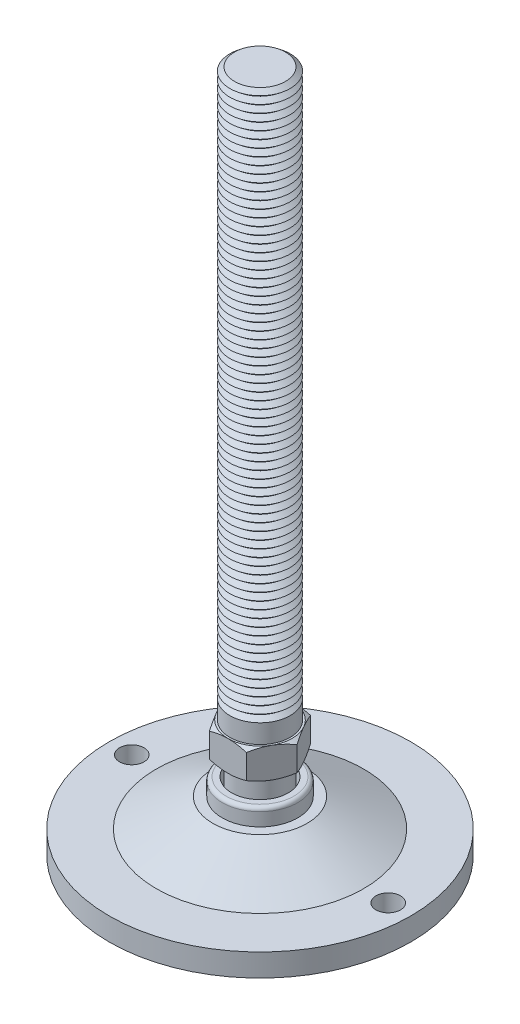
ISO-10303-21;
HEADER;
FILE_DESCRIPTION(('STEP AP214'),'2;1');
FILE_NAME('part.step','',(''),(''),'','','');
FILE_SCHEMA(('AUTOMOTIVE_DESIGN { 1 0 10303 214 1 1 1 1 }'));
ENDSEC;
DATA;
#1=APPLICATION_CONTEXT('core data for automotive mechanical design processes');
#2=APPLICATION_PROTOCOL_DEFINITION('international standard','automotive_design',2000,#1);
#3=PRODUCT_CONTEXT('',#1,'mechanical');
#4=PRODUCT('Part','Part','',(#3));
#5=PRODUCT_RELATED_PRODUCT_CATEGORY('part','',(#4));
#6=PRODUCT_DEFINITION_FORMATION('','',#4);
#7=PRODUCT_DEFINITION_CONTEXT('part definition',#1,'design');
#8=PRODUCT_DEFINITION('design','',#6,#7);
#9=PRODUCT_DEFINITION_SHAPE('','',#8);
#10=(LENGTH_UNIT() NAMED_UNIT(*) SI_UNIT(.MILLI.,.METRE.));
#11=(NAMED_UNIT(*) PLANE_ANGLE_UNIT() SI_UNIT($,.RADIAN.));
#12=(NAMED_UNIT(*) SI_UNIT($,.STERADIAN.) SOLID_ANGLE_UNIT());
#13=UNCERTAINTY_MEASURE_WITH_UNIT(LENGTH_MEASURE(1.E-05),#10,'distance_accuracy_value','');
#14=(GEOMETRIC_REPRESENTATION_CONTEXT(3) GLOBAL_UNCERTAINTY_ASSIGNED_CONTEXT((#13)) GLOBAL_UNIT_ASSIGNED_CONTEXT((#10,
#11,#12)) REPRESENTATION_CONTEXT('',''));
#15=CARTESIAN_POINT('',(0.,0.,0.));
#16=DIRECTION('',(0.,0.,1.));
#17=DIRECTION('',(1.,0.,0.));
#18=AXIS2_PLACEMENT_3D('',#15,#16,#17);
#19=CARTESIAN_POINT('',(0.,173.,0.));
#20=DIRECTION('',(0.,-1.,0.));
#21=DIRECTION('',(0.,0.,-1.));
#22=AXIS2_PLACEMENT_3D('',#19,#20,#21);
#23=CONICAL_SURFACE('',#22,6.75100040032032,0.895664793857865);
#24=CARTESIAN_POINT('',(0.,172.,0.));
#25=DIRECTION('',(0.,-1.,0.));
#26=DIRECTION('',(0.,0.,-1.));
#27=AXIS2_PLACEMENT_3D('',#24,#25,#26);
#28=CIRCLE('',#27,8.);
#29=CARTESIAN_POINT('',(0.,172.,-8.));
#30=VERTEX_POINT('',#29);
#31=EDGE_CURVE('P0_E2366',#30,#30,#28,.T.);
#32=ORIENTED_EDGE('',*,*,#31,.F.);
#33=EDGE_LOOP('',(#32));
#34=FACE_BOUND('',#33,.T.);
#35=CARTESIAN_POINT('',(0.,173.,0.));
#36=DIRECTION('',(0.,-1.,0.));
#37=DIRECTION('',(0.,0.,-1.));
#38=AXIS2_PLACEMENT_3D('',#35,#36,#37);
#39=CIRCLE('',#38,6.75100040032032);
#40=CARTESIAN_POINT('',(0.,173.,-6.75100040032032));
#41=VERTEX_POINT('',#40);
#42=EDGE_CURVE('P0_E2375',#41,#41,#39,.T.);
#43=ORIENTED_EDGE('',*,*,#42,.T.);
#44=EDGE_LOOP('',(#43));
#45=FACE_BOUND('',#44,.T.);
#46=ADVANCED_FACE('P0_F16',(#34,#45),#23,.T.);
#47=CARTESIAN_POINT('',(0.,174.,0.));
#48=DIRECTION('',(0.,1.,0.));
#49=DIRECTION('',(0.,0.,1.));
#50=AXIS2_PLACEMENT_3D('',#47,#48,#49);
#51=CONICAL_SURFACE('',#50,8.,0.895664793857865);
#52=ORIENTED_EDGE('',*,*,#42,.F.);
#53=EDGE_LOOP('',(#52));
#54=FACE_BOUND('',#53,.T.);
#55=CARTESIAN_POINT('',(0.,174.,0.));
#56=DIRECTION('',(0.,-1.,0.));
#57=DIRECTION('',(0.,0.,-1.));
#58=AXIS2_PLACEMENT_3D('',#55,#56,#57);
#59=CIRCLE('',#58,8.);
#60=CARTESIAN_POINT('',(0.,174.,-8.));
#61=VERTEX_POINT('',#60);
#62=EDGE_CURVE('P0_E2372',#61,#61,#59,.T.);
#63=ORIENTED_EDGE('',*,*,#62,.T.);
#64=EDGE_LOOP('',(#63));
#65=FACE_BOUND('',#64,.T.);
#66=ADVANCED_FACE('P0_F308',(#54,#65),#51,.T.);
#67=CARTESIAN_POINT('',(0.,181.,0.));
#68=DIRECTION('',(0.,1.,0.));
#69=DIRECTION('',(0.,0.,1.));
#70=AXIS2_PLACEMENT_3D('',#67,#68,#69);
#71=PLANE('',#70);
#72=CARTESIAN_POINT('',(0.,181.,0.));
#73=DIRECTION('',(0.,-1.,0.));
#74=DIRECTION('',(0.,0.,-1.));
#75=AXIS2_PLACEMENT_3D('',#72,#73,#74);
#76=CIRCLE('',#75,6.75100040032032);
#77=CARTESIAN_POINT('',(0.,181.,-6.75100040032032));
#78=VERTEX_POINT('',#77);
#79=EDGE_CURVE('P0_E143',#78,#78,#76,.T.);
#80=ORIENTED_EDGE('',*,*,#79,.F.);
#81=EDGE_LOOP('',(#80));
#82=FACE_BOUND('',#81,.T.);
#83=ADVANCED_FACE('P0_F314',(#82),#71,.T.);
#84=CARTESIAN_POINT('',(0.,181.,0.));
#85=DIRECTION('',(0.,-1.,0.));
#86=DIRECTION('',(0.,0.,-1.));
#87=AXIS2_PLACEMENT_3D('',#84,#85,#86);
#88=CONICAL_SURFACE('',#87,6.75100040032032,0.895664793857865);
#89=CARTESIAN_POINT('',(0.,180.,0.));
#90=DIRECTION('',(0.,-1.,0.));
#91=DIRECTION('',(0.,0.,-1.));
#92=AXIS2_PLACEMENT_3D('',#89,#90,#91);
#93=CIRCLE('',#92,8.);
#94=CARTESIAN_POINT('',(0.,180.,-8.));
#95=VERTEX_POINT('',#94);
#96=EDGE_CURVE('P0_E353',#95,#95,#93,.T.);
#97=ORIENTED_EDGE('',*,*,#96,.F.);
#98=EDGE_LOOP('',(#97));
#99=FACE_BOUND('',#98,.T.);
#100=ORIENTED_EDGE('',*,*,#79,.T.);
#101=EDGE_LOOP('',(#100));
#102=FACE_BOUND('',#101,.T.);
#103=ADVANCED_FACE('P0_F211',(#99,#102),#88,.T.);
#104=CARTESIAN_POINT('',(0.,180.,0.));
#105=DIRECTION('',(0.,1.,0.));
#106=DIRECTION('',(0.,0.,1.));
#107=AXIS2_PLACEMENT_3D('',#104,#105,#106);
#108=CONICAL_SURFACE('',#107,8.,0.895664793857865);
#109=CARTESIAN_POINT('',(0.,179.,0.));
#110=DIRECTION('',(0.,-1.,0.));
#111=DIRECTION('',(0.,0.,-1.));
#112=AXIS2_PLACEMENT_3D('',#109,#110,#111);
#113=CIRCLE('',#112,6.75100040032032);
#114=CARTESIAN_POINT('',(0.,179.,-6.75100040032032));
#115=VERTEX_POINT('',#114);
#116=EDGE_CURVE('P0_E352',#115,#115,#113,.T.);
#117=ORIENTED_EDGE('',*,*,#116,.F.);
#118=EDGE_LOOP('',(#117));
#119=FACE_BOUND('',#118,.T.);
#120=ORIENTED_EDGE('',*,*,#96,.T.);
#121=EDGE_LOOP('',(#120));
#122=FACE_BOUND('',#121,.T.);
#123=ADVANCED_FACE('P0_F339',(#119,#122),#108,.T.);
#124=CARTESIAN_POINT('',(0.,179.,0.));
#125=DIRECTION('',(0.,-1.,0.));
#126=DIRECTION('',(0.,0.,-1.));
#127=AXIS2_PLACEMENT_3D('',#124,#125,#126);
#128=CONICAL_SURFACE('',#127,6.75100040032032,0.895664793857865);
#129=CARTESIAN_POINT('',(0.,178.,0.));
#130=DIRECTION('',(0.,-1.,0.));
#131=DIRECTION('',(0.,0.,-1.));
#132=AXIS2_PLACEMENT_3D('',#129,#130,#131);
#133=CIRCLE('',#132,8.);
#134=CARTESIAN_POINT('',(0.,178.,-8.));
#135=VERTEX_POINT('',#134);
#136=EDGE_CURVE('P0_E349',#135,#135,#133,.T.);
#137=ORIENTED_EDGE('',*,*,#136,.F.);
#138=EDGE_LOOP('',(#137));
#139=FACE_BOUND('',#138,.T.);
#140=ORIENTED_EDGE('',*,*,#116,.T.);
#141=EDGE_LOOP('',(#140));
#142=FACE_BOUND('',#141,.T.);
#143=ADVANCED_FACE('P0_F334',(#139,#142),#128,.T.);
#144=CARTESIAN_POINT('',(0.,178.,0.));
#145=DIRECTION('',(0.,1.,0.));
#146=DIRECTION('',(0.,0.,1.));
#147=AXIS2_PLACEMENT_3D('',#144,#145,#146);
#148=CONICAL_SURFACE('',#147,8.,0.895664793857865);
#149=CARTESIAN_POINT('',(0.,177.,0.));
#150=DIRECTION('',(0.,-1.,0.));
#151=DIRECTION('',(0.,0.,-1.));
#152=AXIS2_PLACEMENT_3D('',#149,#150,#151);
#153=CIRCLE('',#152,6.75100040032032);
#154=CARTESIAN_POINT('',(0.,177.,-6.75100040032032));
#155=VERTEX_POINT('',#154);
#156=EDGE_CURVE('P0_E358',#155,#155,#153,.T.);
#157=ORIENTED_EDGE('',*,*,#156,.F.);
#158=EDGE_LOOP('',(#157));
#159=FACE_BOUND('',#158,.T.);
#160=ORIENTED_EDGE('',*,*,#136,.T.);
#161=EDGE_LOOP('',(#160));
#162=FACE_BOUND('',#161,.T.);
#163=ADVANCED_FACE('P0_F331',(#159,#162),#148,.T.);
#164=CARTESIAN_POINT('',(0.,177.,0.));
#165=DIRECTION('',(0.,-1.,0.));
#166=DIRECTION('',(0.,0.,-1.));
#167=AXIS2_PLACEMENT_3D('',#164,#165,#166);
#168=CONICAL_SURFACE('',#167,6.75100040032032,0.895664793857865);
#169=CARTESIAN_POINT('',(0.,176.,0.));
#170=DIRECTION('',(0.,-1.,0.));
#171=DIRECTION('',(0.,0.,-1.));
#172=AXIS2_PLACEMENT_3D('',#169,#170,#171);
#173=CIRCLE('',#172,8.);
#174=CARTESIAN_POINT('',(0.,176.,-8.));
#175=VERTEX_POINT('',#174);
#176=EDGE_CURVE('P0_E2378',#175,#175,#173,.T.);
#177=ORIENTED_EDGE('',*,*,#176,.F.);
#178=EDGE_LOOP('',(#177));
#179=FACE_BOUND('',#178,.T.);
#180=ORIENTED_EDGE('',*,*,#156,.T.);
#181=EDGE_LOOP('',(#180));
#182=FACE_BOUND('',#181,.T.);
#183=ADVANCED_FACE('P0_F325',(#179,#182),#168,.T.);
#184=CARTESIAN_POINT('',(0.,176.,0.));
#185=DIRECTION('',(0.,1.,0.));
#186=DIRECTION('',(0.,0.,1.));
#187=AXIS2_PLACEMENT_3D('',#184,#185,#186);
#188=CONICAL_SURFACE('',#187,8.,0.895664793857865);
#189=CARTESIAN_POINT('',(0.,175.,0.));
#190=DIRECTION('',(0.,-1.,0.));
#191=DIRECTION('',(0.,0.,-1.));
#192=AXIS2_PLACEMENT_3D('',#189,#190,#191);
#193=CIRCLE('',#192,6.75100040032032);
#194=CARTESIAN_POINT('',(0.,175.,-6.75100040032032));
#195=VERTEX_POINT('',#194);
#196=EDGE_CURVE('P0_E2381',#195,#195,#193,.T.);
#197=ORIENTED_EDGE('',*,*,#196,.F.);
#198=EDGE_LOOP('',(#197));
#199=FACE_BOUND('',#198,.T.);
#200=ORIENTED_EDGE('',*,*,#176,.T.);
#201=EDGE_LOOP('',(#200));
#202=FACE_BOUND('',#201,.T.);
#203=ADVANCED_FACE('P0_F321',(#199,#202),#188,.T.);
#204=CARTESIAN_POINT('',(0.,175.,0.));
#205=DIRECTION('',(0.,-1.,0.));
#206=DIRECTION('',(0.,0.,-1.));
#207=AXIS2_PLACEMENT_3D('',#204,#205,#206);
#208=CONICAL_SURFACE('',#207,6.75100040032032,0.895664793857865);
#209=ORIENTED_EDGE('',*,*,#62,.F.);
#210=EDGE_LOOP('',(#209));
#211=FACE_BOUND('',#210,.T.);
#212=ORIENTED_EDGE('',*,*,#196,.T.);
#213=EDGE_LOOP('',(#212));
#214=FACE_BOUND('',#213,.T.);
#215=ADVANCED_FACE('P0_F324',(#211,#214),#208,.T.);
#216=CARTESIAN_POINT('',(0.,171.,0.));
#217=DIRECTION('',(0.,-1.,0.));
#218=DIRECTION('',(0.,0.,-1.));
#219=AXIS2_PLACEMENT_3D('',#216,#217,#218);
#220=CONICAL_SURFACE('',#219,6.75100040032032,0.895664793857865);
#221=CARTESIAN_POINT('',(0.,170.,0.));
#222=DIRECTION('',(0.,-1.,0.));
#223=DIRECTION('',(0.,0.,-1.));
#224=AXIS2_PLACEMENT_3D('',#221,#222,#223);
#225=CIRCLE('',#224,8.);
#226=CARTESIAN_POINT('',(0.,170.,-8.));
#227=VERTEX_POINT('',#226);
#228=EDGE_CURVE('P0_E2360',#227,#227,#225,.T.);
#229=ORIENTED_EDGE('',*,*,#228,.F.);
#230=EDGE_LOOP('',(#229));
#231=FACE_BOUND('',#230,.T.);
#232=CARTESIAN_POINT('',(0.,171.,0.));
#233=DIRECTION('',(0.,-1.,0.));
#234=DIRECTION('',(0.,0.,-1.));
#235=AXIS2_PLACEMENT_3D('',#232,#233,#234);
#236=CIRCLE('',#235,6.75100040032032);
#237=CARTESIAN_POINT('',(0.,171.,-6.75100040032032));
#238=VERTEX_POINT('',#237);
#239=EDGE_CURVE('P0_E2369',#238,#238,#236,.T.);
#240=ORIENTED_EDGE('',*,*,#239,.T.);
#241=EDGE_LOOP('',(#240));
#242=FACE_BOUND('',#241,.T.);
#243=ADVANCED_FACE('P0_F329',(#231,#242),#220,.T.);
#244=CARTESIAN_POINT('',(0.,172.,0.));
#245=DIRECTION('',(0.,1.,0.));
#246=DIRECTION('',(0.,0.,1.));
#247=AXIS2_PLACEMENT_3D('',#244,#245,#246);
#248=CONICAL_SURFACE('',#247,8.,0.895664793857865);
#249=ORIENTED_EDGE('',*,*,#239,.F.);
#250=EDGE_LOOP('',(#249));
#251=FACE_BOUND('',#250,.T.);
#252=ORIENTED_EDGE('',*,*,#31,.T.);
#253=EDGE_LOOP('',(#252));
#254=FACE_BOUND('',#253,.T.);
#255=ADVANCED_FACE('P0_F1864',(#251,#254),#248,.T.);
#256=CARTESIAN_POINT('',(0.,169.,0.));
#257=DIRECTION('',(0.,-1.,0.));
#258=DIRECTION('',(0.,0.,-1.));
#259=AXIS2_PLACEMENT_3D('',#256,#257,#258);
#260=CONICAL_SURFACE('',#259,6.75100040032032,0.895664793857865);
#261=CARTESIAN_POINT('',(0.,168.,0.));
#262=DIRECTION('',(0.,-1.,0.));
#263=DIRECTION('',(0.,0.,-1.));
#264=AXIS2_PLACEMENT_3D('',#261,#262,#263);
#265=CIRCLE('',#264,8.);
#266=CARTESIAN_POINT('',(0.,168.,-8.));
#267=VERTEX_POINT('',#266);
#268=EDGE_CURVE('P0_E2354',#267,#267,#265,.T.);
#269=ORIENTED_EDGE('',*,*,#268,.F.);
#270=EDGE_LOOP('',(#269));
#271=FACE_BOUND('',#270,.T.);
#272=CARTESIAN_POINT('',(0.,169.,0.));
#273=DIRECTION('',(0.,-1.,0.));
#274=DIRECTION('',(0.,0.,-1.));
#275=AXIS2_PLACEMENT_3D('',#272,#273,#274);
#276=CIRCLE('',#275,6.75100040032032);
#277=CARTESIAN_POINT('',(0.,169.,-6.75100040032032));
#278=VERTEX_POINT('',#277);
#279=EDGE_CURVE('P0_E2363',#278,#278,#276,.T.);
#280=ORIENTED_EDGE('',*,*,#279,.T.);
#281=EDGE_LOOP('',(#280));
#282=FACE_BOUND('',#281,.T.);
#283=ADVANCED_FACE('P0_F1854',(#271,#282),#260,.T.);
#284=CARTESIAN_POINT('',(0.,170.,0.));
#285=DIRECTION('',(0.,1.,0.));
#286=DIRECTION('',(0.,0.,1.));
#287=AXIS2_PLACEMENT_3D('',#284,#285,#286);
#288=CONICAL_SURFACE('',#287,8.,0.895664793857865);
#289=ORIENTED_EDGE('',*,*,#279,.F.);
#290=EDGE_LOOP('',(#289));
#291=FACE_BOUND('',#290,.T.);
#292=ORIENTED_EDGE('',*,*,#228,.T.);
#293=EDGE_LOOP('',(#292));
#294=FACE_BOUND('',#293,.T.);
#295=ADVANCED_FACE('P0_F1844',(#291,#294),#288,.T.);
#296=CARTESIAN_POINT('',(0.,167.,0.));
#297=DIRECTION('',(0.,-1.,0.));
#298=DIRECTION('',(0.,0.,-1.));
#299=AXIS2_PLACEMENT_3D('',#296,#297,#298);
#300=CONICAL_SURFACE('',#299,6.75100040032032,0.895664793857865);
#301=CARTESIAN_POINT('',(0.,166.,0.));
#302=DIRECTION('',(0.,-1.,0.));
#303=DIRECTION('',(0.,0.,-1.));
#304=AXIS2_PLACEMENT_3D('',#301,#302,#303);
#305=CIRCLE('',#304,8.);
#306=CARTESIAN_POINT('',(0.,166.,-8.));
#307=VERTEX_POINT('',#306);
#308=EDGE_CURVE('P0_E2348',#307,#307,#305,.T.);
#309=ORIENTED_EDGE('',*,*,#308,.F.);
#310=EDGE_LOOP('',(#309));
#311=FACE_BOUND('',#310,.T.);
#312=CARTESIAN_POINT('',(0.,167.,0.));
#313=DIRECTION('',(0.,-1.,0.));
#314=DIRECTION('',(0.,0.,-1.));
#315=AXIS2_PLACEMENT_3D('',#312,#313,#314);
#316=CIRCLE('',#315,6.75100040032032);
#317=CARTESIAN_POINT('',(0.,167.,-6.75100040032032));
#318=VERTEX_POINT('',#317);
#319=EDGE_CURVE('P0_E2357',#318,#318,#316,.T.);
#320=ORIENTED_EDGE('',*,*,#319,.T.);
#321=EDGE_LOOP('',(#320));
#322=FACE_BOUND('',#321,.T.);
#323=ADVANCED_FACE('P0_F1834',(#311,#322),#300,.T.);
#324=CARTESIAN_POINT('',(0.,168.,0.));
#325=DIRECTION('',(0.,1.,0.));
#326=DIRECTION('',(0.,0.,1.));
#327=AXIS2_PLACEMENT_3D('',#324,#325,#326);
#328=CONICAL_SURFACE('',#327,8.,0.895664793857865);
#329=ORIENTED_EDGE('',*,*,#319,.F.);
#330=EDGE_LOOP('',(#329));
#331=FACE_BOUND('',#330,.T.);
#332=ORIENTED_EDGE('',*,*,#268,.T.);
#333=EDGE_LOOP('',(#332));
#334=FACE_BOUND('',#333,.T.);
#335=ADVANCED_FACE('P0_F1824',(#331,#334),#328,.T.);
#336=CARTESIAN_POINT('',(0.,165.,0.));
#337=DIRECTION('',(0.,-1.,0.));
#338=DIRECTION('',(0.,0.,-1.));
#339=AXIS2_PLACEMENT_3D('',#336,#337,#338);
#340=CONICAL_SURFACE('',#339,6.75100040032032,0.895664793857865);
#341=CARTESIAN_POINT('',(0.,164.,0.));
#342=DIRECTION('',(0.,-1.,0.));
#343=DIRECTION('',(0.,0.,-1.));
#344=AXIS2_PLACEMENT_3D('',#341,#342,#343);
#345=CIRCLE('',#344,8.);
#346=CARTESIAN_POINT('',(0.,164.,-8.));
#347=VERTEX_POINT('',#346);
#348=EDGE_CURVE('P0_E2342',#347,#347,#345,.T.);
#349=ORIENTED_EDGE('',*,*,#348,.F.);
#350=EDGE_LOOP('',(#349));
#351=FACE_BOUND('',#350,.T.);
#352=CARTESIAN_POINT('',(0.,165.,0.));
#353=DIRECTION('',(0.,-1.,0.));
#354=DIRECTION('',(0.,0.,-1.));
#355=AXIS2_PLACEMENT_3D('',#352,#353,#354);
#356=CIRCLE('',#355,6.75100040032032);
#357=CARTESIAN_POINT('',(0.,165.,-6.75100040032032));
#358=VERTEX_POINT('',#357);
#359=EDGE_CURVE('P0_E2351',#358,#358,#356,.T.);
#360=ORIENTED_EDGE('',*,*,#359,.T.);
#361=EDGE_LOOP('',(#360));
#362=FACE_BOUND('',#361,.T.);
#363=ADVANCED_FACE('P0_F1814',(#351,#362),#340,.T.);
#364=CARTESIAN_POINT('',(0.,166.,0.));
#365=DIRECTION('',(0.,1.,0.));
#366=DIRECTION('',(0.,0.,1.));
#367=AXIS2_PLACEMENT_3D('',#364,#365,#366);
#368=CONICAL_SURFACE('',#367,8.,0.895664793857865);
#369=ORIENTED_EDGE('',*,*,#359,.F.);
#370=EDGE_LOOP('',(#369));
#371=FACE_BOUND('',#370,.T.);
#372=ORIENTED_EDGE('',*,*,#308,.T.);
#373=EDGE_LOOP('',(#372));
#374=FACE_BOUND('',#373,.T.);
#375=ADVANCED_FACE('P0_F1804',(#371,#374),#368,.T.);
#376=CARTESIAN_POINT('',(0.,163.,0.));
#377=DIRECTION('',(0.,-1.,0.));
#378=DIRECTION('',(0.,0.,-1.));
#379=AXIS2_PLACEMENT_3D('',#376,#377,#378);
#380=CONICAL_SURFACE('',#379,6.75100040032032,0.895664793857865);
#381=CARTESIAN_POINT('',(0.,162.,0.));
#382=DIRECTION('',(0.,-1.,0.));
#383=DIRECTION('',(0.,0.,-1.));
#384=AXIS2_PLACEMENT_3D('',#381,#382,#383);
#385=CIRCLE('',#384,8.);
#386=CARTESIAN_POINT('',(0.,162.,-8.));
#387=VERTEX_POINT('',#386);
#388=EDGE_CURVE('P0_E2336',#387,#387,#385,.T.);
#389=ORIENTED_EDGE('',*,*,#388,.F.);
#390=EDGE_LOOP('',(#389));
#391=FACE_BOUND('',#390,.T.);
#392=CARTESIAN_POINT('',(0.,163.,0.));
#393=DIRECTION('',(0.,-1.,0.));
#394=DIRECTION('',(0.,0.,-1.));
#395=AXIS2_PLACEMENT_3D('',#392,#393,#394);
#396=CIRCLE('',#395,6.75100040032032);
#397=CARTESIAN_POINT('',(0.,163.,-6.75100040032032));
#398=VERTEX_POINT('',#397);
#399=EDGE_CURVE('P0_E2345',#398,#398,#396,.T.);
#400=ORIENTED_EDGE('',*,*,#399,.T.);
#401=EDGE_LOOP('',(#400));
#402=FACE_BOUND('',#401,.T.);
#403=ADVANCED_FACE('P0_F1794',(#391,#402),#380,.T.);
#404=CARTESIAN_POINT('',(0.,164.,0.));
#405=DIRECTION('',(0.,1.,0.));
#406=DIRECTION('',(0.,0.,1.));
#407=AXIS2_PLACEMENT_3D('',#404,#405,#406);
#408=CONICAL_SURFACE('',#407,8.,0.895664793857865);
#409=ORIENTED_EDGE('',*,*,#399,.F.);
#410=EDGE_LOOP('',(#409));
#411=FACE_BOUND('',#410,.T.);
#412=ORIENTED_EDGE('',*,*,#348,.T.);
#413=EDGE_LOOP('',(#412));
#414=FACE_BOUND('',#413,.T.);
#415=ADVANCED_FACE('P0_F1784',(#411,#414),#408,.T.);
#416=CARTESIAN_POINT('',(0.,161.,0.));
#417=DIRECTION('',(0.,-1.,0.));
#418=DIRECTION('',(0.,0.,-1.));
#419=AXIS2_PLACEMENT_3D('',#416,#417,#418);
#420=CONICAL_SURFACE('',#419,6.75100040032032,0.895664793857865);
#421=CARTESIAN_POINT('',(0.,160.,0.));
#422=DIRECTION('',(0.,-1.,0.));
#423=DIRECTION('',(0.,0.,-1.));
#424=AXIS2_PLACEMENT_3D('',#421,#422,#423);
#425=CIRCLE('',#424,8.);
#426=CARTESIAN_POINT('',(0.,160.,-8.));
#427=VERTEX_POINT('',#426);
#428=EDGE_CURVE('P0_E2330',#427,#427,#425,.T.);
#429=ORIENTED_EDGE('',*,*,#428,.F.);
#430=EDGE_LOOP('',(#429));
#431=FACE_BOUND('',#430,.T.);
#432=CARTESIAN_POINT('',(0.,161.,0.));
#433=DIRECTION('',(0.,-1.,0.));
#434=DIRECTION('',(0.,0.,-1.));
#435=AXIS2_PLACEMENT_3D('',#432,#433,#434);
#436=CIRCLE('',#435,6.75100040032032);
#437=CARTESIAN_POINT('',(0.,161.,-6.75100040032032));
#438=VERTEX_POINT('',#437);
#439=EDGE_CURVE('P0_E2339',#438,#438,#436,.T.);
#440=ORIENTED_EDGE('',*,*,#439,.T.);
#441=EDGE_LOOP('',(#440));
#442=FACE_BOUND('',#441,.T.);
#443=ADVANCED_FACE('P0_F1774',(#431,#442),#420,.T.);
#444=CARTESIAN_POINT('',(0.,162.,0.));
#445=DIRECTION('',(0.,1.,0.));
#446=DIRECTION('',(0.,0.,1.));
#447=AXIS2_PLACEMENT_3D('',#444,#445,#446);
#448=CONICAL_SURFACE('',#447,8.,0.895664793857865);
#449=ORIENTED_EDGE('',*,*,#439,.F.);
#450=EDGE_LOOP('',(#449));
#451=FACE_BOUND('',#450,.T.);
#452=ORIENTED_EDGE('',*,*,#388,.T.);
#453=EDGE_LOOP('',(#452));
#454=FACE_BOUND('',#453,.T.);
#455=ADVANCED_FACE('P0_F1764',(#451,#454),#448,.T.);
#456=CARTESIAN_POINT('',(0.,159.,0.));
#457=DIRECTION('',(0.,-1.,0.));
#458=DIRECTION('',(0.,0.,-1.));
#459=AXIS2_PLACEMENT_3D('',#456,#457,#458);
#460=CONICAL_SURFACE('',#459,6.75100040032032,0.895664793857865);
#461=CARTESIAN_POINT('',(0.,158.,0.));
#462=DIRECTION('',(0.,-1.,0.));
#463=DIRECTION('',(0.,0.,-1.));
#464=AXIS2_PLACEMENT_3D('',#461,#462,#463);
#465=CIRCLE('',#464,8.);
#466=CARTESIAN_POINT('',(0.,158.,-8.));
#467=VERTEX_POINT('',#466);
#468=EDGE_CURVE('P0_E2324',#467,#467,#465,.T.);
#469=ORIENTED_EDGE('',*,*,#468,.F.);
#470=EDGE_LOOP('',(#469));
#471=FACE_BOUND('',#470,.T.);
#472=CARTESIAN_POINT('',(0.,159.,0.));
#473=DIRECTION('',(0.,-1.,0.));
#474=DIRECTION('',(0.,0.,-1.));
#475=AXIS2_PLACEMENT_3D('',#472,#473,#474);
#476=CIRCLE('',#475,6.75100040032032);
#477=CARTESIAN_POINT('',(0.,159.,-6.75100040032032));
#478=VERTEX_POINT('',#477);
#479=EDGE_CURVE('P0_E2333',#478,#478,#476,.T.);
#480=ORIENTED_EDGE('',*,*,#479,.T.);
#481=EDGE_LOOP('',(#480));
#482=FACE_BOUND('',#481,.T.);
#483=ADVANCED_FACE('P0_F1754',(#471,#482),#460,.T.);
#484=CARTESIAN_POINT('',(0.,160.,0.));
#485=DIRECTION('',(0.,1.,0.));
#486=DIRECTION('',(0.,0.,1.));
#487=AXIS2_PLACEMENT_3D('',#484,#485,#486);
#488=CONICAL_SURFACE('',#487,8.,0.895664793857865);
#489=ORIENTED_EDGE('',*,*,#479,.F.);
#490=EDGE_LOOP('',(#489));
#491=FACE_BOUND('',#490,.T.);
#492=ORIENTED_EDGE('',*,*,#428,.T.);
#493=EDGE_LOOP('',(#492));
#494=FACE_BOUND('',#493,.T.);
#495=ADVANCED_FACE('P0_F1744',(#491,#494),#488,.T.);
#496=CARTESIAN_POINT('',(0.,157.,0.));
#497=DIRECTION('',(0.,-1.,0.));
#498=DIRECTION('',(0.,0.,-1.));
#499=AXIS2_PLACEMENT_3D('',#496,#497,#498);
#500=CONICAL_SURFACE('',#499,6.75100040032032,0.895664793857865);
#501=CARTESIAN_POINT('',(0.,156.,0.));
#502=DIRECTION('',(0.,-1.,0.));
#503=DIRECTION('',(0.,0.,-1.));
#504=AXIS2_PLACEMENT_3D('',#501,#502,#503);
#505=CIRCLE('',#504,8.);
#506=CARTESIAN_POINT('',(0.,156.,-8.));
#507=VERTEX_POINT('',#506);
#508=EDGE_CURVE('P0_E2318',#507,#507,#505,.T.);
#509=ORIENTED_EDGE('',*,*,#508,.F.);
#510=EDGE_LOOP('',(#509));
#511=FACE_BOUND('',#510,.T.);
#512=CARTESIAN_POINT('',(0.,157.,0.));
#513=DIRECTION('',(0.,-1.,0.));
#514=DIRECTION('',(0.,0.,-1.));
#515=AXIS2_PLACEMENT_3D('',#512,#513,#514);
#516=CIRCLE('',#515,6.75100040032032);
#517=CARTESIAN_POINT('',(0.,157.,-6.75100040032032));
#518=VERTEX_POINT('',#517);
#519=EDGE_CURVE('P0_E2327',#518,#518,#516,.T.);
#520=ORIENTED_EDGE('',*,*,#519,.T.);
#521=EDGE_LOOP('',(#520));
#522=FACE_BOUND('',#521,.T.);
#523=ADVANCED_FACE('P0_F1734',(#511,#522),#500,.T.);
#524=CARTESIAN_POINT('',(0.,158.,0.));
#525=DIRECTION('',(0.,1.,0.));
#526=DIRECTION('',(0.,0.,1.));
#527=AXIS2_PLACEMENT_3D('',#524,#525,#526);
#528=CONICAL_SURFACE('',#527,8.,0.895664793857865);
#529=ORIENTED_EDGE('',*,*,#519,.F.);
#530=EDGE_LOOP('',(#529));
#531=FACE_BOUND('',#530,.T.);
#532=ORIENTED_EDGE('',*,*,#468,.T.);
#533=EDGE_LOOP('',(#532));
#534=FACE_BOUND('',#533,.T.);
#535=ADVANCED_FACE('P0_F1724',(#531,#534),#528,.T.);
#536=CARTESIAN_POINT('',(0.,155.,0.));
#537=DIRECTION('',(0.,-1.,0.));
#538=DIRECTION('',(0.,0.,-1.));
#539=AXIS2_PLACEMENT_3D('',#536,#537,#538);
#540=CONICAL_SURFACE('',#539,6.75100040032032,0.895664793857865);
#541=CARTESIAN_POINT('',(0.,154.,0.));
#542=DIRECTION('',(0.,-1.,0.));
#543=DIRECTION('',(0.,0.,-1.));
#544=AXIS2_PLACEMENT_3D('',#541,#542,#543);
#545=CIRCLE('',#544,8.);
#546=CARTESIAN_POINT('',(0.,154.,-8.));
#547=VERTEX_POINT('',#546);
#548=EDGE_CURVE('P0_E2312',#547,#547,#545,.T.);
#549=ORIENTED_EDGE('',*,*,#548,.F.);
#550=EDGE_LOOP('',(#549));
#551=FACE_BOUND('',#550,.T.);
#552=CARTESIAN_POINT('',(0.,155.,0.));
#553=DIRECTION('',(0.,-1.,0.));
#554=DIRECTION('',(0.,0.,-1.));
#555=AXIS2_PLACEMENT_3D('',#552,#553,#554);
#556=CIRCLE('',#555,6.75100040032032);
#557=CARTESIAN_POINT('',(0.,155.,-6.75100040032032));
#558=VERTEX_POINT('',#557);
#559=EDGE_CURVE('P0_E2321',#558,#558,#556,.T.);
#560=ORIENTED_EDGE('',*,*,#559,.T.);
#561=EDGE_LOOP('',(#560));
#562=FACE_BOUND('',#561,.T.);
#563=ADVANCED_FACE('P0_F1714',(#551,#562),#540,.T.);
#564=CARTESIAN_POINT('',(0.,156.,0.));
#565=DIRECTION('',(0.,1.,0.));
#566=DIRECTION('',(0.,0.,1.));
#567=AXIS2_PLACEMENT_3D('',#564,#565,#566);
#568=CONICAL_SURFACE('',#567,8.,0.895664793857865);
#569=ORIENTED_EDGE('',*,*,#559,.F.);
#570=EDGE_LOOP('',(#569));
#571=FACE_BOUND('',#570,.T.);
#572=ORIENTED_EDGE('',*,*,#508,.T.);
#573=EDGE_LOOP('',(#572));
#574=FACE_BOUND('',#573,.T.);
#575=ADVANCED_FACE('P0_F1704',(#571,#574),#568,.T.);
#576=CARTESIAN_POINT('',(0.,153.,0.));
#577=DIRECTION('',(0.,-1.,0.));
#578=DIRECTION('',(0.,0.,-1.));
#579=AXIS2_PLACEMENT_3D('',#576,#577,#578);
#580=CONICAL_SURFACE('',#579,6.75100040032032,0.895664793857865);
#581=CARTESIAN_POINT('',(0.,152.,0.));
#582=DIRECTION('',(0.,-1.,0.));
#583=DIRECTION('',(0.,0.,-1.));
#584=AXIS2_PLACEMENT_3D('',#581,#582,#583);
#585=CIRCLE('',#584,8.);
#586=CARTESIAN_POINT('',(0.,152.,-8.));
#587=VERTEX_POINT('',#586);
#588=EDGE_CURVE('P0_E2306',#587,#587,#585,.T.);
#589=ORIENTED_EDGE('',*,*,#588,.F.);
#590=EDGE_LOOP('',(#589));
#591=FACE_BOUND('',#590,.T.);
#592=CARTESIAN_POINT('',(0.,153.,0.));
#593=DIRECTION('',(0.,-1.,0.));
#594=DIRECTION('',(0.,0.,-1.));
#595=AXIS2_PLACEMENT_3D('',#592,#593,#594);
#596=CIRCLE('',#595,6.75100040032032);
#597=CARTESIAN_POINT('',(0.,153.,-6.75100040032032));
#598=VERTEX_POINT('',#597);
#599=EDGE_CURVE('P0_E2315',#598,#598,#596,.T.);
#600=ORIENTED_EDGE('',*,*,#599,.T.);
#601=EDGE_LOOP('',(#600));
#602=FACE_BOUND('',#601,.T.);
#603=ADVANCED_FACE('P0_F1694',(#591,#602),#580,.T.);
#604=CARTESIAN_POINT('',(0.,154.,0.));
#605=DIRECTION('',(0.,1.,0.));
#606=DIRECTION('',(0.,0.,1.));
#607=AXIS2_PLACEMENT_3D('',#604,#605,#606);
#608=CONICAL_SURFACE('',#607,8.,0.895664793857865);
#609=ORIENTED_EDGE('',*,*,#599,.F.);
#610=EDGE_LOOP('',(#609));
#611=FACE_BOUND('',#610,.T.);
#612=ORIENTED_EDGE('',*,*,#548,.T.);
#613=EDGE_LOOP('',(#612));
#614=FACE_BOUND('',#613,.T.);
#615=ADVANCED_FACE('P0_F1684',(#611,#614),#608,.T.);
#616=CARTESIAN_POINT('',(0.,151.,0.));
#617=DIRECTION('',(0.,-1.,0.));
#618=DIRECTION('',(0.,0.,-1.));
#619=AXIS2_PLACEMENT_3D('',#616,#617,#618);
#620=CONICAL_SURFACE('',#619,6.75100040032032,0.895664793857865);
#621=CARTESIAN_POINT('',(0.,150.,0.));
#622=DIRECTION('',(0.,-1.,0.));
#623=DIRECTION('',(0.,0.,-1.));
#624=AXIS2_PLACEMENT_3D('',#621,#622,#623);
#625=CIRCLE('',#624,8.);
#626=CARTESIAN_POINT('',(0.,150.,-8.));
#627=VERTEX_POINT('',#626);
#628=EDGE_CURVE('P0_E2300',#627,#627,#625,.T.);
#629=ORIENTED_EDGE('',*,*,#628,.F.);
#630=EDGE_LOOP('',(#629));
#631=FACE_BOUND('',#630,.T.);
#632=CARTESIAN_POINT('',(0.,151.,0.));
#633=DIRECTION('',(0.,-1.,0.));
#634=DIRECTION('',(0.,0.,-1.));
#635=AXIS2_PLACEMENT_3D('',#632,#633,#634);
#636=CIRCLE('',#635,6.75100040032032);
#637=CARTESIAN_POINT('',(0.,151.,-6.75100040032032));
#638=VERTEX_POINT('',#637);
#639=EDGE_CURVE('P0_E2309',#638,#638,#636,.T.);
#640=ORIENTED_EDGE('',*,*,#639,.T.);
#641=EDGE_LOOP('',(#640));
#642=FACE_BOUND('',#641,.T.);
#643=ADVANCED_FACE('P0_F1674',(#631,#642),#620,.T.);
#644=CARTESIAN_POINT('',(0.,152.,0.));
#645=DIRECTION('',(0.,1.,0.));
#646=DIRECTION('',(0.,0.,1.));
#647=AXIS2_PLACEMENT_3D('',#644,#645,#646);
#648=CONICAL_SURFACE('',#647,8.,0.895664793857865);
#649=ORIENTED_EDGE('',*,*,#639,.F.);
#650=EDGE_LOOP('',(#649));
#651=FACE_BOUND('',#650,.T.);
#652=ORIENTED_EDGE('',*,*,#588,.T.);
#653=EDGE_LOOP('',(#652));
#654=FACE_BOUND('',#653,.T.);
#655=ADVANCED_FACE('P0_F1664',(#651,#654),#648,.T.);
#656=CARTESIAN_POINT('',(0.,149.,0.));
#657=DIRECTION('',(0.,-1.,0.));
#658=DIRECTION('',(0.,0.,-1.));
#659=AXIS2_PLACEMENT_3D('',#656,#657,#658);
#660=CONICAL_SURFACE('',#659,6.75100040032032,0.895664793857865);
#661=CARTESIAN_POINT('',(0.,148.,0.));
#662=DIRECTION('',(0.,-1.,0.));
#663=DIRECTION('',(0.,0.,-1.));
#664=AXIS2_PLACEMENT_3D('',#661,#662,#663);
#665=CIRCLE('',#664,8.);
#666=CARTESIAN_POINT('',(0.,148.,-8.));
#667=VERTEX_POINT('',#666);
#668=EDGE_CURVE('P0_E2294',#667,#667,#665,.T.);
#669=ORIENTED_EDGE('',*,*,#668,.F.);
#670=EDGE_LOOP('',(#669));
#671=FACE_BOUND('',#670,.T.);
#672=CARTESIAN_POINT('',(0.,149.,0.));
#673=DIRECTION('',(0.,-1.,0.));
#674=DIRECTION('',(0.,0.,-1.));
#675=AXIS2_PLACEMENT_3D('',#672,#673,#674);
#676=CIRCLE('',#675,6.75100040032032);
#677=CARTESIAN_POINT('',(0.,149.,-6.75100040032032));
#678=VERTEX_POINT('',#677);
#679=EDGE_CURVE('P0_E2303',#678,#678,#676,.T.);
#680=ORIENTED_EDGE('',*,*,#679,.T.);
#681=EDGE_LOOP('',(#680));
#682=FACE_BOUND('',#681,.T.);
#683=ADVANCED_FACE('P0_F1654',(#671,#682),#660,.T.);
#684=CARTESIAN_POINT('',(0.,150.,0.));
#685=DIRECTION('',(0.,1.,0.));
#686=DIRECTION('',(0.,0.,1.));
#687=AXIS2_PLACEMENT_3D('',#684,#685,#686);
#688=CONICAL_SURFACE('',#687,8.,0.895664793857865);
#689=ORIENTED_EDGE('',*,*,#679,.F.);
#690=EDGE_LOOP('',(#689));
#691=FACE_BOUND('',#690,.T.);
#692=ORIENTED_EDGE('',*,*,#628,.T.);
#693=EDGE_LOOP('',(#692));
#694=FACE_BOUND('',#693,.T.);
#695=ADVANCED_FACE('P0_F1644',(#691,#694),#688,.T.);
#696=CARTESIAN_POINT('',(0.,147.,0.));
#697=DIRECTION('',(0.,-1.,0.));
#698=DIRECTION('',(0.,0.,-1.));
#699=AXIS2_PLACEMENT_3D('',#696,#697,#698);
#700=CONICAL_SURFACE('',#699,6.75100040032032,0.895664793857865);
#701=CARTESIAN_POINT('',(0.,146.,0.));
#702=DIRECTION('',(0.,-1.,0.));
#703=DIRECTION('',(0.,0.,-1.));
#704=AXIS2_PLACEMENT_3D('',#701,#702,#703);
#705=CIRCLE('',#704,8.);
#706=CARTESIAN_POINT('',(0.,146.,-8.));
#707=VERTEX_POINT('',#706);
#708=EDGE_CURVE('P0_E2288',#707,#707,#705,.T.);
#709=ORIENTED_EDGE('',*,*,#708,.F.);
#710=EDGE_LOOP('',(#709));
#711=FACE_BOUND('',#710,.T.);
#712=CARTESIAN_POINT('',(0.,147.,0.));
#713=DIRECTION('',(0.,-1.,0.));
#714=DIRECTION('',(0.,0.,-1.));
#715=AXIS2_PLACEMENT_3D('',#712,#713,#714);
#716=CIRCLE('',#715,6.75100040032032);
#717=CARTESIAN_POINT('',(0.,147.,-6.75100040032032));
#718=VERTEX_POINT('',#717);
#719=EDGE_CURVE('P0_E2297',#718,#718,#716,.T.);
#720=ORIENTED_EDGE('',*,*,#719,.T.);
#721=EDGE_LOOP('',(#720));
#722=FACE_BOUND('',#721,.T.);
#723=ADVANCED_FACE('P0_F1634',(#711,#722),#700,.T.);
#724=CARTESIAN_POINT('',(0.,148.,0.));
#725=DIRECTION('',(0.,1.,0.));
#726=DIRECTION('',(0.,0.,1.));
#727=AXIS2_PLACEMENT_3D('',#724,#725,#726);
#728=CONICAL_SURFACE('',#727,8.,0.895664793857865);
#729=ORIENTED_EDGE('',*,*,#719,.F.);
#730=EDGE_LOOP('',(#729));
#731=FACE_BOUND('',#730,.T.);
#732=ORIENTED_EDGE('',*,*,#668,.T.);
#733=EDGE_LOOP('',(#732));
#734=FACE_BOUND('',#733,.T.);
#735=ADVANCED_FACE('P0_F1624',(#731,#734),#728,.T.);
#736=CARTESIAN_POINT('',(0.,145.,0.));
#737=DIRECTION('',(0.,-1.,0.));
#738=DIRECTION('',(0.,0.,-1.));
#739=AXIS2_PLACEMENT_3D('',#736,#737,#738);
#740=CONICAL_SURFACE('',#739,6.75100040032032,0.895664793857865);
#741=CARTESIAN_POINT('',(0.,144.,0.));
#742=DIRECTION('',(0.,-1.,0.));
#743=DIRECTION('',(0.,0.,-1.));
#744=AXIS2_PLACEMENT_3D('',#741,#742,#743);
#745=CIRCLE('',#744,8.);
#746=CARTESIAN_POINT('',(0.,144.,-8.));
#747=VERTEX_POINT('',#746);
#748=EDGE_CURVE('P0_E2282',#747,#747,#745,.T.);
#749=ORIENTED_EDGE('',*,*,#748,.F.);
#750=EDGE_LOOP('',(#749));
#751=FACE_BOUND('',#750,.T.);
#752=CARTESIAN_POINT('',(0.,145.,0.));
#753=DIRECTION('',(0.,-1.,0.));
#754=DIRECTION('',(0.,0.,-1.));
#755=AXIS2_PLACEMENT_3D('',#752,#753,#754);
#756=CIRCLE('',#755,6.75100040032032);
#757=CARTESIAN_POINT('',(0.,145.,-6.75100040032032));
#758=VERTEX_POINT('',#757);
#759=EDGE_CURVE('P0_E2291',#758,#758,#756,.T.);
#760=ORIENTED_EDGE('',*,*,#759,.T.);
#761=EDGE_LOOP('',(#760));
#762=FACE_BOUND('',#761,.T.);
#763=ADVANCED_FACE('P0_F1614',(#751,#762),#740,.T.);
#764=CARTESIAN_POINT('',(0.,146.,0.));
#765=DIRECTION('',(0.,1.,0.));
#766=DIRECTION('',(0.,0.,1.));
#767=AXIS2_PLACEMENT_3D('',#764,#765,#766);
#768=CONICAL_SURFACE('',#767,8.,0.895664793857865);
#769=ORIENTED_EDGE('',*,*,#759,.F.);
#770=EDGE_LOOP('',(#769));
#771=FACE_BOUND('',#770,.T.);
#772=ORIENTED_EDGE('',*,*,#708,.T.);
#773=EDGE_LOOP('',(#772));
#774=FACE_BOUND('',#773,.T.);
#775=ADVANCED_FACE('P0_F1604',(#771,#774),#768,.T.);
#776=CARTESIAN_POINT('',(0.,143.,0.));
#777=DIRECTION('',(0.,-1.,0.));
#778=DIRECTION('',(0.,0.,-1.));
#779=AXIS2_PLACEMENT_3D('',#776,#777,#778);
#780=CONICAL_SURFACE('',#779,6.75100040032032,0.895664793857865);
#781=CARTESIAN_POINT('',(0.,142.,0.));
#782=DIRECTION('',(0.,-1.,0.));
#783=DIRECTION('',(0.,0.,-1.));
#784=AXIS2_PLACEMENT_3D('',#781,#782,#783);
#785=CIRCLE('',#784,8.);
#786=CARTESIAN_POINT('',(0.,142.,-8.));
#787=VERTEX_POINT('',#786);
#788=EDGE_CURVE('P0_E2276',#787,#787,#785,.T.);
#789=ORIENTED_EDGE('',*,*,#788,.F.);
#790=EDGE_LOOP('',(#789));
#791=FACE_BOUND('',#790,.T.);
#792=CARTESIAN_POINT('',(0.,143.,0.));
#793=DIRECTION('',(0.,-1.,0.));
#794=DIRECTION('',(0.,0.,-1.));
#795=AXIS2_PLACEMENT_3D('',#792,#793,#794);
#796=CIRCLE('',#795,6.75100040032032);
#797=CARTESIAN_POINT('',(0.,143.,-6.75100040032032));
#798=VERTEX_POINT('',#797);
#799=EDGE_CURVE('P0_E2285',#798,#798,#796,.T.);
#800=ORIENTED_EDGE('',*,*,#799,.T.);
#801=EDGE_LOOP('',(#800));
#802=FACE_BOUND('',#801,.T.);
#803=ADVANCED_FACE('P0_F1594',(#791,#802),#780,.T.);
#804=CARTESIAN_POINT('',(0.,144.,0.));
#805=DIRECTION('',(0.,1.,0.));
#806=DIRECTION('',(0.,0.,1.));
#807=AXIS2_PLACEMENT_3D('',#804,#805,#806);
#808=CONICAL_SURFACE('',#807,8.,0.895664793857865);
#809=ORIENTED_EDGE('',*,*,#799,.F.);
#810=EDGE_LOOP('',(#809));
#811=FACE_BOUND('',#810,.T.);
#812=ORIENTED_EDGE('',*,*,#748,.T.);
#813=EDGE_LOOP('',(#812));
#814=FACE_BOUND('',#813,.T.);
#815=ADVANCED_FACE('P0_F1584',(#811,#814),#808,.T.);
#816=CARTESIAN_POINT('',(0.,141.,0.));
#817=DIRECTION('',(0.,-1.,0.));
#818=DIRECTION('',(0.,0.,-1.));
#819=AXIS2_PLACEMENT_3D('',#816,#817,#818);
#820=CONICAL_SURFACE('',#819,6.75100040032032,0.895664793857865);
#821=CARTESIAN_POINT('',(0.,140.,0.));
#822=DIRECTION('',(0.,-1.,0.));
#823=DIRECTION('',(0.,0.,-1.));
#824=AXIS2_PLACEMENT_3D('',#821,#822,#823);
#825=CIRCLE('',#824,8.);
#826=CARTESIAN_POINT('',(0.,140.,-8.));
#827=VERTEX_POINT('',#826);
#828=EDGE_CURVE('P0_E2270',#827,#827,#825,.T.);
#829=ORIENTED_EDGE('',*,*,#828,.F.);
#830=EDGE_LOOP('',(#829));
#831=FACE_BOUND('',#830,.T.);
#832=CARTESIAN_POINT('',(0.,141.,0.));
#833=DIRECTION('',(0.,-1.,0.));
#834=DIRECTION('',(0.,0.,-1.));
#835=AXIS2_PLACEMENT_3D('',#832,#833,#834);
#836=CIRCLE('',#835,6.75100040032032);
#837=CARTESIAN_POINT('',(0.,141.,-6.75100040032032));
#838=VERTEX_POINT('',#837);
#839=EDGE_CURVE('P0_E2279',#838,#838,#836,.T.);
#840=ORIENTED_EDGE('',*,*,#839,.T.);
#841=EDGE_LOOP('',(#840));
#842=FACE_BOUND('',#841,.T.);
#843=ADVANCED_FACE('P0_F1574',(#831,#842),#820,.T.);
#844=CARTESIAN_POINT('',(0.,142.,0.));
#845=DIRECTION('',(0.,1.,0.));
#846=DIRECTION('',(0.,0.,1.));
#847=AXIS2_PLACEMENT_3D('',#844,#845,#846);
#848=CONICAL_SURFACE('',#847,8.,0.895664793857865);
#849=ORIENTED_EDGE('',*,*,#839,.F.);
#850=EDGE_LOOP('',(#849));
#851=FACE_BOUND('',#850,.T.);
#852=ORIENTED_EDGE('',*,*,#788,.T.);
#853=EDGE_LOOP('',(#852));
#854=FACE_BOUND('',#853,.T.);
#855=ADVANCED_FACE('P0_F1564',(#851,#854),#848,.T.);
#856=CARTESIAN_POINT('',(0.,139.,0.));
#857=DIRECTION('',(0.,-1.,0.));
#858=DIRECTION('',(0.,0.,-1.));
#859=AXIS2_PLACEMENT_3D('',#856,#857,#858);
#860=CONICAL_SURFACE('',#859,6.75100040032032,0.895664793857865);
#861=CARTESIAN_POINT('',(0.,138.,0.));
#862=DIRECTION('',(0.,-1.,0.));
#863=DIRECTION('',(0.,0.,-1.));
#864=AXIS2_PLACEMENT_3D('',#861,#862,#863);
#865=CIRCLE('',#864,8.);
#866=CARTESIAN_POINT('',(0.,138.,-8.));
#867=VERTEX_POINT('',#866);
#868=EDGE_CURVE('P0_E2264',#867,#867,#865,.T.);
#869=ORIENTED_EDGE('',*,*,#868,.F.);
#870=EDGE_LOOP('',(#869));
#871=FACE_BOUND('',#870,.T.);
#872=CARTESIAN_POINT('',(0.,139.,0.));
#873=DIRECTION('',(0.,-1.,0.));
#874=DIRECTION('',(0.,0.,-1.));
#875=AXIS2_PLACEMENT_3D('',#872,#873,#874);
#876=CIRCLE('',#875,6.75100040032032);
#877=CARTESIAN_POINT('',(0.,139.,-6.75100040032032));
#878=VERTEX_POINT('',#877);
#879=EDGE_CURVE('P0_E2273',#878,#878,#876,.T.);
#880=ORIENTED_EDGE('',*,*,#879,.T.);
#881=EDGE_LOOP('',(#880));
#882=FACE_BOUND('',#881,.T.);
#883=ADVANCED_FACE('P0_F1554',(#871,#882),#860,.T.);
#884=CARTESIAN_POINT('',(0.,140.,0.));
#885=DIRECTION('',(0.,1.,0.));
#886=DIRECTION('',(0.,0.,1.));
#887=AXIS2_PLACEMENT_3D('',#884,#885,#886);
#888=CONICAL_SURFACE('',#887,8.,0.895664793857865);
#889=ORIENTED_EDGE('',*,*,#879,.F.);
#890=EDGE_LOOP('',(#889));
#891=FACE_BOUND('',#890,.T.);
#892=ORIENTED_EDGE('',*,*,#828,.T.);
#893=EDGE_LOOP('',(#892));
#894=FACE_BOUND('',#893,.T.);
#895=ADVANCED_FACE('P0_F1544',(#891,#894),#888,.T.);
#896=CARTESIAN_POINT('',(0.,137.,0.));
#897=DIRECTION('',(0.,-1.,0.));
#898=DIRECTION('',(0.,0.,-1.));
#899=AXIS2_PLACEMENT_3D('',#896,#897,#898);
#900=CONICAL_SURFACE('',#899,6.75100040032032,0.895664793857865);
#901=CARTESIAN_POINT('',(0.,136.,0.));
#902=DIRECTION('',(0.,-1.,0.));
#903=DIRECTION('',(0.,0.,-1.));
#904=AXIS2_PLACEMENT_3D('',#901,#902,#903);
#905=CIRCLE('',#904,8.);
#906=CARTESIAN_POINT('',(0.,136.,-8.));
#907=VERTEX_POINT('',#906);
#908=EDGE_CURVE('P0_E2258',#907,#907,#905,.T.);
#909=ORIENTED_EDGE('',*,*,#908,.F.);
#910=EDGE_LOOP('',(#909));
#911=FACE_BOUND('',#910,.T.);
#912=CARTESIAN_POINT('',(0.,137.,0.));
#913=DIRECTION('',(0.,-1.,0.));
#914=DIRECTION('',(0.,0.,-1.));
#915=AXIS2_PLACEMENT_3D('',#912,#913,#914);
#916=CIRCLE('',#915,6.75100040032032);
#917=CARTESIAN_POINT('',(0.,137.,-6.75100040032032));
#918=VERTEX_POINT('',#917);
#919=EDGE_CURVE('P0_E2267',#918,#918,#916,.T.);
#920=ORIENTED_EDGE('',*,*,#919,.T.);
#921=EDGE_LOOP('',(#920));
#922=FACE_BOUND('',#921,.T.);
#923=ADVANCED_FACE('P0_F1534',(#911,#922),#900,.T.);
#924=CARTESIAN_POINT('',(0.,138.,0.));
#925=DIRECTION('',(0.,1.,0.));
#926=DIRECTION('',(0.,0.,1.));
#927=AXIS2_PLACEMENT_3D('',#924,#925,#926);
#928=CONICAL_SURFACE('',#927,8.,0.895664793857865);
#929=ORIENTED_EDGE('',*,*,#919,.F.);
#930=EDGE_LOOP('',(#929));
#931=FACE_BOUND('',#930,.T.);
#932=ORIENTED_EDGE('',*,*,#868,.T.);
#933=EDGE_LOOP('',(#932));
#934=FACE_BOUND('',#933,.T.);
#935=ADVANCED_FACE('P0_F1524',(#931,#934),#928,.T.);
#936=CARTESIAN_POINT('',(0.,135.,0.));
#937=DIRECTION('',(0.,-1.,0.));
#938=DIRECTION('',(0.,0.,-1.));
#939=AXIS2_PLACEMENT_3D('',#936,#937,#938);
#940=CONICAL_SURFACE('',#939,6.75100040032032,0.895664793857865);
#941=CARTESIAN_POINT('',(0.,134.,0.));
#942=DIRECTION('',(0.,-1.,0.));
#943=DIRECTION('',(0.,0.,-1.));
#944=AXIS2_PLACEMENT_3D('',#941,#942,#943);
#945=CIRCLE('',#944,8.);
#946=CARTESIAN_POINT('',(0.,134.,-8.));
#947=VERTEX_POINT('',#946);
#948=EDGE_CURVE('P0_E2252',#947,#947,#945,.T.);
#949=ORIENTED_EDGE('',*,*,#948,.F.);
#950=EDGE_LOOP('',(#949));
#951=FACE_BOUND('',#950,.T.);
#952=CARTESIAN_POINT('',(0.,135.,0.));
#953=DIRECTION('',(0.,-1.,0.));
#954=DIRECTION('',(0.,0.,-1.));
#955=AXIS2_PLACEMENT_3D('',#952,#953,#954);
#956=CIRCLE('',#955,6.75100040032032);
#957=CARTESIAN_POINT('',(0.,135.,-6.75100040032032));
#958=VERTEX_POINT('',#957);
#959=EDGE_CURVE('P0_E2261',#958,#958,#956,.T.);
#960=ORIENTED_EDGE('',*,*,#959,.T.);
#961=EDGE_LOOP('',(#960));
#962=FACE_BOUND('',#961,.T.);
#963=ADVANCED_FACE('P0_F1514',(#951,#962),#940,.T.);
#964=CARTESIAN_POINT('',(0.,136.,0.));
#965=DIRECTION('',(0.,1.,0.));
#966=DIRECTION('',(0.,0.,1.));
#967=AXIS2_PLACEMENT_3D('',#964,#965,#966);
#968=CONICAL_SURFACE('',#967,8.,0.895664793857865);
#969=ORIENTED_EDGE('',*,*,#959,.F.);
#970=EDGE_LOOP('',(#969));
#971=FACE_BOUND('',#970,.T.);
#972=ORIENTED_EDGE('',*,*,#908,.T.);
#973=EDGE_LOOP('',(#972));
#974=FACE_BOUND('',#973,.T.);
#975=ADVANCED_FACE('P0_F1504',(#971,#974),#968,.T.);
#976=CARTESIAN_POINT('',(0.,133.,0.));
#977=DIRECTION('',(0.,-1.,0.));
#978=DIRECTION('',(0.,0.,-1.));
#979=AXIS2_PLACEMENT_3D('',#976,#977,#978);
#980=CONICAL_SURFACE('',#979,6.75100040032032,0.895664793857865);
#981=CARTESIAN_POINT('',(0.,132.,0.));
#982=DIRECTION('',(0.,-1.,0.));
#983=DIRECTION('',(0.,0.,-1.));
#984=AXIS2_PLACEMENT_3D('',#981,#982,#983);
#985=CIRCLE('',#984,8.);
#986=CARTESIAN_POINT('',(0.,132.,-8.));
#987=VERTEX_POINT('',#986);
#988=EDGE_CURVE('P0_E2246',#987,#987,#985,.T.);
#989=ORIENTED_EDGE('',*,*,#988,.F.);
#990=EDGE_LOOP('',(#989));
#991=FACE_BOUND('',#990,.T.);
#992=CARTESIAN_POINT('',(0.,133.,0.));
#993=DIRECTION('',(0.,-1.,0.));
#994=DIRECTION('',(0.,0.,-1.));
#995=AXIS2_PLACEMENT_3D('',#992,#993,#994);
#996=CIRCLE('',#995,6.75100040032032);
#997=CARTESIAN_POINT('',(0.,133.,-6.75100040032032));
#998=VERTEX_POINT('',#997);
#999=EDGE_CURVE('P0_E2255',#998,#998,#996,.T.);
#1000=ORIENTED_EDGE('',*,*,#999,.T.);
#1001=EDGE_LOOP('',(#1000));
#1002=FACE_BOUND('',#1001,.T.);
#1003=ADVANCED_FACE('P0_F1494',(#991,#1002),#980,.T.);
#1004=CARTESIAN_POINT('',(0.,134.,0.));
#1005=DIRECTION('',(0.,1.,0.));
#1006=DIRECTION('',(0.,0.,1.));
#1007=AXIS2_PLACEMENT_3D('',#1004,#1005,#1006);
#1008=CONICAL_SURFACE('',#1007,8.,0.895664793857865);
#1009=ORIENTED_EDGE('',*,*,#999,.F.);
#1010=EDGE_LOOP('',(#1009));
#1011=FACE_BOUND('',#1010,.T.);
#1012=ORIENTED_EDGE('',*,*,#948,.T.);
#1013=EDGE_LOOP('',(#1012));
#1014=FACE_BOUND('',#1013,.T.);
#1015=ADVANCED_FACE('P0_F1484',(#1011,#1014),#1008,.T.);
#1016=CARTESIAN_POINT('',(0.,131.,0.));
#1017=DIRECTION('',(0.,-1.,0.));
#1018=DIRECTION('',(0.,0.,-1.));
#1019=AXIS2_PLACEMENT_3D('',#1016,#1017,#1018);
#1020=CONICAL_SURFACE('',#1019,6.75100040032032,0.895664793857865);
#1021=CARTESIAN_POINT('',(0.,130.,0.));
#1022=DIRECTION('',(0.,-1.,0.));
#1023=DIRECTION('',(0.,0.,-1.));
#1024=AXIS2_PLACEMENT_3D('',#1021,#1022,#1023);
#1025=CIRCLE('',#1024,8.);
#1026=CARTESIAN_POINT('',(0.,130.,-8.));
#1027=VERTEX_POINT('',#1026);
#1028=EDGE_CURVE('P0_E2240',#1027,#1027,#1025,.T.);
#1029=ORIENTED_EDGE('',*,*,#1028,.F.);
#1030=EDGE_LOOP('',(#1029));
#1031=FACE_BOUND('',#1030,.T.);
#1032=CARTESIAN_POINT('',(0.,131.,0.));
#1033=DIRECTION('',(0.,-1.,0.));
#1034=DIRECTION('',(0.,0.,-1.));
#1035=AXIS2_PLACEMENT_3D('',#1032,#1033,#1034);
#1036=CIRCLE('',#1035,6.75100040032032);
#1037=CARTESIAN_POINT('',(0.,131.,-6.75100040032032));
#1038=VERTEX_POINT('',#1037);
#1039=EDGE_CURVE('P0_E2249',#1038,#1038,#1036,.T.);
#1040=ORIENTED_EDGE('',*,*,#1039,.T.);
#1041=EDGE_LOOP('',(#1040));
#1042=FACE_BOUND('',#1041,.T.);
#1043=ADVANCED_FACE('P0_F1474',(#1031,#1042),#1020,.T.);
#1044=CARTESIAN_POINT('',(0.,132.,0.));
#1045=DIRECTION('',(0.,1.,0.));
#1046=DIRECTION('',(0.,0.,1.));
#1047=AXIS2_PLACEMENT_3D('',#1044,#1045,#1046);
#1048=CONICAL_SURFACE('',#1047,8.,0.895664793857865);
#1049=ORIENTED_EDGE('',*,*,#1039,.F.);
#1050=EDGE_LOOP('',(#1049));
#1051=FACE_BOUND('',#1050,.T.);
#1052=ORIENTED_EDGE('',*,*,#988,.T.);
#1053=EDGE_LOOP('',(#1052));
#1054=FACE_BOUND('',#1053,.T.);
#1055=ADVANCED_FACE('P0_F1464',(#1051,#1054),#1048,.T.);
#1056=CARTESIAN_POINT('',(0.,129.,0.));
#1057=DIRECTION('',(0.,-1.,0.));
#1058=DIRECTION('',(0.,0.,-1.));
#1059=AXIS2_PLACEMENT_3D('',#1056,#1057,#1058);
#1060=CONICAL_SURFACE('',#1059,6.75100040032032,0.895664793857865);
#1061=CARTESIAN_POINT('',(0.,128.,0.));
#1062=DIRECTION('',(0.,-1.,0.));
#1063=DIRECTION('',(0.,0.,-1.));
#1064=AXIS2_PLACEMENT_3D('',#1061,#1062,#1063);
#1065=CIRCLE('',#1064,8.);
#1066=CARTESIAN_POINT('',(0.,128.,-8.));
#1067=VERTEX_POINT('',#1066);
#1068=EDGE_CURVE('P0_E2234',#1067,#1067,#1065,.T.);
#1069=ORIENTED_EDGE('',*,*,#1068,.F.);
#1070=EDGE_LOOP('',(#1069));
#1071=FACE_BOUND('',#1070,.T.);
#1072=CARTESIAN_POINT('',(0.,129.,0.));
#1073=DIRECTION('',(0.,-1.,0.));
#1074=DIRECTION('',(0.,0.,-1.));
#1075=AXIS2_PLACEMENT_3D('',#1072,#1073,#1074);
#1076=CIRCLE('',#1075,6.75100040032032);
#1077=CARTESIAN_POINT('',(0.,129.,-6.75100040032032));
#1078=VERTEX_POINT('',#1077);
#1079=EDGE_CURVE('P0_E2243',#1078,#1078,#1076,.T.);
#1080=ORIENTED_EDGE('',*,*,#1079,.T.);
#1081=EDGE_LOOP('',(#1080));
#1082=FACE_BOUND('',#1081,.T.);
#1083=ADVANCED_FACE('P0_F1454',(#1071,#1082),#1060,.T.);
#1084=CARTESIAN_POINT('',(0.,130.,0.));
#1085=DIRECTION('',(0.,1.,0.));
#1086=DIRECTION('',(0.,0.,1.));
#1087=AXIS2_PLACEMENT_3D('',#1084,#1085,#1086);
#1088=CONICAL_SURFACE('',#1087,8.,0.895664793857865);
#1089=ORIENTED_EDGE('',*,*,#1079,.F.);
#1090=EDGE_LOOP('',(#1089));
#1091=FACE_BOUND('',#1090,.T.);
#1092=ORIENTED_EDGE('',*,*,#1028,.T.);
#1093=EDGE_LOOP('',(#1092));
#1094=FACE_BOUND('',#1093,.T.);
#1095=ADVANCED_FACE('P0_F1444',(#1091,#1094),#1088,.T.);
#1096=CARTESIAN_POINT('',(0.,127.,0.));
#1097=DIRECTION('',(0.,-1.,0.));
#1098=DIRECTION('',(0.,0.,-1.));
#1099=AXIS2_PLACEMENT_3D('',#1096,#1097,#1098);
#1100=CONICAL_SURFACE('',#1099,6.75100040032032,0.895664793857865);
#1101=CARTESIAN_POINT('',(0.,126.,0.));
#1102=DIRECTION('',(0.,-1.,0.));
#1103=DIRECTION('',(0.,0.,-1.));
#1104=AXIS2_PLACEMENT_3D('',#1101,#1102,#1103);
#1105=CIRCLE('',#1104,8.);
#1106=CARTESIAN_POINT('',(0.,126.,-8.));
#1107=VERTEX_POINT('',#1106);
#1108=EDGE_CURVE('P0_E2228',#1107,#1107,#1105,.T.);
#1109=ORIENTED_EDGE('',*,*,#1108,.F.);
#1110=EDGE_LOOP('',(#1109));
#1111=FACE_BOUND('',#1110,.T.);
#1112=CARTESIAN_POINT('',(0.,127.,0.));
#1113=DIRECTION('',(0.,-1.,0.));
#1114=DIRECTION('',(0.,0.,-1.));
#1115=AXIS2_PLACEMENT_3D('',#1112,#1113,#1114);
#1116=CIRCLE('',#1115,6.75100040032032);
#1117=CARTESIAN_POINT('',(0.,127.,-6.75100040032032));
#1118=VERTEX_POINT('',#1117);
#1119=EDGE_CURVE('P0_E2237',#1118,#1118,#1116,.T.);
#1120=ORIENTED_EDGE('',*,*,#1119,.T.);
#1121=EDGE_LOOP('',(#1120));
#1122=FACE_BOUND('',#1121,.T.);
#1123=ADVANCED_FACE('P0_F1434',(#1111,#1122),#1100,.T.);
#1124=CARTESIAN_POINT('',(0.,128.,0.));
#1125=DIRECTION('',(0.,1.,0.));
#1126=DIRECTION('',(0.,0.,1.));
#1127=AXIS2_PLACEMENT_3D('',#1124,#1125,#1126);
#1128=CONICAL_SURFACE('',#1127,8.,0.895664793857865);
#1129=ORIENTED_EDGE('',*,*,#1119,.F.);
#1130=EDGE_LOOP('',(#1129));
#1131=FACE_BOUND('',#1130,.T.);
#1132=ORIENTED_EDGE('',*,*,#1068,.T.);
#1133=EDGE_LOOP('',(#1132));
#1134=FACE_BOUND('',#1133,.T.);
#1135=ADVANCED_FACE('P0_F1424',(#1131,#1134),#1128,.T.);
#1136=CARTESIAN_POINT('',(0.,125.,0.));
#1137=DIRECTION('',(0.,-1.,0.));
#1138=DIRECTION('',(0.,0.,-1.));
#1139=AXIS2_PLACEMENT_3D('',#1136,#1137,#1138);
#1140=CONICAL_SURFACE('',#1139,6.75100040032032,0.895664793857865);
#1141=CARTESIAN_POINT('',(0.,124.,0.));
#1142=DIRECTION('',(0.,-1.,0.));
#1143=DIRECTION('',(0.,0.,-1.));
#1144=AXIS2_PLACEMENT_3D('',#1141,#1142,#1143);
#1145=CIRCLE('',#1144,8.);
#1146=CARTESIAN_POINT('',(0.,124.,-8.));
#1147=VERTEX_POINT('',#1146);
#1148=EDGE_CURVE('P0_E2222',#1147,#1147,#1145,.T.);
#1149=ORIENTED_EDGE('',*,*,#1148,.F.);
#1150=EDGE_LOOP('',(#1149));
#1151=FACE_BOUND('',#1150,.T.);
#1152=CARTESIAN_POINT('',(0.,125.,0.));
#1153=DIRECTION('',(0.,-1.,0.));
#1154=DIRECTION('',(0.,0.,-1.));
#1155=AXIS2_PLACEMENT_3D('',#1152,#1153,#1154);
#1156=CIRCLE('',#1155,6.75100040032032);
#1157=CARTESIAN_POINT('',(0.,125.,-6.75100040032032));
#1158=VERTEX_POINT('',#1157);
#1159=EDGE_CURVE('P0_E2231',#1158,#1158,#1156,.T.);
#1160=ORIENTED_EDGE('',*,*,#1159,.T.);
#1161=EDGE_LOOP('',(#1160));
#1162=FACE_BOUND('',#1161,.T.);
#1163=ADVANCED_FACE('P0_F1414',(#1151,#1162),#1140,.T.);
#1164=CARTESIAN_POINT('',(0.,126.,0.));
#1165=DIRECTION('',(0.,1.,0.));
#1166=DIRECTION('',(0.,0.,1.));
#1167=AXIS2_PLACEMENT_3D('',#1164,#1165,#1166);
#1168=CONICAL_SURFACE('',#1167,8.,0.895664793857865);
#1169=ORIENTED_EDGE('',*,*,#1159,.F.);
#1170=EDGE_LOOP('',(#1169));
#1171=FACE_BOUND('',#1170,.T.);
#1172=ORIENTED_EDGE('',*,*,#1108,.T.);
#1173=EDGE_LOOP('',(#1172));
#1174=FACE_BOUND('',#1173,.T.);
#1175=ADVANCED_FACE('P0_F1404',(#1171,#1174),#1168,.T.);
#1176=CARTESIAN_POINT('',(0.,123.,0.));
#1177=DIRECTION('',(0.,-1.,0.));
#1178=DIRECTION('',(0.,0.,-1.));
#1179=AXIS2_PLACEMENT_3D('',#1176,#1177,#1178);
#1180=CONICAL_SURFACE('',#1179,6.75100040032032,0.895664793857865);
#1181=CARTESIAN_POINT('',(0.,122.,0.));
#1182=DIRECTION('',(0.,-1.,0.));
#1183=DIRECTION('',(0.,0.,-1.));
#1184=AXIS2_PLACEMENT_3D('',#1181,#1182,#1183);
#1185=CIRCLE('',#1184,8.);
#1186=CARTESIAN_POINT('',(0.,122.,-8.));
#1187=VERTEX_POINT('',#1186);
#1188=EDGE_CURVE('P0_E2216',#1187,#1187,#1185,.T.);
#1189=ORIENTED_EDGE('',*,*,#1188,.F.);
#1190=EDGE_LOOP('',(#1189));
#1191=FACE_BOUND('',#1190,.T.);
#1192=CARTESIAN_POINT('',(0.,123.,0.));
#1193=DIRECTION('',(0.,-1.,0.));
#1194=DIRECTION('',(0.,0.,-1.));
#1195=AXIS2_PLACEMENT_3D('',#1192,#1193,#1194);
#1196=CIRCLE('',#1195,6.75100040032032);
#1197=CARTESIAN_POINT('',(0.,123.,-6.75100040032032));
#1198=VERTEX_POINT('',#1197);
#1199=EDGE_CURVE('P0_E2225',#1198,#1198,#1196,.T.);
#1200=ORIENTED_EDGE('',*,*,#1199,.T.);
#1201=EDGE_LOOP('',(#1200));
#1202=FACE_BOUND('',#1201,.T.);
#1203=ADVANCED_FACE('P0_F1394',(#1191,#1202),#1180,.T.);
#1204=CARTESIAN_POINT('',(0.,124.,0.));
#1205=DIRECTION('',(0.,1.,0.));
#1206=DIRECTION('',(0.,0.,1.));
#1207=AXIS2_PLACEMENT_3D('',#1204,#1205,#1206);
#1208=CONICAL_SURFACE('',#1207,8.,0.895664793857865);
#1209=ORIENTED_EDGE('',*,*,#1199,.F.);
#1210=EDGE_LOOP('',(#1209));
#1211=FACE_BOUND('',#1210,.T.);
#1212=ORIENTED_EDGE('',*,*,#1148,.T.);
#1213=EDGE_LOOP('',(#1212));
#1214=FACE_BOUND('',#1213,.T.);
#1215=ADVANCED_FACE('P0_F1384',(#1211,#1214),#1208,.T.);
#1216=CARTESIAN_POINT('',(0.,121.,0.));
#1217=DIRECTION('',(0.,-1.,0.));
#1218=DIRECTION('',(0.,0.,-1.));
#1219=AXIS2_PLACEMENT_3D('',#1216,#1217,#1218);
#1220=CONICAL_SURFACE('',#1219,6.75100040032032,0.895664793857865);
#1221=CARTESIAN_POINT('',(0.,120.,0.));
#1222=DIRECTION('',(0.,-1.,0.));
#1223=DIRECTION('',(0.,0.,-1.));
#1224=AXIS2_PLACEMENT_3D('',#1221,#1222,#1223);
#1225=CIRCLE('',#1224,8.);
#1226=CARTESIAN_POINT('',(0.,120.,-8.));
#1227=VERTEX_POINT('',#1226);
#1228=EDGE_CURVE('P0_E2210',#1227,#1227,#1225,.T.);
#1229=ORIENTED_EDGE('',*,*,#1228,.F.);
#1230=EDGE_LOOP('',(#1229));
#1231=FACE_BOUND('',#1230,.T.);
#1232=CARTESIAN_POINT('',(0.,121.,0.));
#1233=DIRECTION('',(0.,-1.,0.));
#1234=DIRECTION('',(0.,0.,-1.));
#1235=AXIS2_PLACEMENT_3D('',#1232,#1233,#1234);
#1236=CIRCLE('',#1235,6.75100040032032);
#1237=CARTESIAN_POINT('',(0.,121.,-6.75100040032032));
#1238=VERTEX_POINT('',#1237);
#1239=EDGE_CURVE('P0_E2219',#1238,#1238,#1236,.T.);
#1240=ORIENTED_EDGE('',*,*,#1239,.T.);
#1241=EDGE_LOOP('',(#1240));
#1242=FACE_BOUND('',#1241,.T.);
#1243=ADVANCED_FACE('P0_F1374',(#1231,#1242),#1220,.T.);
#1244=CARTESIAN_POINT('',(0.,122.,0.));
#1245=DIRECTION('',(0.,1.,0.));
#1246=DIRECTION('',(0.,0.,1.));
#1247=AXIS2_PLACEMENT_3D('',#1244,#1245,#1246);
#1248=CONICAL_SURFACE('',#1247,8.,0.895664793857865);
#1249=ORIENTED_EDGE('',*,*,#1239,.F.);
#1250=EDGE_LOOP('',(#1249));
#1251=FACE_BOUND('',#1250,.T.);
#1252=ORIENTED_EDGE('',*,*,#1188,.T.);
#1253=EDGE_LOOP('',(#1252));
#1254=FACE_BOUND('',#1253,.T.);
#1255=ADVANCED_FACE('P0_F1364',(#1251,#1254),#1248,.T.);
#1256=CARTESIAN_POINT('',(0.,119.,0.));
#1257=DIRECTION('',(0.,-1.,0.));
#1258=DIRECTION('',(0.,0.,-1.));
#1259=AXIS2_PLACEMENT_3D('',#1256,#1257,#1258);
#1260=CONICAL_SURFACE('',#1259,6.75100040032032,0.895664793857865);
#1261=CARTESIAN_POINT('',(0.,118.,0.));
#1262=DIRECTION('',(0.,-1.,0.));
#1263=DIRECTION('',(0.,0.,-1.));
#1264=AXIS2_PLACEMENT_3D('',#1261,#1262,#1263);
#1265=CIRCLE('',#1264,8.);
#1266=CARTESIAN_POINT('',(0.,118.,-8.));
#1267=VERTEX_POINT('',#1266);
#1268=EDGE_CURVE('P0_E2204',#1267,#1267,#1265,.T.);
#1269=ORIENTED_EDGE('',*,*,#1268,.F.);
#1270=EDGE_LOOP('',(#1269));
#1271=FACE_BOUND('',#1270,.T.);
#1272=CARTESIAN_POINT('',(0.,119.,0.));
#1273=DIRECTION('',(0.,-1.,0.));
#1274=DIRECTION('',(0.,0.,-1.));
#1275=AXIS2_PLACEMENT_3D('',#1272,#1273,#1274);
#1276=CIRCLE('',#1275,6.75100040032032);
#1277=CARTESIAN_POINT('',(0.,119.,-6.75100040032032));
#1278=VERTEX_POINT('',#1277);
#1279=EDGE_CURVE('P0_E2213',#1278,#1278,#1276,.T.);
#1280=ORIENTED_EDGE('',*,*,#1279,.T.);
#1281=EDGE_LOOP('',(#1280));
#1282=FACE_BOUND('',#1281,.T.);
#1283=ADVANCED_FACE('P0_F1354',(#1271,#1282),#1260,.T.);
#1284=CARTESIAN_POINT('',(0.,120.,0.));
#1285=DIRECTION('',(0.,1.,0.));
#1286=DIRECTION('',(0.,0.,1.));
#1287=AXIS2_PLACEMENT_3D('',#1284,#1285,#1286);
#1288=CONICAL_SURFACE('',#1287,8.,0.895664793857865);
#1289=ORIENTED_EDGE('',*,*,#1279,.F.);
#1290=EDGE_LOOP('',(#1289));
#1291=FACE_BOUND('',#1290,.T.);
#1292=ORIENTED_EDGE('',*,*,#1228,.T.);
#1293=EDGE_LOOP('',(#1292));
#1294=FACE_BOUND('',#1293,.T.);
#1295=ADVANCED_FACE('P0_F1344',(#1291,#1294),#1288,.T.);
#1296=CARTESIAN_POINT('',(0.,117.,0.));
#1297=DIRECTION('',(0.,-1.,0.));
#1298=DIRECTION('',(0.,0.,-1.));
#1299=AXIS2_PLACEMENT_3D('',#1296,#1297,#1298);
#1300=CONICAL_SURFACE('',#1299,6.75100040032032,0.895664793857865);
#1301=CARTESIAN_POINT('',(0.,116.,0.));
#1302=DIRECTION('',(0.,-1.,0.));
#1303=DIRECTION('',(0.,0.,-1.));
#1304=AXIS2_PLACEMENT_3D('',#1301,#1302,#1303);
#1305=CIRCLE('',#1304,8.);
#1306=CARTESIAN_POINT('',(0.,116.,-8.));
#1307=VERTEX_POINT('',#1306);
#1308=EDGE_CURVE('P0_E2198',#1307,#1307,#1305,.T.);
#1309=ORIENTED_EDGE('',*,*,#1308,.F.);
#1310=EDGE_LOOP('',(#1309));
#1311=FACE_BOUND('',#1310,.T.);
#1312=CARTESIAN_POINT('',(0.,117.,0.));
#1313=DIRECTION('',(0.,-1.,0.));
#1314=DIRECTION('',(0.,0.,-1.));
#1315=AXIS2_PLACEMENT_3D('',#1312,#1313,#1314);
#1316=CIRCLE('',#1315,6.75100040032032);
#1317=CARTESIAN_POINT('',(0.,117.,-6.75100040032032));
#1318=VERTEX_POINT('',#1317);
#1319=EDGE_CURVE('P0_E2207',#1318,#1318,#1316,.T.);
#1320=ORIENTED_EDGE('',*,*,#1319,.T.);
#1321=EDGE_LOOP('',(#1320));
#1322=FACE_BOUND('',#1321,.T.);
#1323=ADVANCED_FACE('P0_F1334',(#1311,#1322),#1300,.T.);
#1324=CARTESIAN_POINT('',(0.,118.,0.));
#1325=DIRECTION('',(0.,1.,0.));
#1326=DIRECTION('',(0.,0.,1.));
#1327=AXIS2_PLACEMENT_3D('',#1324,#1325,#1326);
#1328=CONICAL_SURFACE('',#1327,8.,0.895664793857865);
#1329=ORIENTED_EDGE('',*,*,#1319,.F.);
#1330=EDGE_LOOP('',(#1329));
#1331=FACE_BOUND('',#1330,.T.);
#1332=ORIENTED_EDGE('',*,*,#1268,.T.);
#1333=EDGE_LOOP('',(#1332));
#1334=FACE_BOUND('',#1333,.T.);
#1335=ADVANCED_FACE('P0_F1324',(#1331,#1334),#1328,.T.);
#1336=CARTESIAN_POINT('',(0.,115.,0.));
#1337=DIRECTION('',(0.,-1.,0.));
#1338=DIRECTION('',(0.,0.,-1.));
#1339=AXIS2_PLACEMENT_3D('',#1336,#1337,#1338);
#1340=CONICAL_SURFACE('',#1339,6.75100040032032,0.895664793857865);
#1341=CARTESIAN_POINT('',(0.,114.,0.));
#1342=DIRECTION('',(0.,-1.,0.));
#1343=DIRECTION('',(0.,0.,-1.));
#1344=AXIS2_PLACEMENT_3D('',#1341,#1342,#1343);
#1345=CIRCLE('',#1344,8.);
#1346=CARTESIAN_POINT('',(0.,114.,-8.));
#1347=VERTEX_POINT('',#1346);
#1348=EDGE_CURVE('P0_E2192',#1347,#1347,#1345,.T.);
#1349=ORIENTED_EDGE('',*,*,#1348,.F.);
#1350=EDGE_LOOP('',(#1349));
#1351=FACE_BOUND('',#1350,.T.);
#1352=CARTESIAN_POINT('',(0.,115.,0.));
#1353=DIRECTION('',(0.,-1.,0.));
#1354=DIRECTION('',(0.,0.,-1.));
#1355=AXIS2_PLACEMENT_3D('',#1352,#1353,#1354);
#1356=CIRCLE('',#1355,6.75100040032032);
#1357=CARTESIAN_POINT('',(0.,115.,-6.75100040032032));
#1358=VERTEX_POINT('',#1357);
#1359=EDGE_CURVE('P0_E2201',#1358,#1358,#1356,.T.);
#1360=ORIENTED_EDGE('',*,*,#1359,.T.);
#1361=EDGE_LOOP('',(#1360));
#1362=FACE_BOUND('',#1361,.T.);
#1363=ADVANCED_FACE('P0_F1314',(#1351,#1362),#1340,.T.);
#1364=CARTESIAN_POINT('',(0.,116.,0.));
#1365=DIRECTION('',(0.,1.,0.));
#1366=DIRECTION('',(0.,0.,1.));
#1367=AXIS2_PLACEMENT_3D('',#1364,#1365,#1366);
#1368=CONICAL_SURFACE('',#1367,8.,0.895664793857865);
#1369=ORIENTED_EDGE('',*,*,#1359,.F.);
#1370=EDGE_LOOP('',(#1369));
#1371=FACE_BOUND('',#1370,.T.);
#1372=ORIENTED_EDGE('',*,*,#1308,.T.);
#1373=EDGE_LOOP('',(#1372));
#1374=FACE_BOUND('',#1373,.T.);
#1375=ADVANCED_FACE('P0_F1304',(#1371,#1374),#1368,.T.);
#1376=CARTESIAN_POINT('',(0.,113.,0.));
#1377=DIRECTION('',(0.,-1.,0.));
#1378=DIRECTION('',(0.,0.,-1.));
#1379=AXIS2_PLACEMENT_3D('',#1376,#1377,#1378);
#1380=CONICAL_SURFACE('',#1379,6.75100040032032,0.895664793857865);
#1381=CARTESIAN_POINT('',(0.,112.,0.));
#1382=DIRECTION('',(0.,-1.,0.));
#1383=DIRECTION('',(0.,0.,-1.));
#1384=AXIS2_PLACEMENT_3D('',#1381,#1382,#1383);
#1385=CIRCLE('',#1384,8.);
#1386=CARTESIAN_POINT('',(0.,112.,-8.));
#1387=VERTEX_POINT('',#1386);
#1388=EDGE_CURVE('P0_E2186',#1387,#1387,#1385,.T.);
#1389=ORIENTED_EDGE('',*,*,#1388,.F.);
#1390=EDGE_LOOP('',(#1389));
#1391=FACE_BOUND('',#1390,.T.);
#1392=CARTESIAN_POINT('',(0.,113.,0.));
#1393=DIRECTION('',(0.,-1.,0.));
#1394=DIRECTION('',(0.,0.,-1.));
#1395=AXIS2_PLACEMENT_3D('',#1392,#1393,#1394);
#1396=CIRCLE('',#1395,6.75100040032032);
#1397=CARTESIAN_POINT('',(0.,113.,-6.75100040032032));
#1398=VERTEX_POINT('',#1397);
#1399=EDGE_CURVE('P0_E2195',#1398,#1398,#1396,.T.);
#1400=ORIENTED_EDGE('',*,*,#1399,.T.);
#1401=EDGE_LOOP('',(#1400));
#1402=FACE_BOUND('',#1401,.T.);
#1403=ADVANCED_FACE('P0_F1294',(#1391,#1402),#1380,.T.);
#1404=CARTESIAN_POINT('',(0.,114.,0.));
#1405=DIRECTION('',(0.,1.,0.));
#1406=DIRECTION('',(0.,0.,1.));
#1407=AXIS2_PLACEMENT_3D('',#1404,#1405,#1406);
#1408=CONICAL_SURFACE('',#1407,8.,0.895664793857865);
#1409=ORIENTED_EDGE('',*,*,#1399,.F.);
#1410=EDGE_LOOP('',(#1409));
#1411=FACE_BOUND('',#1410,.T.);
#1412=ORIENTED_EDGE('',*,*,#1348,.T.);
#1413=EDGE_LOOP('',(#1412));
#1414=FACE_BOUND('',#1413,.T.);
#1415=ADVANCED_FACE('P0_F1284',(#1411,#1414),#1408,.T.);
#1416=CARTESIAN_POINT('',(0.,111.,0.));
#1417=DIRECTION('',(0.,-1.,0.));
#1418=DIRECTION('',(0.,0.,-1.));
#1419=AXIS2_PLACEMENT_3D('',#1416,#1417,#1418);
#1420=CONICAL_SURFACE('',#1419,6.75100040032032,0.895664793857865);
#1421=CARTESIAN_POINT('',(0.,110.,0.));
#1422=DIRECTION('',(0.,-1.,0.));
#1423=DIRECTION('',(0.,0.,-1.));
#1424=AXIS2_PLACEMENT_3D('',#1421,#1422,#1423);
#1425=CIRCLE('',#1424,8.);
#1426=CARTESIAN_POINT('',(0.,110.,-8.));
#1427=VERTEX_POINT('',#1426);
#1428=EDGE_CURVE('P0_E2180',#1427,#1427,#1425,.T.);
#1429=ORIENTED_EDGE('',*,*,#1428,.F.);
#1430=EDGE_LOOP('',(#1429));
#1431=FACE_BOUND('',#1430,.T.);
#1432=CARTESIAN_POINT('',(0.,111.,0.));
#1433=DIRECTION('',(0.,-1.,0.));
#1434=DIRECTION('',(0.,0.,-1.));
#1435=AXIS2_PLACEMENT_3D('',#1432,#1433,#1434);
#1436=CIRCLE('',#1435,6.75100040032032);
#1437=CARTESIAN_POINT('',(0.,111.,-6.75100040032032));
#1438=VERTEX_POINT('',#1437);
#1439=EDGE_CURVE('P0_E2189',#1438,#1438,#1436,.T.);
#1440=ORIENTED_EDGE('',*,*,#1439,.T.);
#1441=EDGE_LOOP('',(#1440));
#1442=FACE_BOUND('',#1441,.T.);
#1443=ADVANCED_FACE('P0_F1274',(#1431,#1442),#1420,.T.);
#1444=CARTESIAN_POINT('',(0.,112.,0.));
#1445=DIRECTION('',(0.,1.,0.));
#1446=DIRECTION('',(0.,0.,1.));
#1447=AXIS2_PLACEMENT_3D('',#1444,#1445,#1446);
#1448=CONICAL_SURFACE('',#1447,8.,0.895664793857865);
#1449=ORIENTED_EDGE('',*,*,#1439,.F.);
#1450=EDGE_LOOP('',(#1449));
#1451=FACE_BOUND('',#1450,.T.);
#1452=ORIENTED_EDGE('',*,*,#1388,.T.);
#1453=EDGE_LOOP('',(#1452));
#1454=FACE_BOUND('',#1453,.T.);
#1455=ADVANCED_FACE('P0_F1264',(#1451,#1454),#1448,.T.);
#1456=CARTESIAN_POINT('',(0.,109.,0.));
#1457=DIRECTION('',(0.,-1.,0.));
#1458=DIRECTION('',(0.,0.,-1.));
#1459=AXIS2_PLACEMENT_3D('',#1456,#1457,#1458);
#1460=CONICAL_SURFACE('',#1459,6.75100040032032,0.895664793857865);
#1461=CARTESIAN_POINT('',(0.,108.,0.));
#1462=DIRECTION('',(0.,-1.,0.));
#1463=DIRECTION('',(0.,0.,-1.));
#1464=AXIS2_PLACEMENT_3D('',#1461,#1462,#1463);
#1465=CIRCLE('',#1464,8.);
#1466=CARTESIAN_POINT('',(0.,108.,-8.));
#1467=VERTEX_POINT('',#1466);
#1468=EDGE_CURVE('P0_E2174',#1467,#1467,#1465,.T.);
#1469=ORIENTED_EDGE('',*,*,#1468,.F.);
#1470=EDGE_LOOP('',(#1469));
#1471=FACE_BOUND('',#1470,.T.);
#1472=CARTESIAN_POINT('',(0.,109.,0.));
#1473=DIRECTION('',(0.,-1.,0.));
#1474=DIRECTION('',(0.,0.,-1.));
#1475=AXIS2_PLACEMENT_3D('',#1472,#1473,#1474);
#1476=CIRCLE('',#1475,6.75100040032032);
#1477=CARTESIAN_POINT('',(0.,109.,-6.75100040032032));
#1478=VERTEX_POINT('',#1477);
#1479=EDGE_CURVE('P0_E2183',#1478,#1478,#1476,.T.);
#1480=ORIENTED_EDGE('',*,*,#1479,.T.);
#1481=EDGE_LOOP('',(#1480));
#1482=FACE_BOUND('',#1481,.T.);
#1483=ADVANCED_FACE('P0_F1254',(#1471,#1482),#1460,.T.);
#1484=CARTESIAN_POINT('',(0.,110.,0.));
#1485=DIRECTION('',(0.,1.,0.));
#1486=DIRECTION('',(0.,0.,1.));
#1487=AXIS2_PLACEMENT_3D('',#1484,#1485,#1486);
#1488=CONICAL_SURFACE('',#1487,8.,0.895664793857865);
#1489=ORIENTED_EDGE('',*,*,#1479,.F.);
#1490=EDGE_LOOP('',(#1489));
#1491=FACE_BOUND('',#1490,.T.);
#1492=ORIENTED_EDGE('',*,*,#1428,.T.);
#1493=EDGE_LOOP('',(#1492));
#1494=FACE_BOUND('',#1493,.T.);
#1495=ADVANCED_FACE('P0_F1244',(#1491,#1494),#1488,.T.);
#1496=CARTESIAN_POINT('',(0.,107.,0.));
#1497=DIRECTION('',(0.,-1.,0.));
#1498=DIRECTION('',(0.,0.,-1.));
#1499=AXIS2_PLACEMENT_3D('',#1496,#1497,#1498);
#1500=CONICAL_SURFACE('',#1499,6.75100040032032,0.895664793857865);
#1501=CARTESIAN_POINT('',(0.,106.,0.));
#1502=DIRECTION('',(0.,-1.,0.));
#1503=DIRECTION('',(0.,0.,-1.));
#1504=AXIS2_PLACEMENT_3D('',#1501,#1502,#1503);
#1505=CIRCLE('',#1504,8.);
#1506=CARTESIAN_POINT('',(0.,106.,-8.));
#1507=VERTEX_POINT('',#1506);
#1508=EDGE_CURVE('P0_E2168',#1507,#1507,#1505,.T.);
#1509=ORIENTED_EDGE('',*,*,#1508,.F.);
#1510=EDGE_LOOP('',(#1509));
#1511=FACE_BOUND('',#1510,.T.);
#1512=CARTESIAN_POINT('',(0.,107.,0.));
#1513=DIRECTION('',(0.,-1.,0.));
#1514=DIRECTION('',(0.,0.,-1.));
#1515=AXIS2_PLACEMENT_3D('',#1512,#1513,#1514);
#1516=CIRCLE('',#1515,6.75100040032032);
#1517=CARTESIAN_POINT('',(0.,107.,-6.75100040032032));
#1518=VERTEX_POINT('',#1517);
#1519=EDGE_CURVE('P0_E2177',#1518,#1518,#1516,.T.);
#1520=ORIENTED_EDGE('',*,*,#1519,.T.);
#1521=EDGE_LOOP('',(#1520));
#1522=FACE_BOUND('',#1521,.T.);
#1523=ADVANCED_FACE('P0_F1234',(#1511,#1522),#1500,.T.);
#1524=CARTESIAN_POINT('',(0.,108.,0.));
#1525=DIRECTION('',(0.,1.,0.));
#1526=DIRECTION('',(0.,0.,1.));
#1527=AXIS2_PLACEMENT_3D('',#1524,#1525,#1526);
#1528=CONICAL_SURFACE('',#1527,8.,0.895664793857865);
#1529=ORIENTED_EDGE('',*,*,#1519,.F.);
#1530=EDGE_LOOP('',(#1529));
#1531=FACE_BOUND('',#1530,.T.);
#1532=ORIENTED_EDGE('',*,*,#1468,.T.);
#1533=EDGE_LOOP('',(#1532));
#1534=FACE_BOUND('',#1533,.T.);
#1535=ADVANCED_FACE('P0_F1224',(#1531,#1534),#1528,.T.);
#1536=CARTESIAN_POINT('',(0.,105.,0.));
#1537=DIRECTION('',(0.,-1.,0.));
#1538=DIRECTION('',(0.,0.,-1.));
#1539=AXIS2_PLACEMENT_3D('',#1536,#1537,#1538);
#1540=CONICAL_SURFACE('',#1539,6.75100040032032,0.895664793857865);
#1541=CARTESIAN_POINT('',(0.,104.,0.));
#1542=DIRECTION('',(0.,-1.,0.));
#1543=DIRECTION('',(0.,0.,-1.));
#1544=AXIS2_PLACEMENT_3D('',#1541,#1542,#1543);
#1545=CIRCLE('',#1544,8.);
#1546=CARTESIAN_POINT('',(0.,104.,-8.));
#1547=VERTEX_POINT('',#1546);
#1548=EDGE_CURVE('P0_E2162',#1547,#1547,#1545,.T.);
#1549=ORIENTED_EDGE('',*,*,#1548,.F.);
#1550=EDGE_LOOP('',(#1549));
#1551=FACE_BOUND('',#1550,.T.);
#1552=CARTESIAN_POINT('',(0.,105.,0.));
#1553=DIRECTION('',(0.,-1.,0.));
#1554=DIRECTION('',(0.,0.,-1.));
#1555=AXIS2_PLACEMENT_3D('',#1552,#1553,#1554);
#1556=CIRCLE('',#1555,6.75100040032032);
#1557=CARTESIAN_POINT('',(0.,105.,-6.75100040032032));
#1558=VERTEX_POINT('',#1557);
#1559=EDGE_CURVE('P0_E2171',#1558,#1558,#1556,.T.);
#1560=ORIENTED_EDGE('',*,*,#1559,.T.);
#1561=EDGE_LOOP('',(#1560));
#1562=FACE_BOUND('',#1561,.T.);
#1563=ADVANCED_FACE('P0_F1214',(#1551,#1562),#1540,.T.);
#1564=CARTESIAN_POINT('',(0.,106.,0.));
#1565=DIRECTION('',(0.,1.,0.));
#1566=DIRECTION('',(0.,0.,1.));
#1567=AXIS2_PLACEMENT_3D('',#1564,#1565,#1566);
#1568=CONICAL_SURFACE('',#1567,8.,0.895664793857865);
#1569=ORIENTED_EDGE('',*,*,#1559,.F.);
#1570=EDGE_LOOP('',(#1569));
#1571=FACE_BOUND('',#1570,.T.);
#1572=ORIENTED_EDGE('',*,*,#1508,.T.);
#1573=EDGE_LOOP('',(#1572));
#1574=FACE_BOUND('',#1573,.T.);
#1575=ADVANCED_FACE('P0_F1204',(#1571,#1574),#1568,.T.);
#1576=CARTESIAN_POINT('',(0.,103.,0.));
#1577=DIRECTION('',(0.,-1.,0.));
#1578=DIRECTION('',(0.,0.,-1.));
#1579=AXIS2_PLACEMENT_3D('',#1576,#1577,#1578);
#1580=CONICAL_SURFACE('',#1579,6.75100040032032,0.895664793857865);
#1581=CARTESIAN_POINT('',(0.,102.,0.));
#1582=DIRECTION('',(0.,-1.,0.));
#1583=DIRECTION('',(0.,0.,-1.));
#1584=AXIS2_PLACEMENT_3D('',#1581,#1582,#1583);
#1585=CIRCLE('',#1584,8.);
#1586=CARTESIAN_POINT('',(0.,102.,-8.));
#1587=VERTEX_POINT('',#1586);
#1588=EDGE_CURVE('P0_E2156',#1587,#1587,#1585,.T.);
#1589=ORIENTED_EDGE('',*,*,#1588,.F.);
#1590=EDGE_LOOP('',(#1589));
#1591=FACE_BOUND('',#1590,.T.);
#1592=CARTESIAN_POINT('',(0.,103.,0.));
#1593=DIRECTION('',(0.,-1.,0.));
#1594=DIRECTION('',(0.,0.,-1.));
#1595=AXIS2_PLACEMENT_3D('',#1592,#1593,#1594);
#1596=CIRCLE('',#1595,6.75100040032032);
#1597=CARTESIAN_POINT('',(0.,103.,-6.75100040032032));
#1598=VERTEX_POINT('',#1597);
#1599=EDGE_CURVE('P0_E2165',#1598,#1598,#1596,.T.);
#1600=ORIENTED_EDGE('',*,*,#1599,.T.);
#1601=EDGE_LOOP('',(#1600));
#1602=FACE_BOUND('',#1601,.T.);
#1603=ADVANCED_FACE('P0_F1194',(#1591,#1602),#1580,.T.);
#1604=CARTESIAN_POINT('',(0.,104.,0.));
#1605=DIRECTION('',(0.,1.,0.));
#1606=DIRECTION('',(0.,0.,1.));
#1607=AXIS2_PLACEMENT_3D('',#1604,#1605,#1606);
#1608=CONICAL_SURFACE('',#1607,8.,0.895664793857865);
#1609=ORIENTED_EDGE('',*,*,#1599,.F.);
#1610=EDGE_LOOP('',(#1609));
#1611=FACE_BOUND('',#1610,.T.);
#1612=ORIENTED_EDGE('',*,*,#1548,.T.);
#1613=EDGE_LOOP('',(#1612));
#1614=FACE_BOUND('',#1613,.T.);
#1615=ADVANCED_FACE('P0_F1184',(#1611,#1614),#1608,.T.);
#1616=CARTESIAN_POINT('',(0.,101.,0.));
#1617=DIRECTION('',(0.,-1.,0.));
#1618=DIRECTION('',(0.,0.,-1.));
#1619=AXIS2_PLACEMENT_3D('',#1616,#1617,#1618);
#1620=CONICAL_SURFACE('',#1619,6.75100040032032,0.895664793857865);
#1621=CARTESIAN_POINT('',(0.,100.,0.));
#1622=DIRECTION('',(0.,-1.,0.));
#1623=DIRECTION('',(0.,0.,-1.));
#1624=AXIS2_PLACEMENT_3D('',#1621,#1622,#1623);
#1625=CIRCLE('',#1624,8.);
#1626=CARTESIAN_POINT('',(0.,100.,-8.));
#1627=VERTEX_POINT('',#1626);
#1628=EDGE_CURVE('P0_E2150',#1627,#1627,#1625,.T.);
#1629=ORIENTED_EDGE('',*,*,#1628,.F.);
#1630=EDGE_LOOP('',(#1629));
#1631=FACE_BOUND('',#1630,.T.);
#1632=CARTESIAN_POINT('',(0.,101.,0.));
#1633=DIRECTION('',(0.,-1.,0.));
#1634=DIRECTION('',(0.,0.,-1.));
#1635=AXIS2_PLACEMENT_3D('',#1632,#1633,#1634);
#1636=CIRCLE('',#1635,6.75100040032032);
#1637=CARTESIAN_POINT('',(0.,101.,-6.75100040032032));
#1638=VERTEX_POINT('',#1637);
#1639=EDGE_CURVE('P0_E2159',#1638,#1638,#1636,.T.);
#1640=ORIENTED_EDGE('',*,*,#1639,.T.);
#1641=EDGE_LOOP('',(#1640));
#1642=FACE_BOUND('',#1641,.T.);
#1643=ADVANCED_FACE('P0_F1174',(#1631,#1642),#1620,.T.);
#1644=CARTESIAN_POINT('',(0.,102.,0.));
#1645=DIRECTION('',(0.,1.,0.));
#1646=DIRECTION('',(0.,0.,1.));
#1647=AXIS2_PLACEMENT_3D('',#1644,#1645,#1646);
#1648=CONICAL_SURFACE('',#1647,8.,0.895664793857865);
#1649=ORIENTED_EDGE('',*,*,#1639,.F.);
#1650=EDGE_LOOP('',(#1649));
#1651=FACE_BOUND('',#1650,.T.);
#1652=ORIENTED_EDGE('',*,*,#1588,.T.);
#1653=EDGE_LOOP('',(#1652));
#1654=FACE_BOUND('',#1653,.T.);
#1655=ADVANCED_FACE('P0_F1164',(#1651,#1654),#1648,.T.);
#1656=CARTESIAN_POINT('',(0.,99.,0.));
#1657=DIRECTION('',(0.,-1.,0.));
#1658=DIRECTION('',(0.,0.,-1.));
#1659=AXIS2_PLACEMENT_3D('',#1656,#1657,#1658);
#1660=CONICAL_SURFACE('',#1659,6.75100040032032,0.895664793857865);
#1661=CARTESIAN_POINT('',(0.,98.,0.));
#1662=DIRECTION('',(0.,-1.,0.));
#1663=DIRECTION('',(0.,0.,-1.));
#1664=AXIS2_PLACEMENT_3D('',#1661,#1662,#1663);
#1665=CIRCLE('',#1664,8.);
#1666=CARTESIAN_POINT('',(0.,98.,-8.));
#1667=VERTEX_POINT('',#1666);
#1668=EDGE_CURVE('P0_E2144',#1667,#1667,#1665,.T.);
#1669=ORIENTED_EDGE('',*,*,#1668,.F.);
#1670=EDGE_LOOP('',(#1669));
#1671=FACE_BOUND('',#1670,.T.);
#1672=CARTESIAN_POINT('',(0.,99.,0.));
#1673=DIRECTION('',(0.,-1.,0.));
#1674=DIRECTION('',(0.,0.,-1.));
#1675=AXIS2_PLACEMENT_3D('',#1672,#1673,#1674);
#1676=CIRCLE('',#1675,6.75100040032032);
#1677=CARTESIAN_POINT('',(0.,99.,-6.75100040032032));
#1678=VERTEX_POINT('',#1677);
#1679=EDGE_CURVE('P0_E2153',#1678,#1678,#1676,.T.);
#1680=ORIENTED_EDGE('',*,*,#1679,.T.);
#1681=EDGE_LOOP('',(#1680));
#1682=FACE_BOUND('',#1681,.T.);
#1683=ADVANCED_FACE('P0_F1154',(#1671,#1682),#1660,.T.);
#1684=CARTESIAN_POINT('',(0.,100.,0.));
#1685=DIRECTION('',(0.,1.,0.));
#1686=DIRECTION('',(0.,0.,1.));
#1687=AXIS2_PLACEMENT_3D('',#1684,#1685,#1686);
#1688=CONICAL_SURFACE('',#1687,8.,0.895664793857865);
#1689=ORIENTED_EDGE('',*,*,#1679,.F.);
#1690=EDGE_LOOP('',(#1689));
#1691=FACE_BOUND('',#1690,.T.);
#1692=ORIENTED_EDGE('',*,*,#1628,.T.);
#1693=EDGE_LOOP('',(#1692));
#1694=FACE_BOUND('',#1693,.T.);
#1695=ADVANCED_FACE('P0_F1144',(#1691,#1694),#1688,.T.);
#1696=CARTESIAN_POINT('',(0.,97.,0.));
#1697=DIRECTION('',(0.,-1.,0.));
#1698=DIRECTION('',(0.,0.,-1.));
#1699=AXIS2_PLACEMENT_3D('',#1696,#1697,#1698);
#1700=CONICAL_SURFACE('',#1699,6.75100040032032,0.895664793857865);
#1701=CARTESIAN_POINT('',(0.,96.,0.));
#1702=DIRECTION('',(0.,-1.,0.));
#1703=DIRECTION('',(0.,0.,-1.));
#1704=AXIS2_PLACEMENT_3D('',#1701,#1702,#1703);
#1705=CIRCLE('',#1704,8.);
#1706=CARTESIAN_POINT('',(0.,96.,-8.));
#1707=VERTEX_POINT('',#1706);
#1708=EDGE_CURVE('P0_E2138',#1707,#1707,#1705,.T.);
#1709=ORIENTED_EDGE('',*,*,#1708,.F.);
#1710=EDGE_LOOP('',(#1709));
#1711=FACE_BOUND('',#1710,.T.);
#1712=CARTESIAN_POINT('',(0.,97.,0.));
#1713=DIRECTION('',(0.,-1.,0.));
#1714=DIRECTION('',(0.,0.,-1.));
#1715=AXIS2_PLACEMENT_3D('',#1712,#1713,#1714);
#1716=CIRCLE('',#1715,6.75100040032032);
#1717=CARTESIAN_POINT('',(0.,97.,-6.75100040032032));
#1718=VERTEX_POINT('',#1717);
#1719=EDGE_CURVE('P0_E2147',#1718,#1718,#1716,.T.);
#1720=ORIENTED_EDGE('',*,*,#1719,.T.);
#1721=EDGE_LOOP('',(#1720));
#1722=FACE_BOUND('',#1721,.T.);
#1723=ADVANCED_FACE('P0_F1134',(#1711,#1722),#1700,.T.);
#1724=CARTESIAN_POINT('',(0.,98.,0.));
#1725=DIRECTION('',(0.,1.,0.));
#1726=DIRECTION('',(0.,0.,1.));
#1727=AXIS2_PLACEMENT_3D('',#1724,#1725,#1726);
#1728=CONICAL_SURFACE('',#1727,8.,0.895664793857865);
#1729=ORIENTED_EDGE('',*,*,#1719,.F.);
#1730=EDGE_LOOP('',(#1729));
#1731=FACE_BOUND('',#1730,.T.);
#1732=ORIENTED_EDGE('',*,*,#1668,.T.);
#1733=EDGE_LOOP('',(#1732));
#1734=FACE_BOUND('',#1733,.T.);
#1735=ADVANCED_FACE('P0_F1124',(#1731,#1734),#1728,.T.);
#1736=CARTESIAN_POINT('',(0.,95.,0.));
#1737=DIRECTION('',(0.,-1.,0.));
#1738=DIRECTION('',(0.,0.,-1.));
#1739=AXIS2_PLACEMENT_3D('',#1736,#1737,#1738);
#1740=CONICAL_SURFACE('',#1739,6.75100040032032,0.895664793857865);
#1741=CARTESIAN_POINT('',(0.,94.,0.));
#1742=DIRECTION('',(0.,-1.,0.));
#1743=DIRECTION('',(0.,0.,-1.));
#1744=AXIS2_PLACEMENT_3D('',#1741,#1742,#1743);
#1745=CIRCLE('',#1744,8.);
#1746=CARTESIAN_POINT('',(0.,94.,-8.));
#1747=VERTEX_POINT('',#1746);
#1748=EDGE_CURVE('P0_E2132',#1747,#1747,#1745,.T.);
#1749=ORIENTED_EDGE('',*,*,#1748,.F.);
#1750=EDGE_LOOP('',(#1749));
#1751=FACE_BOUND('',#1750,.T.);
#1752=CARTESIAN_POINT('',(0.,95.,0.));
#1753=DIRECTION('',(0.,-1.,0.));
#1754=DIRECTION('',(0.,0.,-1.));
#1755=AXIS2_PLACEMENT_3D('',#1752,#1753,#1754);
#1756=CIRCLE('',#1755,6.75100040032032);
#1757=CARTESIAN_POINT('',(0.,95.,-6.75100040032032));
#1758=VERTEX_POINT('',#1757);
#1759=EDGE_CURVE('P0_E2141',#1758,#1758,#1756,.T.);
#1760=ORIENTED_EDGE('',*,*,#1759,.T.);
#1761=EDGE_LOOP('',(#1760));
#1762=FACE_BOUND('',#1761,.T.);
#1763=ADVANCED_FACE('P0_F1114',(#1751,#1762),#1740,.T.);
#1764=CARTESIAN_POINT('',(0.,96.,0.));
#1765=DIRECTION('',(0.,1.,0.));
#1766=DIRECTION('',(0.,0.,1.));
#1767=AXIS2_PLACEMENT_3D('',#1764,#1765,#1766);
#1768=CONICAL_SURFACE('',#1767,8.,0.895664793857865);
#1769=ORIENTED_EDGE('',*,*,#1759,.F.);
#1770=EDGE_LOOP('',(#1769));
#1771=FACE_BOUND('',#1770,.T.);
#1772=ORIENTED_EDGE('',*,*,#1708,.T.);
#1773=EDGE_LOOP('',(#1772));
#1774=FACE_BOUND('',#1773,.T.);
#1775=ADVANCED_FACE('P0_F1104',(#1771,#1774),#1768,.T.);
#1776=CARTESIAN_POINT('',(0.,93.,0.));
#1777=DIRECTION('',(0.,-1.,0.));
#1778=DIRECTION('',(0.,0.,-1.));
#1779=AXIS2_PLACEMENT_3D('',#1776,#1777,#1778);
#1780=CONICAL_SURFACE('',#1779,6.75100040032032,0.895664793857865);
#1781=CARTESIAN_POINT('',(0.,92.,0.));
#1782=DIRECTION('',(0.,-1.,0.));
#1783=DIRECTION('',(0.,0.,-1.));
#1784=AXIS2_PLACEMENT_3D('',#1781,#1782,#1783);
#1785=CIRCLE('',#1784,8.);
#1786=CARTESIAN_POINT('',(0.,92.,-8.));
#1787=VERTEX_POINT('',#1786);
#1788=EDGE_CURVE('P0_E2126',#1787,#1787,#1785,.T.);
#1789=ORIENTED_EDGE('',*,*,#1788,.F.);
#1790=EDGE_LOOP('',(#1789));
#1791=FACE_BOUND('',#1790,.T.);
#1792=CARTESIAN_POINT('',(0.,93.,0.));
#1793=DIRECTION('',(0.,-1.,0.));
#1794=DIRECTION('',(0.,0.,-1.));
#1795=AXIS2_PLACEMENT_3D('',#1792,#1793,#1794);
#1796=CIRCLE('',#1795,6.75100040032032);
#1797=CARTESIAN_POINT('',(0.,93.,-6.75100040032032));
#1798=VERTEX_POINT('',#1797);
#1799=EDGE_CURVE('P0_E2135',#1798,#1798,#1796,.T.);
#1800=ORIENTED_EDGE('',*,*,#1799,.T.);
#1801=EDGE_LOOP('',(#1800));
#1802=FACE_BOUND('',#1801,.T.);
#1803=ADVANCED_FACE('P0_F1094',(#1791,#1802),#1780,.T.);
#1804=CARTESIAN_POINT('',(0.,94.,0.));
#1805=DIRECTION('',(0.,1.,0.));
#1806=DIRECTION('',(0.,0.,1.));
#1807=AXIS2_PLACEMENT_3D('',#1804,#1805,#1806);
#1808=CONICAL_SURFACE('',#1807,8.,0.895664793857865);
#1809=ORIENTED_EDGE('',*,*,#1799,.F.);
#1810=EDGE_LOOP('',(#1809));
#1811=FACE_BOUND('',#1810,.T.);
#1812=ORIENTED_EDGE('',*,*,#1748,.T.);
#1813=EDGE_LOOP('',(#1812));
#1814=FACE_BOUND('',#1813,.T.);
#1815=ADVANCED_FACE('P0_F1084',(#1811,#1814),#1808,.T.);
#1816=CARTESIAN_POINT('',(0.,91.,0.));
#1817=DIRECTION('',(0.,-1.,0.));
#1818=DIRECTION('',(0.,0.,-1.));
#1819=AXIS2_PLACEMENT_3D('',#1816,#1817,#1818);
#1820=CONICAL_SURFACE('',#1819,6.75100040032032,0.895664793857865);
#1821=CARTESIAN_POINT('',(0.,90.,0.));
#1822=DIRECTION('',(0.,-1.,0.));
#1823=DIRECTION('',(0.,0.,-1.));
#1824=AXIS2_PLACEMENT_3D('',#1821,#1822,#1823);
#1825=CIRCLE('',#1824,8.);
#1826=CARTESIAN_POINT('',(0.,90.,-8.));
#1827=VERTEX_POINT('',#1826);
#1828=EDGE_CURVE('P0_E2120',#1827,#1827,#1825,.T.);
#1829=ORIENTED_EDGE('',*,*,#1828,.F.);
#1830=EDGE_LOOP('',(#1829));
#1831=FACE_BOUND('',#1830,.T.);
#1832=CARTESIAN_POINT('',(0.,91.,0.));
#1833=DIRECTION('',(0.,-1.,0.));
#1834=DIRECTION('',(0.,0.,-1.));
#1835=AXIS2_PLACEMENT_3D('',#1832,#1833,#1834);
#1836=CIRCLE('',#1835,6.75100040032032);
#1837=CARTESIAN_POINT('',(0.,91.,-6.75100040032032));
#1838=VERTEX_POINT('',#1837);
#1839=EDGE_CURVE('P0_E2129',#1838,#1838,#1836,.T.);
#1840=ORIENTED_EDGE('',*,*,#1839,.T.);
#1841=EDGE_LOOP('',(#1840));
#1842=FACE_BOUND('',#1841,.T.);
#1843=ADVANCED_FACE('P0_F1074',(#1831,#1842),#1820,.T.);
#1844=CARTESIAN_POINT('',(0.,92.,0.));
#1845=DIRECTION('',(0.,1.,0.));
#1846=DIRECTION('',(0.,0.,1.));
#1847=AXIS2_PLACEMENT_3D('',#1844,#1845,#1846);
#1848=CONICAL_SURFACE('',#1847,8.,0.895664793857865);
#1849=ORIENTED_EDGE('',*,*,#1839,.F.);
#1850=EDGE_LOOP('',(#1849));
#1851=FACE_BOUND('',#1850,.T.);
#1852=ORIENTED_EDGE('',*,*,#1788,.T.);
#1853=EDGE_LOOP('',(#1852));
#1854=FACE_BOUND('',#1853,.T.);
#1855=ADVANCED_FACE('P0_F1064',(#1851,#1854),#1848,.T.);
#1856=CARTESIAN_POINT('',(0.,89.,0.));
#1857=DIRECTION('',(0.,-1.,0.));
#1858=DIRECTION('',(0.,0.,-1.));
#1859=AXIS2_PLACEMENT_3D('',#1856,#1857,#1858);
#1860=CONICAL_SURFACE('',#1859,6.75100040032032,0.895664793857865);
#1861=CARTESIAN_POINT('',(0.,88.,0.));
#1862=DIRECTION('',(0.,-1.,0.));
#1863=DIRECTION('',(0.,0.,-1.));
#1864=AXIS2_PLACEMENT_3D('',#1861,#1862,#1863);
#1865=CIRCLE('',#1864,8.);
#1866=CARTESIAN_POINT('',(0.,88.,-8.));
#1867=VERTEX_POINT('',#1866);
#1868=EDGE_CURVE('P0_E2114',#1867,#1867,#1865,.T.);
#1869=ORIENTED_EDGE('',*,*,#1868,.F.);
#1870=EDGE_LOOP('',(#1869));
#1871=FACE_BOUND('',#1870,.T.);
#1872=CARTESIAN_POINT('',(0.,89.,0.));
#1873=DIRECTION('',(0.,-1.,0.));
#1874=DIRECTION('',(0.,0.,-1.));
#1875=AXIS2_PLACEMENT_3D('',#1872,#1873,#1874);
#1876=CIRCLE('',#1875,6.75100040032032);
#1877=CARTESIAN_POINT('',(0.,89.,-6.75100040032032));
#1878=VERTEX_POINT('',#1877);
#1879=EDGE_CURVE('P0_E2123',#1878,#1878,#1876,.T.);
#1880=ORIENTED_EDGE('',*,*,#1879,.T.);
#1881=EDGE_LOOP('',(#1880));
#1882=FACE_BOUND('',#1881,.T.);
#1883=ADVANCED_FACE('P0_F1054',(#1871,#1882),#1860,.T.);
#1884=CARTESIAN_POINT('',(0.,90.,0.));
#1885=DIRECTION('',(0.,1.,0.));
#1886=DIRECTION('',(0.,0.,1.));
#1887=AXIS2_PLACEMENT_3D('',#1884,#1885,#1886);
#1888=CONICAL_SURFACE('',#1887,8.,0.895664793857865);
#1889=ORIENTED_EDGE('',*,*,#1879,.F.);
#1890=EDGE_LOOP('',(#1889));
#1891=FACE_BOUND('',#1890,.T.);
#1892=ORIENTED_EDGE('',*,*,#1828,.T.);
#1893=EDGE_LOOP('',(#1892));
#1894=FACE_BOUND('',#1893,.T.);
#1895=ADVANCED_FACE('P0_F1044',(#1891,#1894),#1888,.T.);
#1896=CARTESIAN_POINT('',(0.,87.,0.));
#1897=DIRECTION('',(0.,-1.,0.));
#1898=DIRECTION('',(0.,0.,-1.));
#1899=AXIS2_PLACEMENT_3D('',#1896,#1897,#1898);
#1900=CONICAL_SURFACE('',#1899,6.75100040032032,0.895664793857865);
#1901=CARTESIAN_POINT('',(0.,86.,0.));
#1902=DIRECTION('',(0.,-1.,0.));
#1903=DIRECTION('',(0.,0.,-1.));
#1904=AXIS2_PLACEMENT_3D('',#1901,#1902,#1903);
#1905=CIRCLE('',#1904,8.);
#1906=CARTESIAN_POINT('',(0.,86.,-8.));
#1907=VERTEX_POINT('',#1906);
#1908=EDGE_CURVE('P0_E2108',#1907,#1907,#1905,.T.);
#1909=ORIENTED_EDGE('',*,*,#1908,.F.);
#1910=EDGE_LOOP('',(#1909));
#1911=FACE_BOUND('',#1910,.T.);
#1912=CARTESIAN_POINT('',(0.,87.,0.));
#1913=DIRECTION('',(0.,-1.,0.));
#1914=DIRECTION('',(0.,0.,-1.));
#1915=AXIS2_PLACEMENT_3D('',#1912,#1913,#1914);
#1916=CIRCLE('',#1915,6.75100040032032);
#1917=CARTESIAN_POINT('',(0.,87.,-6.75100040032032));
#1918=VERTEX_POINT('',#1917);
#1919=EDGE_CURVE('P0_E2117',#1918,#1918,#1916,.T.);
#1920=ORIENTED_EDGE('',*,*,#1919,.T.);
#1921=EDGE_LOOP('',(#1920));
#1922=FACE_BOUND('',#1921,.T.);
#1923=ADVANCED_FACE('P0_F1034',(#1911,#1922),#1900,.T.);
#1924=CARTESIAN_POINT('',(0.,88.,0.));
#1925=DIRECTION('',(0.,1.,0.));
#1926=DIRECTION('',(0.,0.,1.));
#1927=AXIS2_PLACEMENT_3D('',#1924,#1925,#1926);
#1928=CONICAL_SURFACE('',#1927,8.,0.895664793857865);
#1929=ORIENTED_EDGE('',*,*,#1919,.F.);
#1930=EDGE_LOOP('',(#1929));
#1931=FACE_BOUND('',#1930,.T.);
#1932=ORIENTED_EDGE('',*,*,#1868,.T.);
#1933=EDGE_LOOP('',(#1932));
#1934=FACE_BOUND('',#1933,.T.);
#1935=ADVANCED_FACE('P0_F1024',(#1931,#1934),#1928,.T.);
#1936=CARTESIAN_POINT('',(0.,85.,0.));
#1937=DIRECTION('',(0.,-1.,0.));
#1938=DIRECTION('',(0.,0.,-1.));
#1939=AXIS2_PLACEMENT_3D('',#1936,#1937,#1938);
#1940=CONICAL_SURFACE('',#1939,6.75100040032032,0.895664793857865);
#1941=CARTESIAN_POINT('',(0.,84.,0.));
#1942=DIRECTION('',(0.,-1.,0.));
#1943=DIRECTION('',(0.,0.,-1.));
#1944=AXIS2_PLACEMENT_3D('',#1941,#1942,#1943);
#1945=CIRCLE('',#1944,8.);
#1946=CARTESIAN_POINT('',(0.,84.,-8.));
#1947=VERTEX_POINT('',#1946);
#1948=EDGE_CURVE('P0_E2102',#1947,#1947,#1945,.T.);
#1949=ORIENTED_EDGE('',*,*,#1948,.F.);
#1950=EDGE_LOOP('',(#1949));
#1951=FACE_BOUND('',#1950,.T.);
#1952=CARTESIAN_POINT('',(0.,85.,0.));
#1953=DIRECTION('',(0.,-1.,0.));
#1954=DIRECTION('',(0.,0.,-1.));
#1955=AXIS2_PLACEMENT_3D('',#1952,#1953,#1954);
#1956=CIRCLE('',#1955,6.75100040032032);
#1957=CARTESIAN_POINT('',(0.,85.,-6.75100040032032));
#1958=VERTEX_POINT('',#1957);
#1959=EDGE_CURVE('P0_E2111',#1958,#1958,#1956,.T.);
#1960=ORIENTED_EDGE('',*,*,#1959,.T.);
#1961=EDGE_LOOP('',(#1960));
#1962=FACE_BOUND('',#1961,.T.);
#1963=ADVANCED_FACE('P0_F1014',(#1951,#1962),#1940,.T.);
#1964=CARTESIAN_POINT('',(0.,86.,0.));
#1965=DIRECTION('',(0.,1.,0.));
#1966=DIRECTION('',(0.,0.,1.));
#1967=AXIS2_PLACEMENT_3D('',#1964,#1965,#1966);
#1968=CONICAL_SURFACE('',#1967,8.,0.895664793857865);
#1969=ORIENTED_EDGE('',*,*,#1959,.F.);
#1970=EDGE_LOOP('',(#1969));
#1971=FACE_BOUND('',#1970,.T.);
#1972=ORIENTED_EDGE('',*,*,#1908,.T.);
#1973=EDGE_LOOP('',(#1972));
#1974=FACE_BOUND('',#1973,.T.);
#1975=ADVANCED_FACE('P0_F1004',(#1971,#1974),#1968,.T.);
#1976=CARTESIAN_POINT('',(0.,83.,0.));
#1977=DIRECTION('',(0.,-1.,0.));
#1978=DIRECTION('',(0.,0.,-1.));
#1979=AXIS2_PLACEMENT_3D('',#1976,#1977,#1978);
#1980=CONICAL_SURFACE('',#1979,6.75100040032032,0.895664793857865);
#1981=CARTESIAN_POINT('',(0.,82.,0.));
#1982=DIRECTION('',(0.,-1.,0.));
#1983=DIRECTION('',(0.,0.,-1.));
#1984=AXIS2_PLACEMENT_3D('',#1981,#1982,#1983);
#1985=CIRCLE('',#1984,8.);
#1986=CARTESIAN_POINT('',(0.,82.,-8.));
#1987=VERTEX_POINT('',#1986);
#1988=EDGE_CURVE('P0_E2096',#1987,#1987,#1985,.T.);
#1989=ORIENTED_EDGE('',*,*,#1988,.F.);
#1990=EDGE_LOOP('',(#1989));
#1991=FACE_BOUND('',#1990,.T.);
#1992=CARTESIAN_POINT('',(0.,83.,0.));
#1993=DIRECTION('',(0.,-1.,0.));
#1994=DIRECTION('',(0.,0.,-1.));
#1995=AXIS2_PLACEMENT_3D('',#1992,#1993,#1994);
#1996=CIRCLE('',#1995,6.75100040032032);
#1997=CARTESIAN_POINT('',(0.,83.,-6.75100040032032));
#1998=VERTEX_POINT('',#1997);
#1999=EDGE_CURVE('P0_E2105',#1998,#1998,#1996,.T.);
#2000=ORIENTED_EDGE('',*,*,#1999,.T.);
#2001=EDGE_LOOP('',(#2000));
#2002=FACE_BOUND('',#2001,.T.);
#2003=ADVANCED_FACE('P0_F994',(#1991,#2002),#1980,.T.);
#2004=CARTESIAN_POINT('',(0.,84.,0.));
#2005=DIRECTION('',(0.,1.,0.));
#2006=DIRECTION('',(0.,0.,1.));
#2007=AXIS2_PLACEMENT_3D('',#2004,#2005,#2006);
#2008=CONICAL_SURFACE('',#2007,8.,0.895664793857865);
#2009=ORIENTED_EDGE('',*,*,#1999,.F.);
#2010=EDGE_LOOP('',(#2009));
#2011=FACE_BOUND('',#2010,.T.);
#2012=ORIENTED_EDGE('',*,*,#1948,.T.);
#2013=EDGE_LOOP('',(#2012));
#2014=FACE_BOUND('',#2013,.T.);
#2015=ADVANCED_FACE('P0_F984',(#2011,#2014),#2008,.T.);
#2016=CARTESIAN_POINT('',(0.,81.,0.));
#2017=DIRECTION('',(0.,-1.,0.));
#2018=DIRECTION('',(0.,0.,-1.));
#2019=AXIS2_PLACEMENT_3D('',#2016,#2017,#2018);
#2020=CONICAL_SURFACE('',#2019,6.75100040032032,0.895664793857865);
#2021=CARTESIAN_POINT('',(0.,80.,0.));
#2022=DIRECTION('',(0.,-1.,0.));
#2023=DIRECTION('',(0.,0.,-1.));
#2024=AXIS2_PLACEMENT_3D('',#2021,#2022,#2023);
#2025=CIRCLE('',#2024,8.);
#2026=CARTESIAN_POINT('',(0.,80.,-8.));
#2027=VERTEX_POINT('',#2026);
#2028=EDGE_CURVE('P0_E2090',#2027,#2027,#2025,.T.);
#2029=ORIENTED_EDGE('',*,*,#2028,.F.);
#2030=EDGE_LOOP('',(#2029));
#2031=FACE_BOUND('',#2030,.T.);
#2032=CARTESIAN_POINT('',(0.,81.,0.));
#2033=DIRECTION('',(0.,-1.,0.));
#2034=DIRECTION('',(0.,0.,-1.));
#2035=AXIS2_PLACEMENT_3D('',#2032,#2033,#2034);
#2036=CIRCLE('',#2035,6.75100040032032);
#2037=CARTESIAN_POINT('',(0.,81.,-6.75100040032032));
#2038=VERTEX_POINT('',#2037);
#2039=EDGE_CURVE('P0_E2099',#2038,#2038,#2036,.T.);
#2040=ORIENTED_EDGE('',*,*,#2039,.T.);
#2041=EDGE_LOOP('',(#2040));
#2042=FACE_BOUND('',#2041,.T.);
#2043=ADVANCED_FACE('P0_F974',(#2031,#2042),#2020,.T.);
#2044=CARTESIAN_POINT('',(0.,82.,0.));
#2045=DIRECTION('',(0.,1.,0.));
#2046=DIRECTION('',(0.,0.,1.));
#2047=AXIS2_PLACEMENT_3D('',#2044,#2045,#2046);
#2048=CONICAL_SURFACE('',#2047,8.,0.895664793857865);
#2049=ORIENTED_EDGE('',*,*,#2039,.F.);
#2050=EDGE_LOOP('',(#2049));
#2051=FACE_BOUND('',#2050,.T.);
#2052=ORIENTED_EDGE('',*,*,#1988,.T.);
#2053=EDGE_LOOP('',(#2052));
#2054=FACE_BOUND('',#2053,.T.);
#2055=ADVANCED_FACE('P0_F964',(#2051,#2054),#2048,.T.);
#2056=CARTESIAN_POINT('',(0.,79.,0.));
#2057=DIRECTION('',(0.,-1.,0.));
#2058=DIRECTION('',(0.,0.,-1.));
#2059=AXIS2_PLACEMENT_3D('',#2056,#2057,#2058);
#2060=CONICAL_SURFACE('',#2059,6.75100040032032,0.895664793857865);
#2061=CARTESIAN_POINT('',(0.,78.,0.));
#2062=DIRECTION('',(0.,-1.,0.));
#2063=DIRECTION('',(0.,0.,-1.));
#2064=AXIS2_PLACEMENT_3D('',#2061,#2062,#2063);
#2065=CIRCLE('',#2064,8.);
#2066=CARTESIAN_POINT('',(0.,78.,-8.));
#2067=VERTEX_POINT('',#2066);
#2068=EDGE_CURVE('P0_E2084',#2067,#2067,#2065,.T.);
#2069=ORIENTED_EDGE('',*,*,#2068,.F.);
#2070=EDGE_LOOP('',(#2069));
#2071=FACE_BOUND('',#2070,.T.);
#2072=CARTESIAN_POINT('',(0.,79.,0.));
#2073=DIRECTION('',(0.,-1.,0.));
#2074=DIRECTION('',(0.,0.,-1.));
#2075=AXIS2_PLACEMENT_3D('',#2072,#2073,#2074);
#2076=CIRCLE('',#2075,6.75100040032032);
#2077=CARTESIAN_POINT('',(0.,79.,-6.75100040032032));
#2078=VERTEX_POINT('',#2077);
#2079=EDGE_CURVE('P0_E2093',#2078,#2078,#2076,.T.);
#2080=ORIENTED_EDGE('',*,*,#2079,.T.);
#2081=EDGE_LOOP('',(#2080));
#2082=FACE_BOUND('',#2081,.T.);
#2083=ADVANCED_FACE('P0_F954',(#2071,#2082),#2060,.T.);
#2084=CARTESIAN_POINT('',(0.,80.,0.));
#2085=DIRECTION('',(0.,1.,0.));
#2086=DIRECTION('',(0.,0.,1.));
#2087=AXIS2_PLACEMENT_3D('',#2084,#2085,#2086);
#2088=CONICAL_SURFACE('',#2087,8.,0.895664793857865);
#2089=ORIENTED_EDGE('',*,*,#2079,.F.);
#2090=EDGE_LOOP('',(#2089));
#2091=FACE_BOUND('',#2090,.T.);
#2092=ORIENTED_EDGE('',*,*,#2028,.T.);
#2093=EDGE_LOOP('',(#2092));
#2094=FACE_BOUND('',#2093,.T.);
#2095=ADVANCED_FACE('P0_F944',(#2091,#2094),#2088,.T.);
#2096=CARTESIAN_POINT('',(0.,77.,0.));
#2097=DIRECTION('',(0.,-1.,0.));
#2098=DIRECTION('',(0.,0.,-1.));
#2099=AXIS2_PLACEMENT_3D('',#2096,#2097,#2098);
#2100=CONICAL_SURFACE('',#2099,6.75100040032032,0.895664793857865);
#2101=CARTESIAN_POINT('',(0.,76.,0.));
#2102=DIRECTION('',(0.,-1.,0.));
#2103=DIRECTION('',(0.,0.,-1.));
#2104=AXIS2_PLACEMENT_3D('',#2101,#2102,#2103);
#2105=CIRCLE('',#2104,8.);
#2106=CARTESIAN_POINT('',(0.,76.,-8.));
#2107=VERTEX_POINT('',#2106);
#2108=EDGE_CURVE('P0_E2078',#2107,#2107,#2105,.T.);
#2109=ORIENTED_EDGE('',*,*,#2108,.F.);
#2110=EDGE_LOOP('',(#2109));
#2111=FACE_BOUND('',#2110,.T.);
#2112=CARTESIAN_POINT('',(0.,77.,0.));
#2113=DIRECTION('',(0.,-1.,0.));
#2114=DIRECTION('',(0.,0.,-1.));
#2115=AXIS2_PLACEMENT_3D('',#2112,#2113,#2114);
#2116=CIRCLE('',#2115,6.75100040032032);
#2117=CARTESIAN_POINT('',(0.,77.,-6.75100040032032));
#2118=VERTEX_POINT('',#2117);
#2119=EDGE_CURVE('P0_E2087',#2118,#2118,#2116,.T.);
#2120=ORIENTED_EDGE('',*,*,#2119,.T.);
#2121=EDGE_LOOP('',(#2120));
#2122=FACE_BOUND('',#2121,.T.);
#2123=ADVANCED_FACE('P0_F934',(#2111,#2122),#2100,.T.);
#2124=CARTESIAN_POINT('',(0.,78.,0.));
#2125=DIRECTION('',(0.,1.,0.));
#2126=DIRECTION('',(0.,0.,1.));
#2127=AXIS2_PLACEMENT_3D('',#2124,#2125,#2126);
#2128=CONICAL_SURFACE('',#2127,8.,0.895664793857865);
#2129=ORIENTED_EDGE('',*,*,#2119,.F.);
#2130=EDGE_LOOP('',(#2129));
#2131=FACE_BOUND('',#2130,.T.);
#2132=ORIENTED_EDGE('',*,*,#2068,.T.);
#2133=EDGE_LOOP('',(#2132));
#2134=FACE_BOUND('',#2133,.T.);
#2135=ADVANCED_FACE('P0_F924',(#2131,#2134),#2128,.T.);
#2136=CARTESIAN_POINT('',(0.,75.,0.));
#2137=DIRECTION('',(0.,-1.,0.));
#2138=DIRECTION('',(0.,0.,-1.));
#2139=AXIS2_PLACEMENT_3D('',#2136,#2137,#2138);
#2140=CONICAL_SURFACE('',#2139,6.75100040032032,0.895664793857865);
#2141=CARTESIAN_POINT('',(0.,74.,0.));
#2142=DIRECTION('',(0.,-1.,0.));
#2143=DIRECTION('',(0.,0.,-1.));
#2144=AXIS2_PLACEMENT_3D('',#2141,#2142,#2143);
#2145=CIRCLE('',#2144,8.);
#2146=CARTESIAN_POINT('',(0.,74.,-8.));
#2147=VERTEX_POINT('',#2146);
#2148=EDGE_CURVE('P0_E2072',#2147,#2147,#2145,.T.);
#2149=ORIENTED_EDGE('',*,*,#2148,.F.);
#2150=EDGE_LOOP('',(#2149));
#2151=FACE_BOUND('',#2150,.T.);
#2152=CARTESIAN_POINT('',(0.,75.,0.));
#2153=DIRECTION('',(0.,-1.,0.));
#2154=DIRECTION('',(0.,0.,-1.));
#2155=AXIS2_PLACEMENT_3D('',#2152,#2153,#2154);
#2156=CIRCLE('',#2155,6.75100040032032);
#2157=CARTESIAN_POINT('',(0.,75.,-6.75100040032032));
#2158=VERTEX_POINT('',#2157);
#2159=EDGE_CURVE('P0_E2081',#2158,#2158,#2156,.T.);
#2160=ORIENTED_EDGE('',*,*,#2159,.T.);
#2161=EDGE_LOOP('',(#2160));
#2162=FACE_BOUND('',#2161,.T.);
#2163=ADVANCED_FACE('P0_F914',(#2151,#2162),#2140,.T.);
#2164=CARTESIAN_POINT('',(0.,76.,0.));
#2165=DIRECTION('',(0.,1.,0.));
#2166=DIRECTION('',(0.,0.,1.));
#2167=AXIS2_PLACEMENT_3D('',#2164,#2165,#2166);
#2168=CONICAL_SURFACE('',#2167,8.,0.895664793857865);
#2169=ORIENTED_EDGE('',*,*,#2159,.F.);
#2170=EDGE_LOOP('',(#2169));
#2171=FACE_BOUND('',#2170,.T.);
#2172=ORIENTED_EDGE('',*,*,#2108,.T.);
#2173=EDGE_LOOP('',(#2172));
#2174=FACE_BOUND('',#2173,.T.);
#2175=ADVANCED_FACE('P0_F904',(#2171,#2174),#2168,.T.);
#2176=CARTESIAN_POINT('',(0.,73.,0.));
#2177=DIRECTION('',(0.,-1.,0.));
#2178=DIRECTION('',(0.,0.,-1.));
#2179=AXIS2_PLACEMENT_3D('',#2176,#2177,#2178);
#2180=CONICAL_SURFACE('',#2179,6.75100040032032,0.895664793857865);
#2181=CARTESIAN_POINT('',(0.,72.,0.));
#2182=DIRECTION('',(0.,-1.,0.));
#2183=DIRECTION('',(0.,0.,-1.));
#2184=AXIS2_PLACEMENT_3D('',#2181,#2182,#2183);
#2185=CIRCLE('',#2184,8.);
#2186=CARTESIAN_POINT('',(0.,72.,-8.));
#2187=VERTEX_POINT('',#2186);
#2188=EDGE_CURVE('P0_E2066',#2187,#2187,#2185,.T.);
#2189=ORIENTED_EDGE('',*,*,#2188,.F.);
#2190=EDGE_LOOP('',(#2189));
#2191=FACE_BOUND('',#2190,.T.);
#2192=CARTESIAN_POINT('',(0.,73.,0.));
#2193=DIRECTION('',(0.,-1.,0.));
#2194=DIRECTION('',(0.,0.,-1.));
#2195=AXIS2_PLACEMENT_3D('',#2192,#2193,#2194);
#2196=CIRCLE('',#2195,6.75100040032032);
#2197=CARTESIAN_POINT('',(0.,73.,-6.75100040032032));
#2198=VERTEX_POINT('',#2197);
#2199=EDGE_CURVE('P0_E2075',#2198,#2198,#2196,.T.);
#2200=ORIENTED_EDGE('',*,*,#2199,.T.);
#2201=EDGE_LOOP('',(#2200));
#2202=FACE_BOUND('',#2201,.T.);
#2203=ADVANCED_FACE('P0_F894',(#2191,#2202),#2180,.T.);
#2204=CARTESIAN_POINT('',(0.,74.,0.));
#2205=DIRECTION('',(0.,1.,0.));
#2206=DIRECTION('',(0.,0.,1.));
#2207=AXIS2_PLACEMENT_3D('',#2204,#2205,#2206);
#2208=CONICAL_SURFACE('',#2207,8.,0.895664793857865);
#2209=ORIENTED_EDGE('',*,*,#2199,.F.);
#2210=EDGE_LOOP('',(#2209));
#2211=FACE_BOUND('',#2210,.T.);
#2212=ORIENTED_EDGE('',*,*,#2148,.T.);
#2213=EDGE_LOOP('',(#2212));
#2214=FACE_BOUND('',#2213,.T.);
#2215=ADVANCED_FACE('P0_F884',(#2211,#2214),#2208,.T.);
#2216=CARTESIAN_POINT('',(0.,71.,0.));
#2217=DIRECTION('',(0.,-1.,0.));
#2218=DIRECTION('',(0.,0.,-1.));
#2219=AXIS2_PLACEMENT_3D('',#2216,#2217,#2218);
#2220=CONICAL_SURFACE('',#2219,6.75100040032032,0.895664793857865);
#2221=CARTESIAN_POINT('',(0.,70.,0.));
#2222=DIRECTION('',(0.,-1.,0.));
#2223=DIRECTION('',(0.,0.,-1.));
#2224=AXIS2_PLACEMENT_3D('',#2221,#2222,#2223);
#2225=CIRCLE('',#2224,8.);
#2226=CARTESIAN_POINT('',(0.,70.,-8.));
#2227=VERTEX_POINT('',#2226);
#2228=EDGE_CURVE('P0_E2060',#2227,#2227,#2225,.T.);
#2229=ORIENTED_EDGE('',*,*,#2228,.F.);
#2230=EDGE_LOOP('',(#2229));
#2231=FACE_BOUND('',#2230,.T.);
#2232=CARTESIAN_POINT('',(0.,71.,0.));
#2233=DIRECTION('',(0.,-1.,0.));
#2234=DIRECTION('',(0.,0.,-1.));
#2235=AXIS2_PLACEMENT_3D('',#2232,#2233,#2234);
#2236=CIRCLE('',#2235,6.75100040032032);
#2237=CARTESIAN_POINT('',(0.,71.,-6.75100040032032));
#2238=VERTEX_POINT('',#2237);
#2239=EDGE_CURVE('P0_E2069',#2238,#2238,#2236,.T.);
#2240=ORIENTED_EDGE('',*,*,#2239,.T.);
#2241=EDGE_LOOP('',(#2240));
#2242=FACE_BOUND('',#2241,.T.);
#2243=ADVANCED_FACE('P0_F874',(#2231,#2242),#2220,.T.);
#2244=CARTESIAN_POINT('',(0.,72.,0.));
#2245=DIRECTION('',(0.,1.,0.));
#2246=DIRECTION('',(0.,0.,1.));
#2247=AXIS2_PLACEMENT_3D('',#2244,#2245,#2246);
#2248=CONICAL_SURFACE('',#2247,8.,0.895664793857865);
#2249=ORIENTED_EDGE('',*,*,#2239,.F.);
#2250=EDGE_LOOP('',(#2249));
#2251=FACE_BOUND('',#2250,.T.);
#2252=ORIENTED_EDGE('',*,*,#2188,.T.);
#2253=EDGE_LOOP('',(#2252));
#2254=FACE_BOUND('',#2253,.T.);
#2255=ADVANCED_FACE('P0_F864',(#2251,#2254),#2248,.T.);
#2256=CARTESIAN_POINT('',(0.,69.,0.));
#2257=DIRECTION('',(0.,-1.,0.));
#2258=DIRECTION('',(0.,0.,-1.));
#2259=AXIS2_PLACEMENT_3D('',#2256,#2257,#2258);
#2260=CONICAL_SURFACE('',#2259,6.75100040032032,0.895664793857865);
#2261=CARTESIAN_POINT('',(0.,68.,0.));
#2262=DIRECTION('',(0.,-1.,0.));
#2263=DIRECTION('',(0.,0.,-1.));
#2264=AXIS2_PLACEMENT_3D('',#2261,#2262,#2263);
#2265=CIRCLE('',#2264,8.);
#2266=CARTESIAN_POINT('',(0.,68.,-8.));
#2267=VERTEX_POINT('',#2266);
#2268=EDGE_CURVE('P0_E2054',#2267,#2267,#2265,.T.);
#2269=ORIENTED_EDGE('',*,*,#2268,.F.);
#2270=EDGE_LOOP('',(#2269));
#2271=FACE_BOUND('',#2270,.T.);
#2272=CARTESIAN_POINT('',(0.,69.,0.));
#2273=DIRECTION('',(0.,-1.,0.));
#2274=DIRECTION('',(0.,0.,-1.));
#2275=AXIS2_PLACEMENT_3D('',#2272,#2273,#2274);
#2276=CIRCLE('',#2275,6.75100040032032);
#2277=CARTESIAN_POINT('',(0.,69.,-6.75100040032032));
#2278=VERTEX_POINT('',#2277);
#2279=EDGE_CURVE('P0_E2063',#2278,#2278,#2276,.T.);
#2280=ORIENTED_EDGE('',*,*,#2279,.T.);
#2281=EDGE_LOOP('',(#2280));
#2282=FACE_BOUND('',#2281,.T.);
#2283=ADVANCED_FACE('P0_F854',(#2271,#2282),#2260,.T.);
#2284=CARTESIAN_POINT('',(0.,70.,0.));
#2285=DIRECTION('',(0.,1.,0.));
#2286=DIRECTION('',(0.,0.,1.));
#2287=AXIS2_PLACEMENT_3D('',#2284,#2285,#2286);
#2288=CONICAL_SURFACE('',#2287,8.,0.895664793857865);
#2289=ORIENTED_EDGE('',*,*,#2279,.F.);
#2290=EDGE_LOOP('',(#2289));
#2291=FACE_BOUND('',#2290,.T.);
#2292=ORIENTED_EDGE('',*,*,#2228,.T.);
#2293=EDGE_LOOP('',(#2292));
#2294=FACE_BOUND('',#2293,.T.);
#2295=ADVANCED_FACE('P0_F844',(#2291,#2294),#2288,.T.);
#2296=CARTESIAN_POINT('',(0.,67.,0.));
#2297=DIRECTION('',(0.,-1.,0.));
#2298=DIRECTION('',(0.,0.,-1.));
#2299=AXIS2_PLACEMENT_3D('',#2296,#2297,#2298);
#2300=CONICAL_SURFACE('',#2299,6.75100040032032,0.895664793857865);
#2301=CARTESIAN_POINT('',(0.,66.,0.));
#2302=DIRECTION('',(0.,-1.,0.));
#2303=DIRECTION('',(0.,0.,-1.));
#2304=AXIS2_PLACEMENT_3D('',#2301,#2302,#2303);
#2305=CIRCLE('',#2304,8.);
#2306=CARTESIAN_POINT('',(0.,66.,-8.));
#2307=VERTEX_POINT('',#2306);
#2308=EDGE_CURVE('P0_E2048',#2307,#2307,#2305,.T.);
#2309=ORIENTED_EDGE('',*,*,#2308,.F.);
#2310=EDGE_LOOP('',(#2309));
#2311=FACE_BOUND('',#2310,.T.);
#2312=CARTESIAN_POINT('',(0.,67.,0.));
#2313=DIRECTION('',(0.,-1.,0.));
#2314=DIRECTION('',(0.,0.,-1.));
#2315=AXIS2_PLACEMENT_3D('',#2312,#2313,#2314);
#2316=CIRCLE('',#2315,6.75100040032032);
#2317=CARTESIAN_POINT('',(0.,67.,-6.75100040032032));
#2318=VERTEX_POINT('',#2317);
#2319=EDGE_CURVE('P0_E2057',#2318,#2318,#2316,.T.);
#2320=ORIENTED_EDGE('',*,*,#2319,.T.);
#2321=EDGE_LOOP('',(#2320));
#2322=FACE_BOUND('',#2321,.T.);
#2323=ADVANCED_FACE('P0_F834',(#2311,#2322),#2300,.T.);
#2324=CARTESIAN_POINT('',(0.,68.,0.));
#2325=DIRECTION('',(0.,1.,0.));
#2326=DIRECTION('',(0.,0.,1.));
#2327=AXIS2_PLACEMENT_3D('',#2324,#2325,#2326);
#2328=CONICAL_SURFACE('',#2327,8.,0.895664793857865);
#2329=ORIENTED_EDGE('',*,*,#2319,.F.);
#2330=EDGE_LOOP('',(#2329));
#2331=FACE_BOUND('',#2330,.T.);
#2332=ORIENTED_EDGE('',*,*,#2268,.T.);
#2333=EDGE_LOOP('',(#2332));
#2334=FACE_BOUND('',#2333,.T.);
#2335=ADVANCED_FACE('P0_F824',(#2331,#2334),#2328,.T.);
#2336=CARTESIAN_POINT('',(0.,65.,0.));
#2337=DIRECTION('',(0.,-1.,0.));
#2338=DIRECTION('',(0.,0.,-1.));
#2339=AXIS2_PLACEMENT_3D('',#2336,#2337,#2338);
#2340=CONICAL_SURFACE('',#2339,6.75100040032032,0.895664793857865);
#2341=CARTESIAN_POINT('',(0.,64.,0.));
#2342=DIRECTION('',(0.,-1.,0.));
#2343=DIRECTION('',(0.,0.,-1.));
#2344=AXIS2_PLACEMENT_3D('',#2341,#2342,#2343);
#2345=CIRCLE('',#2344,8.);
#2346=CARTESIAN_POINT('',(0.,64.,-8.));
#2347=VERTEX_POINT('',#2346);
#2348=EDGE_CURVE('P0_E2042',#2347,#2347,#2345,.T.);
#2349=ORIENTED_EDGE('',*,*,#2348,.F.);
#2350=EDGE_LOOP('',(#2349));
#2351=FACE_BOUND('',#2350,.T.);
#2352=CARTESIAN_POINT('',(0.,65.,0.));
#2353=DIRECTION('',(0.,-1.,0.));
#2354=DIRECTION('',(0.,0.,-1.));
#2355=AXIS2_PLACEMENT_3D('',#2352,#2353,#2354);
#2356=CIRCLE('',#2355,6.75100040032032);
#2357=CARTESIAN_POINT('',(0.,65.,-6.75100040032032));
#2358=VERTEX_POINT('',#2357);
#2359=EDGE_CURVE('P0_E2051',#2358,#2358,#2356,.T.);
#2360=ORIENTED_EDGE('',*,*,#2359,.T.);
#2361=EDGE_LOOP('',(#2360));
#2362=FACE_BOUND('',#2361,.T.);
#2363=ADVANCED_FACE('P0_F814',(#2351,#2362),#2340,.T.);
#2364=CARTESIAN_POINT('',(0.,66.,0.));
#2365=DIRECTION('',(0.,1.,0.));
#2366=DIRECTION('',(0.,0.,1.));
#2367=AXIS2_PLACEMENT_3D('',#2364,#2365,#2366);
#2368=CONICAL_SURFACE('',#2367,8.,0.895664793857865);
#2369=ORIENTED_EDGE('',*,*,#2359,.F.);
#2370=EDGE_LOOP('',(#2369));
#2371=FACE_BOUND('',#2370,.T.);
#2372=ORIENTED_EDGE('',*,*,#2308,.T.);
#2373=EDGE_LOOP('',(#2372));
#2374=FACE_BOUND('',#2373,.T.);
#2375=ADVANCED_FACE('P0_F804',(#2371,#2374),#2368,.T.);
#2376=CARTESIAN_POINT('',(0.,63.,0.));
#2377=DIRECTION('',(0.,-1.,0.));
#2378=DIRECTION('',(0.,0.,-1.));
#2379=AXIS2_PLACEMENT_3D('',#2376,#2377,#2378);
#2380=CONICAL_SURFACE('',#2379,6.75100040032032,0.895664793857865);
#2381=CARTESIAN_POINT('',(0.,62.,0.));
#2382=DIRECTION('',(0.,-1.,0.));
#2383=DIRECTION('',(0.,0.,-1.));
#2384=AXIS2_PLACEMENT_3D('',#2381,#2382,#2383);
#2385=CIRCLE('',#2384,8.);
#2386=CARTESIAN_POINT('',(0.,62.,-8.));
#2387=VERTEX_POINT('',#2386);
#2388=EDGE_CURVE('P0_E2036',#2387,#2387,#2385,.T.);
#2389=ORIENTED_EDGE('',*,*,#2388,.F.);
#2390=EDGE_LOOP('',(#2389));
#2391=FACE_BOUND('',#2390,.T.);
#2392=CARTESIAN_POINT('',(0.,63.,0.));
#2393=DIRECTION('',(0.,-1.,0.));
#2394=DIRECTION('',(0.,0.,-1.));
#2395=AXIS2_PLACEMENT_3D('',#2392,#2393,#2394);
#2396=CIRCLE('',#2395,6.75100040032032);
#2397=CARTESIAN_POINT('',(0.,63.,-6.75100040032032));
#2398=VERTEX_POINT('',#2397);
#2399=EDGE_CURVE('P0_E2045',#2398,#2398,#2396,.T.);
#2400=ORIENTED_EDGE('',*,*,#2399,.T.);
#2401=EDGE_LOOP('',(#2400));
#2402=FACE_BOUND('',#2401,.T.);
#2403=ADVANCED_FACE('P0_F794',(#2391,#2402),#2380,.T.);
#2404=CARTESIAN_POINT('',(0.,64.,0.));
#2405=DIRECTION('',(0.,1.,0.));
#2406=DIRECTION('',(0.,0.,1.));
#2407=AXIS2_PLACEMENT_3D('',#2404,#2405,#2406);
#2408=CONICAL_SURFACE('',#2407,8.,0.895664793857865);
#2409=ORIENTED_EDGE('',*,*,#2399,.F.);
#2410=EDGE_LOOP('',(#2409));
#2411=FACE_BOUND('',#2410,.T.);
#2412=ORIENTED_EDGE('',*,*,#2348,.T.);
#2413=EDGE_LOOP('',(#2412));
#2414=FACE_BOUND('',#2413,.T.);
#2415=ADVANCED_FACE('P0_F784',(#2411,#2414),#2408,.T.);
#2416=CARTESIAN_POINT('',(0.,61.,0.));
#2417=DIRECTION('',(0.,-1.,0.));
#2418=DIRECTION('',(0.,0.,-1.));
#2419=AXIS2_PLACEMENT_3D('',#2416,#2417,#2418);
#2420=CONICAL_SURFACE('',#2419,6.75100040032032,0.895664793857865);
#2421=CARTESIAN_POINT('',(0.,60.,0.));
#2422=DIRECTION('',(0.,-1.,0.));
#2423=DIRECTION('',(0.,0.,-1.));
#2424=AXIS2_PLACEMENT_3D('',#2421,#2422,#2423);
#2425=CIRCLE('',#2424,8.);
#2426=CARTESIAN_POINT('',(0.,60.,-8.));
#2427=VERTEX_POINT('',#2426);
#2428=EDGE_CURVE('P0_E2030',#2427,#2427,#2425,.T.);
#2429=ORIENTED_EDGE('',*,*,#2428,.F.);
#2430=EDGE_LOOP('',(#2429));
#2431=FACE_BOUND('',#2430,.T.);
#2432=CARTESIAN_POINT('',(0.,61.,0.));
#2433=DIRECTION('',(0.,-1.,0.));
#2434=DIRECTION('',(0.,0.,-1.));
#2435=AXIS2_PLACEMENT_3D('',#2432,#2433,#2434);
#2436=CIRCLE('',#2435,6.75100040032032);
#2437=CARTESIAN_POINT('',(0.,61.,-6.75100040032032));
#2438=VERTEX_POINT('',#2437);
#2439=EDGE_CURVE('P0_E2039',#2438,#2438,#2436,.T.);
#2440=ORIENTED_EDGE('',*,*,#2439,.T.);
#2441=EDGE_LOOP('',(#2440));
#2442=FACE_BOUND('',#2441,.T.);
#2443=ADVANCED_FACE('P0_F774',(#2431,#2442),#2420,.T.);
#2444=CARTESIAN_POINT('',(0.,62.,0.));
#2445=DIRECTION('',(0.,1.,0.));
#2446=DIRECTION('',(0.,0.,1.));
#2447=AXIS2_PLACEMENT_3D('',#2444,#2445,#2446);
#2448=CONICAL_SURFACE('',#2447,8.,0.895664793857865);
#2449=ORIENTED_EDGE('',*,*,#2439,.F.);
#2450=EDGE_LOOP('',(#2449));
#2451=FACE_BOUND('',#2450,.T.);
#2452=ORIENTED_EDGE('',*,*,#2388,.T.);
#2453=EDGE_LOOP('',(#2452));
#2454=FACE_BOUND('',#2453,.T.);
#2455=ADVANCED_FACE('P0_F764',(#2451,#2454),#2448,.T.);
#2456=CARTESIAN_POINT('',(0.,59.,0.));
#2457=DIRECTION('',(0.,-1.,0.));
#2458=DIRECTION('',(0.,0.,-1.));
#2459=AXIS2_PLACEMENT_3D('',#2456,#2457,#2458);
#2460=CONICAL_SURFACE('',#2459,6.75100040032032,0.895664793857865);
#2461=CARTESIAN_POINT('',(0.,58.,0.));
#2462=DIRECTION('',(0.,-1.,0.));
#2463=DIRECTION('',(0.,0.,-1.));
#2464=AXIS2_PLACEMENT_3D('',#2461,#2462,#2463);
#2465=CIRCLE('',#2464,8.);
#2466=CARTESIAN_POINT('',(0.,58.,-8.));
#2467=VERTEX_POINT('',#2466);
#2468=EDGE_CURVE('P0_E2024',#2467,#2467,#2465,.T.);
#2469=ORIENTED_EDGE('',*,*,#2468,.F.);
#2470=EDGE_LOOP('',(#2469));
#2471=FACE_BOUND('',#2470,.T.);
#2472=CARTESIAN_POINT('',(0.,59.,0.));
#2473=DIRECTION('',(0.,-1.,0.));
#2474=DIRECTION('',(0.,0.,-1.));
#2475=AXIS2_PLACEMENT_3D('',#2472,#2473,#2474);
#2476=CIRCLE('',#2475,6.75100040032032);
#2477=CARTESIAN_POINT('',(0.,59.,-6.75100040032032));
#2478=VERTEX_POINT('',#2477);
#2479=EDGE_CURVE('P0_E2033',#2478,#2478,#2476,.T.);
#2480=ORIENTED_EDGE('',*,*,#2479,.T.);
#2481=EDGE_LOOP('',(#2480));
#2482=FACE_BOUND('',#2481,.T.);
#2483=ADVANCED_FACE('P0_F754',(#2471,#2482),#2460,.T.);
#2484=CARTESIAN_POINT('',(0.,60.,0.));
#2485=DIRECTION('',(0.,1.,0.));
#2486=DIRECTION('',(0.,0.,1.));
#2487=AXIS2_PLACEMENT_3D('',#2484,#2485,#2486);
#2488=CONICAL_SURFACE('',#2487,8.,0.895664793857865);
#2489=ORIENTED_EDGE('',*,*,#2479,.F.);
#2490=EDGE_LOOP('',(#2489));
#2491=FACE_BOUND('',#2490,.T.);
#2492=ORIENTED_EDGE('',*,*,#2428,.T.);
#2493=EDGE_LOOP('',(#2492));
#2494=FACE_BOUND('',#2493,.T.);
#2495=ADVANCED_FACE('P0_F744',(#2491,#2494),#2488,.T.);
#2496=CARTESIAN_POINT('',(0.,57.,0.));
#2497=DIRECTION('',(0.,-1.,0.));
#2498=DIRECTION('',(0.,0.,-1.));
#2499=AXIS2_PLACEMENT_3D('',#2496,#2497,#2498);
#2500=CONICAL_SURFACE('',#2499,6.75100040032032,0.895664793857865);
#2501=CARTESIAN_POINT('',(0.,56.,0.));
#2502=DIRECTION('',(0.,-1.,0.));
#2503=DIRECTION('',(0.,0.,-1.));
#2504=AXIS2_PLACEMENT_3D('',#2501,#2502,#2503);
#2505=CIRCLE('',#2504,8.);
#2506=CARTESIAN_POINT('',(0.,56.,-8.));
#2507=VERTEX_POINT('',#2506);
#2508=EDGE_CURVE('P0_E2018',#2507,#2507,#2505,.T.);
#2509=ORIENTED_EDGE('',*,*,#2508,.F.);
#2510=EDGE_LOOP('',(#2509));
#2511=FACE_BOUND('',#2510,.T.);
#2512=CARTESIAN_POINT('',(0.,57.,0.));
#2513=DIRECTION('',(0.,-1.,0.));
#2514=DIRECTION('',(0.,0.,-1.));
#2515=AXIS2_PLACEMENT_3D('',#2512,#2513,#2514);
#2516=CIRCLE('',#2515,6.75100040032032);
#2517=CARTESIAN_POINT('',(0.,57.,-6.75100040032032));
#2518=VERTEX_POINT('',#2517);
#2519=EDGE_CURVE('P0_E2027',#2518,#2518,#2516,.T.);
#2520=ORIENTED_EDGE('',*,*,#2519,.T.);
#2521=EDGE_LOOP('',(#2520));
#2522=FACE_BOUND('',#2521,.T.);
#2523=ADVANCED_FACE('P0_F734',(#2511,#2522),#2500,.T.);
#2524=CARTESIAN_POINT('',(0.,58.,0.));
#2525=DIRECTION('',(0.,1.,0.));
#2526=DIRECTION('',(0.,0.,1.));
#2527=AXIS2_PLACEMENT_3D('',#2524,#2525,#2526);
#2528=CONICAL_SURFACE('',#2527,8.,0.895664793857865);
#2529=ORIENTED_EDGE('',*,*,#2519,.F.);
#2530=EDGE_LOOP('',(#2529));
#2531=FACE_BOUND('',#2530,.T.);
#2532=ORIENTED_EDGE('',*,*,#2468,.T.);
#2533=EDGE_LOOP('',(#2532));
#2534=FACE_BOUND('',#2533,.T.);
#2535=ADVANCED_FACE('P0_F724',(#2531,#2534),#2528,.T.);
#2536=CARTESIAN_POINT('',(0.,55.,0.));
#2537=DIRECTION('',(0.,-1.,0.));
#2538=DIRECTION('',(0.,0.,-1.));
#2539=AXIS2_PLACEMENT_3D('',#2536,#2537,#2538);
#2540=CONICAL_SURFACE('',#2539,6.75100040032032,0.895664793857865);
#2541=CARTESIAN_POINT('',(0.,54.,0.));
#2542=DIRECTION('',(0.,-1.,0.));
#2543=DIRECTION('',(0.,0.,-1.));
#2544=AXIS2_PLACEMENT_3D('',#2541,#2542,#2543);
#2545=CIRCLE('',#2544,8.);
#2546=CARTESIAN_POINT('',(0.,54.,-8.));
#2547=VERTEX_POINT('',#2546);
#2548=EDGE_CURVE('P0_E2012',#2547,#2547,#2545,.T.);
#2549=ORIENTED_EDGE('',*,*,#2548,.F.);
#2550=EDGE_LOOP('',(#2549));
#2551=FACE_BOUND('',#2550,.T.);
#2552=CARTESIAN_POINT('',(0.,55.,0.));
#2553=DIRECTION('',(0.,-1.,0.));
#2554=DIRECTION('',(0.,0.,-1.));
#2555=AXIS2_PLACEMENT_3D('',#2552,#2553,#2554);
#2556=CIRCLE('',#2555,6.75100040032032);
#2557=CARTESIAN_POINT('',(0.,55.,-6.75100040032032));
#2558=VERTEX_POINT('',#2557);
#2559=EDGE_CURVE('P0_E2021',#2558,#2558,#2556,.T.);
#2560=ORIENTED_EDGE('',*,*,#2559,.T.);
#2561=EDGE_LOOP('',(#2560));
#2562=FACE_BOUND('',#2561,.T.);
#2563=ADVANCED_FACE('P0_F714',(#2551,#2562),#2540,.T.);
#2564=CARTESIAN_POINT('',(0.,56.,0.));
#2565=DIRECTION('',(0.,1.,0.));
#2566=DIRECTION('',(0.,0.,1.));
#2567=AXIS2_PLACEMENT_3D('',#2564,#2565,#2566);
#2568=CONICAL_SURFACE('',#2567,8.,0.895664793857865);
#2569=ORIENTED_EDGE('',*,*,#2559,.F.);
#2570=EDGE_LOOP('',(#2569));
#2571=FACE_BOUND('',#2570,.T.);
#2572=ORIENTED_EDGE('',*,*,#2508,.T.);
#2573=EDGE_LOOP('',(#2572));
#2574=FACE_BOUND('',#2573,.T.);
#2575=ADVANCED_FACE('P0_F704',(#2571,#2574),#2568,.T.);
#2576=CARTESIAN_POINT('',(0.,53.,0.));
#2577=DIRECTION('',(0.,-1.,0.));
#2578=DIRECTION('',(0.,0.,-1.));
#2579=AXIS2_PLACEMENT_3D('',#2576,#2577,#2578);
#2580=CONICAL_SURFACE('',#2579,6.75100040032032,0.895664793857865);
#2581=CARTESIAN_POINT('',(0.,52.,0.));
#2582=DIRECTION('',(0.,-1.,0.));
#2583=DIRECTION('',(0.,0.,-1.));
#2584=AXIS2_PLACEMENT_3D('',#2581,#2582,#2583);
#2585=CIRCLE('',#2584,8.);
#2586=CARTESIAN_POINT('',(0.,52.,-8.));
#2587=VERTEX_POINT('',#2586);
#2588=EDGE_CURVE('P0_E2006',#2587,#2587,#2585,.T.);
#2589=ORIENTED_EDGE('',*,*,#2588,.F.);
#2590=EDGE_LOOP('',(#2589));
#2591=FACE_BOUND('',#2590,.T.);
#2592=CARTESIAN_POINT('',(0.,53.,0.));
#2593=DIRECTION('',(0.,-1.,0.));
#2594=DIRECTION('',(0.,0.,-1.));
#2595=AXIS2_PLACEMENT_3D('',#2592,#2593,#2594);
#2596=CIRCLE('',#2595,6.75100040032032);
#2597=CARTESIAN_POINT('',(0.,53.,-6.75100040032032));
#2598=VERTEX_POINT('',#2597);
#2599=EDGE_CURVE('P0_E2015',#2598,#2598,#2596,.T.);
#2600=ORIENTED_EDGE('',*,*,#2599,.T.);
#2601=EDGE_LOOP('',(#2600));
#2602=FACE_BOUND('',#2601,.T.);
#2603=ADVANCED_FACE('P0_F694',(#2591,#2602),#2580,.T.);
#2604=CARTESIAN_POINT('',(0.,54.,0.));
#2605=DIRECTION('',(0.,1.,0.));
#2606=DIRECTION('',(0.,0.,1.));
#2607=AXIS2_PLACEMENT_3D('',#2604,#2605,#2606);
#2608=CONICAL_SURFACE('',#2607,8.,0.895664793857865);
#2609=ORIENTED_EDGE('',*,*,#2599,.F.);
#2610=EDGE_LOOP('',(#2609));
#2611=FACE_BOUND('',#2610,.T.);
#2612=ORIENTED_EDGE('',*,*,#2548,.T.);
#2613=EDGE_LOOP('',(#2612));
#2614=FACE_BOUND('',#2613,.T.);
#2615=ADVANCED_FACE('P0_F684',(#2611,#2614),#2608,.T.);
#2616=CARTESIAN_POINT('',(0.,51.,0.));
#2617=DIRECTION('',(0.,-1.,0.));
#2618=DIRECTION('',(0.,0.,-1.));
#2619=AXIS2_PLACEMENT_3D('',#2616,#2617,#2618);
#2620=CONICAL_SURFACE('',#2619,6.75100040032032,0.895664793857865);
#2621=CARTESIAN_POINT('',(0.,50.,0.));
#2622=DIRECTION('',(0.,-1.,0.));
#2623=DIRECTION('',(0.,0.,-1.));
#2624=AXIS2_PLACEMENT_3D('',#2621,#2622,#2623);
#2625=CIRCLE('',#2624,8.);
#2626=CARTESIAN_POINT('',(0.,50.,-8.));
#2627=VERTEX_POINT('',#2626);
#2628=EDGE_CURVE('P0_E2000',#2627,#2627,#2625,.T.);
#2629=ORIENTED_EDGE('',*,*,#2628,.F.);
#2630=EDGE_LOOP('',(#2629));
#2631=FACE_BOUND('',#2630,.T.);
#2632=CARTESIAN_POINT('',(0.,51.,0.));
#2633=DIRECTION('',(0.,-1.,0.));
#2634=DIRECTION('',(0.,0.,-1.));
#2635=AXIS2_PLACEMENT_3D('',#2632,#2633,#2634);
#2636=CIRCLE('',#2635,6.75100040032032);
#2637=CARTESIAN_POINT('',(0.,51.,-6.75100040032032));
#2638=VERTEX_POINT('',#2637);
#2639=EDGE_CURVE('P0_E2009',#2638,#2638,#2636,.T.);
#2640=ORIENTED_EDGE('',*,*,#2639,.T.);
#2641=EDGE_LOOP('',(#2640));
#2642=FACE_BOUND('',#2641,.T.);
#2643=ADVANCED_FACE('P0_F674',(#2631,#2642),#2620,.T.);
#2644=CARTESIAN_POINT('',(0.,52.,0.));
#2645=DIRECTION('',(0.,1.,0.));
#2646=DIRECTION('',(0.,0.,1.));
#2647=AXIS2_PLACEMENT_3D('',#2644,#2645,#2646);
#2648=CONICAL_SURFACE('',#2647,8.,0.895664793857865);
#2649=ORIENTED_EDGE('',*,*,#2639,.F.);
#2650=EDGE_LOOP('',(#2649));
#2651=FACE_BOUND('',#2650,.T.);
#2652=ORIENTED_EDGE('',*,*,#2588,.T.);
#2653=EDGE_LOOP('',(#2652));
#2654=FACE_BOUND('',#2653,.T.);
#2655=ADVANCED_FACE('P0_F664',(#2651,#2654),#2648,.T.);
#2656=CARTESIAN_POINT('',(0.,49.,0.));
#2657=DIRECTION('',(0.,-1.,0.));
#2658=DIRECTION('',(0.,0.,-1.));
#2659=AXIS2_PLACEMENT_3D('',#2656,#2657,#2658);
#2660=CONICAL_SURFACE('',#2659,6.75100040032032,0.895664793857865);
#2661=CARTESIAN_POINT('',(0.,48.,0.));
#2662=DIRECTION('',(0.,-1.,0.));
#2663=DIRECTION('',(0.,0.,-1.));
#2664=AXIS2_PLACEMENT_3D('',#2661,#2662,#2663);
#2665=CIRCLE('',#2664,8.);
#2666=CARTESIAN_POINT('',(0.,48.,-8.));
#2667=VERTEX_POINT('',#2666);
#2668=EDGE_CURVE('P0_E1994',#2667,#2667,#2665,.T.);
#2669=ORIENTED_EDGE('',*,*,#2668,.F.);
#2670=EDGE_LOOP('',(#2669));
#2671=FACE_BOUND('',#2670,.T.);
#2672=CARTESIAN_POINT('',(0.,49.,0.));
#2673=DIRECTION('',(0.,-1.,0.));
#2674=DIRECTION('',(0.,0.,-1.));
#2675=AXIS2_PLACEMENT_3D('',#2672,#2673,#2674);
#2676=CIRCLE('',#2675,6.75100040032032);
#2677=CARTESIAN_POINT('',(0.,49.,-6.75100040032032));
#2678=VERTEX_POINT('',#2677);
#2679=EDGE_CURVE('P0_E2003',#2678,#2678,#2676,.T.);
#2680=ORIENTED_EDGE('',*,*,#2679,.T.);
#2681=EDGE_LOOP('',(#2680));
#2682=FACE_BOUND('',#2681,.T.);
#2683=ADVANCED_FACE('P0_F654',(#2671,#2682),#2660,.T.);
#2684=CARTESIAN_POINT('',(0.,50.,0.));
#2685=DIRECTION('',(0.,1.,0.));
#2686=DIRECTION('',(0.,0.,1.));
#2687=AXIS2_PLACEMENT_3D('',#2684,#2685,#2686);
#2688=CONICAL_SURFACE('',#2687,8.,0.895664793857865);
#2689=ORIENTED_EDGE('',*,*,#2679,.F.);
#2690=EDGE_LOOP('',(#2689));
#2691=FACE_BOUND('',#2690,.T.);
#2692=ORIENTED_EDGE('',*,*,#2628,.T.);
#2693=EDGE_LOOP('',(#2692));
#2694=FACE_BOUND('',#2693,.T.);
#2695=ADVANCED_FACE('P0_F644',(#2691,#2694),#2688,.T.);
#2696=CARTESIAN_POINT('',(0.,47.,0.));
#2697=DIRECTION('',(0.,-1.,0.));
#2698=DIRECTION('',(0.,0.,-1.));
#2699=AXIS2_PLACEMENT_3D('',#2696,#2697,#2698);
#2700=CONICAL_SURFACE('',#2699,6.75100040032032,0.895664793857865);
#2701=CARTESIAN_POINT('',(0.,46.,0.));
#2702=DIRECTION('',(0.,-1.,0.));
#2703=DIRECTION('',(0.,0.,-1.));
#2704=AXIS2_PLACEMENT_3D('',#2701,#2702,#2703);
#2705=CIRCLE('',#2704,8.);
#2706=CARTESIAN_POINT('',(0.,46.,-8.));
#2707=VERTEX_POINT('',#2706);
#2708=EDGE_CURVE('P0_E1988',#2707,#2707,#2705,.T.);
#2709=ORIENTED_EDGE('',*,*,#2708,.F.);
#2710=EDGE_LOOP('',(#2709));
#2711=FACE_BOUND('',#2710,.T.);
#2712=CARTESIAN_POINT('',(0.,47.,0.));
#2713=DIRECTION('',(0.,-1.,0.));
#2714=DIRECTION('',(0.,0.,-1.));
#2715=AXIS2_PLACEMENT_3D('',#2712,#2713,#2714);
#2716=CIRCLE('',#2715,6.75100040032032);
#2717=CARTESIAN_POINT('',(0.,47.,-6.75100040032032));
#2718=VERTEX_POINT('',#2717);
#2719=EDGE_CURVE('P0_E1997',#2718,#2718,#2716,.T.);
#2720=ORIENTED_EDGE('',*,*,#2719,.T.);
#2721=EDGE_LOOP('',(#2720));
#2722=FACE_BOUND('',#2721,.T.);
#2723=ADVANCED_FACE('P0_F634',(#2711,#2722),#2700,.T.);
#2724=CARTESIAN_POINT('',(0.,48.,0.));
#2725=DIRECTION('',(0.,1.,0.));
#2726=DIRECTION('',(0.,0.,1.));
#2727=AXIS2_PLACEMENT_3D('',#2724,#2725,#2726);
#2728=CONICAL_SURFACE('',#2727,8.,0.895664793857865);
#2729=ORIENTED_EDGE('',*,*,#2719,.F.);
#2730=EDGE_LOOP('',(#2729));
#2731=FACE_BOUND('',#2730,.T.);
#2732=ORIENTED_EDGE('',*,*,#2668,.T.);
#2733=EDGE_LOOP('',(#2732));
#2734=FACE_BOUND('',#2733,.T.);
#2735=ADVANCED_FACE('P0_F624',(#2731,#2734),#2728,.T.);
#2736=CARTESIAN_POINT('',(0.,45.,0.));
#2737=DIRECTION('',(0.,-1.,0.));
#2738=DIRECTION('',(0.,0.,-1.));
#2739=AXIS2_PLACEMENT_3D('',#2736,#2737,#2738);
#2740=CONICAL_SURFACE('',#2739,6.75100040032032,0.895664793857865);
#2741=CARTESIAN_POINT('',(0.,44.,0.));
#2742=DIRECTION('',(0.,-1.,0.));
#2743=DIRECTION('',(0.,0.,-1.));
#2744=AXIS2_PLACEMENT_3D('',#2741,#2742,#2743);
#2745=CIRCLE('',#2744,8.);
#2746=CARTESIAN_POINT('',(0.,44.,-8.));
#2747=VERTEX_POINT('',#2746);
#2748=EDGE_CURVE('P0_E1982',#2747,#2747,#2745,.T.);
#2749=ORIENTED_EDGE('',*,*,#2748,.F.);
#2750=EDGE_LOOP('',(#2749));
#2751=FACE_BOUND('',#2750,.T.);
#2752=CARTESIAN_POINT('',(0.,45.,0.));
#2753=DIRECTION('',(0.,-1.,0.));
#2754=DIRECTION('',(0.,0.,-1.));
#2755=AXIS2_PLACEMENT_3D('',#2752,#2753,#2754);
#2756=CIRCLE('',#2755,6.75100040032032);
#2757=CARTESIAN_POINT('',(0.,45.,-6.75100040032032));
#2758=VERTEX_POINT('',#2757);
#2759=EDGE_CURVE('P0_E1991',#2758,#2758,#2756,.T.);
#2760=ORIENTED_EDGE('',*,*,#2759,.T.);
#2761=EDGE_LOOP('',(#2760));
#2762=FACE_BOUND('',#2761,.T.);
#2763=ADVANCED_FACE('P0_F614',(#2751,#2762),#2740,.T.);
#2764=CARTESIAN_POINT('',(0.,46.,0.));
#2765=DIRECTION('',(0.,1.,0.));
#2766=DIRECTION('',(0.,0.,1.));
#2767=AXIS2_PLACEMENT_3D('',#2764,#2765,#2766);
#2768=CONICAL_SURFACE('',#2767,8.,0.895664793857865);
#2769=ORIENTED_EDGE('',*,*,#2759,.F.);
#2770=EDGE_LOOP('',(#2769));
#2771=FACE_BOUND('',#2770,.T.);
#2772=ORIENTED_EDGE('',*,*,#2708,.T.);
#2773=EDGE_LOOP('',(#2772));
#2774=FACE_BOUND('',#2773,.T.);
#2775=ADVANCED_FACE('P0_F604',(#2771,#2774),#2768,.T.);
#2776=CARTESIAN_POINT('',(0.,43.,0.));
#2777=DIRECTION('',(0.,-1.,0.));
#2778=DIRECTION('',(0.,0.,-1.));
#2779=AXIS2_PLACEMENT_3D('',#2776,#2777,#2778);
#2780=CONICAL_SURFACE('',#2779,6.75100040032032,0.895664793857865);
#2781=CARTESIAN_POINT('',(0.,42.,0.));
#2782=DIRECTION('',(0.,-1.,0.));
#2783=DIRECTION('',(0.,0.,-1.));
#2784=AXIS2_PLACEMENT_3D('',#2781,#2782,#2783);
#2785=CIRCLE('',#2784,8.);
#2786=CARTESIAN_POINT('',(0.,42.,-8.));
#2787=VERTEX_POINT('',#2786);
#2788=EDGE_CURVE('P0_E1976',#2787,#2787,#2785,.T.);
#2789=ORIENTED_EDGE('',*,*,#2788,.F.);
#2790=EDGE_LOOP('',(#2789));
#2791=FACE_BOUND('',#2790,.T.);
#2792=CARTESIAN_POINT('',(0.,43.,0.));
#2793=DIRECTION('',(0.,-1.,0.));
#2794=DIRECTION('',(0.,0.,-1.));
#2795=AXIS2_PLACEMENT_3D('',#2792,#2793,#2794);
#2796=CIRCLE('',#2795,6.75100040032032);
#2797=CARTESIAN_POINT('',(0.,43.,-6.75100040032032));
#2798=VERTEX_POINT('',#2797);
#2799=EDGE_CURVE('P0_E1985',#2798,#2798,#2796,.T.);
#2800=ORIENTED_EDGE('',*,*,#2799,.T.);
#2801=EDGE_LOOP('',(#2800));
#2802=FACE_BOUND('',#2801,.T.);
#2803=ADVANCED_FACE('P0_F594',(#2791,#2802),#2780,.T.);
#2804=CARTESIAN_POINT('',(0.,44.,0.));
#2805=DIRECTION('',(0.,1.,0.));
#2806=DIRECTION('',(0.,0.,1.));
#2807=AXIS2_PLACEMENT_3D('',#2804,#2805,#2806);
#2808=CONICAL_SURFACE('',#2807,8.,0.895664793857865);
#2809=ORIENTED_EDGE('',*,*,#2799,.F.);
#2810=EDGE_LOOP('',(#2809));
#2811=FACE_BOUND('',#2810,.T.);
#2812=ORIENTED_EDGE('',*,*,#2748,.T.);
#2813=EDGE_LOOP('',(#2812));
#2814=FACE_BOUND('',#2813,.T.);
#2815=ADVANCED_FACE('P0_F584',(#2811,#2814),#2808,.T.);
#2816=CARTESIAN_POINT('',(0.,41.,0.));
#2817=DIRECTION('',(0.,-1.,0.));
#2818=DIRECTION('',(0.,0.,-1.));
#2819=AXIS2_PLACEMENT_3D('',#2816,#2817,#2818);
#2820=CONICAL_SURFACE('',#2819,6.75100040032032,0.895664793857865);
#2821=CARTESIAN_POINT('',(0.,40.,0.));
#2822=DIRECTION('',(0.,-1.,0.));
#2823=DIRECTION('',(0.,0.,-1.));
#2824=AXIS2_PLACEMENT_3D('',#2821,#2822,#2823);
#2825=CIRCLE('',#2824,8.);
#2826=CARTESIAN_POINT('',(0.,40.,-8.));
#2827=VERTEX_POINT('',#2826);
#2828=EDGE_CURVE('P0_E1970',#2827,#2827,#2825,.T.);
#2829=ORIENTED_EDGE('',*,*,#2828,.F.);
#2830=EDGE_LOOP('',(#2829));
#2831=FACE_BOUND('',#2830,.T.);
#2832=CARTESIAN_POINT('',(0.,41.,0.));
#2833=DIRECTION('',(0.,-1.,0.));
#2834=DIRECTION('',(0.,0.,-1.));
#2835=AXIS2_PLACEMENT_3D('',#2832,#2833,#2834);
#2836=CIRCLE('',#2835,6.75100040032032);
#2837=CARTESIAN_POINT('',(0.,41.,-6.75100040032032));
#2838=VERTEX_POINT('',#2837);
#2839=EDGE_CURVE('P0_E1979',#2838,#2838,#2836,.T.);
#2840=ORIENTED_EDGE('',*,*,#2839,.T.);
#2841=EDGE_LOOP('',(#2840));
#2842=FACE_BOUND('',#2841,.T.);
#2843=ADVANCED_FACE('P0_F574',(#2831,#2842),#2820,.T.);
#2844=CARTESIAN_POINT('',(0.,42.,0.));
#2845=DIRECTION('',(0.,1.,0.));
#2846=DIRECTION('',(0.,0.,1.));
#2847=AXIS2_PLACEMENT_3D('',#2844,#2845,#2846);
#2848=CONICAL_SURFACE('',#2847,8.,0.895664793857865);
#2849=ORIENTED_EDGE('',*,*,#2839,.F.);
#2850=EDGE_LOOP('',(#2849));
#2851=FACE_BOUND('',#2850,.T.);
#2852=ORIENTED_EDGE('',*,*,#2788,.T.);
#2853=EDGE_LOOP('',(#2852));
#2854=FACE_BOUND('',#2853,.T.);
#2855=ADVANCED_FACE('P0_F564',(#2851,#2854),#2848,.T.);
#2856=CARTESIAN_POINT('',(0.,39.,0.));
#2857=DIRECTION('',(0.,-1.,0.));
#2858=DIRECTION('',(0.,0.,-1.));
#2859=AXIS2_PLACEMENT_3D('',#2856,#2857,#2858);
#2860=CONICAL_SURFACE('',#2859,6.75100040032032,0.895664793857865);
#2861=CARTESIAN_POINT('',(0.,38.,0.));
#2862=DIRECTION('',(0.,-1.,0.));
#2863=DIRECTION('',(0.,0.,-1.));
#2864=AXIS2_PLACEMENT_3D('',#2861,#2862,#2863);
#2865=CIRCLE('',#2864,8.);
#2866=CARTESIAN_POINT('',(0.,38.,-8.));
#2867=VERTEX_POINT('',#2866);
#2868=EDGE_CURVE('P0_E1962',#2867,#2867,#2865,.T.);
#2869=ORIENTED_EDGE('',*,*,#2868,.F.);
#2870=EDGE_LOOP('',(#2869));
#2871=FACE_BOUND('',#2870,.T.);
#2872=CARTESIAN_POINT('',(0.,39.,0.));
#2873=DIRECTION('',(0.,-1.,0.));
#2874=DIRECTION('',(0.,0.,-1.));
#2875=AXIS2_PLACEMENT_3D('',#2872,#2873,#2874);
#2876=CIRCLE('',#2875,6.75100040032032);
#2877=CARTESIAN_POINT('',(0.,39.,-6.75100040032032));
#2878=VERTEX_POINT('',#2877);
#2879=EDGE_CURVE('P0_E1973',#2878,#2878,#2876,.T.);
#2880=ORIENTED_EDGE('',*,*,#2879,.T.);
#2881=EDGE_LOOP('',(#2880));
#2882=FACE_BOUND('',#2881,.T.);
#2883=ADVANCED_FACE('P0_F554',(#2871,#2882),#2860,.T.);
#2884=CARTESIAN_POINT('',(0.,40.,0.));
#2885=DIRECTION('',(0.,1.,0.));
#2886=DIRECTION('',(0.,0.,1.));
#2887=AXIS2_PLACEMENT_3D('',#2884,#2885,#2886);
#2888=CONICAL_SURFACE('',#2887,8.,0.895664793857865);
#2889=ORIENTED_EDGE('',*,*,#2879,.F.);
#2890=EDGE_LOOP('',(#2889));
#2891=FACE_BOUND('',#2890,.T.);
#2892=ORIENTED_EDGE('',*,*,#2828,.T.);
#2893=EDGE_LOOP('',(#2892));
#2894=FACE_BOUND('',#2893,.T.);
#2895=ADVANCED_FACE('P0_F544',(#2891,#2894),#2888,.T.);
#2896=CARTESIAN_POINT('',(0.,37.,0.));
#2897=DIRECTION('',(0.,-1.,0.));
#2898=DIRECTION('',(0.,0.,-1.));
#2899=AXIS2_PLACEMENT_3D('',#2896,#2897,#2898);
#2900=CONICAL_SURFACE('',#2899,6.75100040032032,0.895664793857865);
#2901=CARTESIAN_POINT('',(0.,36.,0.));
#2902=DIRECTION('',(0.,-1.,0.));
#2903=DIRECTION('',(0.,0.,-1.));
#2904=AXIS2_PLACEMENT_3D('',#2901,#2902,#2903);
#2905=CIRCLE('',#2904,8.);
#2906=CARTESIAN_POINT('',(0.,36.,-8.));
#2907=VERTEX_POINT('',#2906);
#2908=EDGE_CURVE('P0_E1960',#2907,#2907,#2905,.T.);
#2909=ORIENTED_EDGE('',*,*,#2908,.F.);
#2910=EDGE_LOOP('',(#2909));
#2911=FACE_BOUND('',#2910,.T.);
#2912=CARTESIAN_POINT('',(0.,37.,0.));
#2913=DIRECTION('',(0.,-1.,0.));
#2914=DIRECTION('',(0.,0.,-1.));
#2915=AXIS2_PLACEMENT_3D('',#2912,#2913,#2914);
#2916=CIRCLE('',#2915,6.75100040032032);
#2917=CARTESIAN_POINT('',(0.,37.,-6.75100040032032));
#2918=VERTEX_POINT('',#2917);
#2919=EDGE_CURVE('P0_E1965',#2918,#2918,#2916,.T.);
#2920=ORIENTED_EDGE('',*,*,#2919,.T.);
#2921=EDGE_LOOP('',(#2920));
#2922=FACE_BOUND('',#2921,.T.);
#2923=ADVANCED_FACE('P0_F304',(#2911,#2922),#2900,.T.);
#2924=CARTESIAN_POINT('',(0.,38.,0.));
#2925=DIRECTION('',(0.,1.,0.));
#2926=DIRECTION('',(0.,0.,1.));
#2927=AXIS2_PLACEMENT_3D('',#2924,#2925,#2926);
#2928=CONICAL_SURFACE('',#2927,8.,0.895664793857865);
#2929=ORIENTED_EDGE('',*,*,#2919,.F.);
#2930=EDGE_LOOP('',(#2929));
#2931=FACE_BOUND('',#2930,.T.);
#2932=ORIENTED_EDGE('',*,*,#2868,.T.);
#2933=EDGE_LOOP('',(#2932));
#2934=FACE_BOUND('',#2933,.T.);
#2935=ADVANCED_FACE('P0_F297',(#2931,#2934),#2928,.T.);
#2936=CARTESIAN_POINT('',(0.,9.,0.));
#2937=DIRECTION('',(-1.,0.,0.));
#2938=DIRECTION('',(0.,1.,0.));
#2939=AXIS2_PLACEMENT_3D('',#2936,#2937,#2938);
#2940=SPHERICAL_SURFACE('',#2939,8.);
#2941=CARTESIAN_POINT('',(0.,9.,0.));
#2942=DIRECTION('',(0.,-1.,0.));
#2943=DIRECTION('',(0.,0.,-1.));
#2944=AXIS2_PLACEMENT_3D('',#2941,#2942,#2943);
#2945=SPHERICAL_SURFACE('',#2944,8.);
#2946=CARTESIAN_POINT('',(0.,13.2938910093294,0.));
#2947=DIRECTION('',(0.,-1.,0.));
#2948=DIRECTION('',(0.,0.,-1.));
#2949=AXIS2_PLACEMENT_3D('',#2946,#2947,#2948);
#2950=CIRCLE('',#2949,6.75);
#2951=CARTESIAN_POINT('',(0.,13.2938910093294,-6.75));
#2952=VERTEX_POINT('',#2951);
#2953=EDGE_CURVE('P0_E137',#2952,#2952,#2950,.F.);
#2954=ORIENTED_EDGE('',*,*,#2953,.F.);
#2955=EDGE_LOOP('',(#2954));
#2956=FACE_BOUND('',#2955,.T.);
#2957=ADVANCED_FACE('P0_F18',(#2956),#2945,.T.);
#2958=CARTESIAN_POINT('',(0.,-499991.,0.));
#2959=DIRECTION('',(0.,1.,0.));
#2960=DIRECTION('',(0.,0.,1.));
#2961=AXIS2_PLACEMENT_3D('',#2958,#2959,#2960);
#2962=CYLINDRICAL_SURFACE('',#2961,6.75);
#2963=ORIENTED_EDGE('',*,*,#2953,.T.);
#2964=EDGE_LOOP('',(#2963));
#2965=FACE_BOUND('',#2964,.T.);
#2966=CARTESIAN_POINT('',(0.,23.00000000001,0.));
#2967=DIRECTION('',(0.,-1.,0.));
#2968=DIRECTION('',(0.,0.,-1.));
#2969=AXIS2_PLACEMENT_3D('',#2966,#2967,#2968);
#2970=CIRCLE('',#2969,6.75);
#2971=CARTESIAN_POINT('',(0.,23.00000000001,-6.75));
#2972=VERTEX_POINT('',#2971);
#2973=EDGE_CURVE('P0_E287',#2972,#2972,#2970,.T.);
#2974=ORIENTED_EDGE('',*,*,#2973,.T.);
#2975=EDGE_LOOP('',(#2974));
#2976=FACE_BOUND('',#2975,.T.);
#2977=ADVANCED_FACE('P0_F293',(#2965,#2976),#2962,.T.);
#2978=CARTESIAN_POINT('',(4.90747728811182,23.,8.5));
#2979=DIRECTION('',(0.,-1.,0.));
#2980=DIRECTION('',(0.,0.,-1.));
#2981=AXIS2_PLACEMENT_3D('',#2978,#2979,#2980);
#2982=PLANE('',#2981);
#2983=ORIENTED_EDGE('',*,*,#2973,.F.);
#2984=EDGE_LOOP('',(#2983));
#2985=FACE_BOUND('',#2984,.T.);
#2986=CARTESIAN_POINT('',(0.,23.,0.));
#2987=DIRECTION('',(0.,-1.,0.));
#2988=DIRECTION('',(0.,0.,-1.));
#2989=AXIS2_PLACEMENT_3D('',#2986,#2987,#2988);
#2990=CIRCLE('',#2989,8.5);
#2991=CARTESIAN_POINT('',(-7.36121593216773,23.,-4.25));
#2992=VERTEX_POINT('',#2991);
#2993=CARTESIAN_POINT('',(0.,23.,-8.5));
#2994=VERTEX_POINT('',#2993);
#2995=EDGE_CURVE('P0_E142',#2992,#2994,#2990,.T.);
#2996=ORIENTED_EDGE('',*,*,#2995,.T.);
#2997=CARTESIAN_POINT('',(7.36121593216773,23.,-4.25));
#2998=VERTEX_POINT('',#2997);
#2999=EDGE_CURVE('P0_E361',#2994,#2998,#2990,.T.);
#3000=ORIENTED_EDGE('',*,*,#2999,.T.);
#3001=CARTESIAN_POINT('',(7.36121593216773,23.,4.25));
#3002=VERTEX_POINT('',#3001);
#3003=EDGE_CURVE('P0_E363',#2998,#3002,#2990,.T.);
#3004=ORIENTED_EDGE('',*,*,#3003,.T.);
#3005=CARTESIAN_POINT('',(0.,23.,8.5));
#3006=VERTEX_POINT('',#3005);
#3007=EDGE_CURVE('P0_E368',#3002,#3006,#2990,.T.);
#3008=ORIENTED_EDGE('',*,*,#3007,.T.);
#3009=CARTESIAN_POINT('',(-7.36121593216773,23.,4.25));
#3010=VERTEX_POINT('',#3009);
#3011=EDGE_CURVE('P0_E36',#3006,#3010,#2990,.T.);
#3012=ORIENTED_EDGE('',*,*,#3011,.T.);
#3013=EDGE_CURVE('P0_E44',#3010,#2992,#2990,.T.);
#3014=ORIENTED_EDGE('',*,*,#3013,.T.);
#3015=EDGE_LOOP('',(#2996,#3000,#3004,#3008,#3012,#3014));
#3016=FACE_BOUND('',#3015,.T.);
#3017=ADVANCED_FACE('P0_F303',(#2985,#3016),#2982,.T.);
#3018=CARTESIAN_POINT('',(0.,23.,0.));
#3019=DIRECTION('',(0.,1.,0.));
#3020=DIRECTION('',(0.,0.,1.));
#3021=AXIS2_PLACEMENT_3D('',#3018,#3019,#3020);
#3022=CONICAL_SURFACE('',#3021,8.5,1.0471975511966);
#3023=CARTESIAN_POINT('',(9.81507004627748,23.759256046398,-0.000199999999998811));
#3024=CARTESIAN_POINT('',(9.70719836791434,23.6969861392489,0.186639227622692));
#3025=CARTESIAN_POINT('',(9.59892450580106,23.6375422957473,0.374175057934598));
#3026=CARTESIAN_POINT('',(9.3814974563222,23.5250851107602,0.750769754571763));
#3027=CARTESIAN_POINT('',(9.27234391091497,23.4720745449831,0.939829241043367));
#3028=CARTESIAN_POINT('',(8.94313560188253,23.3237333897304,1.5100347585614));
#3029=CARTESIAN_POINT('',(8.72178130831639,23.2393589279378,1.89343164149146));
#3030=CARTESIAN_POINT('',(8.39052888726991,23.1404200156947,2.46717766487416));
#3031=CARTESIAN_POINT('',(8.28162036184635,23.1122351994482,2.65581276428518));
#3032=CARTESIAN_POINT('',(8.06331079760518,23.0649740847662,3.03393602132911));
#3033=CARTESIAN_POINT('',(7.95390980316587,23.0458969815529,3.22342410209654));
#3034=CARTESIAN_POINT('',(7.73491944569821,23.0173347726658,3.6027265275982));
#3035=CARTESIAN_POINT('',(7.62533043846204,23.0078387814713,3.79254025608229));
#3036=CARTESIAN_POINT('',(7.40605119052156,22.998642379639,4.17234305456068));
#3037=CARTESIAN_POINT('',(7.29636095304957,22.9989416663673,4.36233211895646));
#3038=CARTESIAN_POINT('',(7.09129139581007,23.0086544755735,4.71752301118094));
#3039=CARTESIAN_POINT('',(6.99589760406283,23.0168831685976,4.88274990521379));
#3040=CARTESIAN_POINT('',(6.80533344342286,23.0405892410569,5.21281671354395));
#3041=CARTESIAN_POINT('',(6.71016309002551,23.0560671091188,5.37765660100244));
#3042=CARTESIAN_POINT('',(6.42502047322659,23.1130086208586,5.87153810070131));
#3043=CARTESIAN_POINT('',(6.23555293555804,23.1649730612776,6.19970550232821));
#3044=CARTESIAN_POINT('',(5.8546080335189,23.2948849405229,6.85952142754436));
#3045=CARTESIAN_POINT('',(5.66317928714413,23.373383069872,7.19108574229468));
#3046=CARTESIAN_POINT('',(5.28317649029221,23.5515413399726,7.84926989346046));
#3047=CARTESIAN_POINT('',(5.09459757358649,23.65115963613,8.17589815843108));
#3048=CARTESIAN_POINT('',(4.90736181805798,23.759256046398,8.5002));
#3049=B_SPLINE_CURVE_WITH_KNOTS('',3,(#3023,#3024,#3025,#3026,#3027,#3028,#3029,#3030,#3031,
#3032,#3033,#3034,#3035,#3036,#3037,#3038,#3039,#3040,#3041,#3042,#3043,#3044,#3045,#3046,#3047,
#3048),.UNSPECIFIED.,.F.,.F.,(4,2,2,2,2,2,2,2,2,2,2,2,4),(0.,0.673596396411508,1.34748239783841,
2.69805431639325,3.35679995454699,4.01548737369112,4.67342558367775,5.33134346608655,
5.90409556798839,6.47688628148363,7.62328361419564,8.79510569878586,9.9646274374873),.UNSPECIFIED.);
#3050=CARTESIAN_POINT('',(4.90747728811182,23.7591893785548,8.5));
#3051=VERTEX_POINT('',#3050);
#3052=EDGE_CURVE('P0_E231',#3002,#3051,#3049,.T.);
#3053=ORIENTED_EDGE('',*,*,#3052,.T.);
#3054=CARTESIAN_POINT('',(-13.1882453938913,27.1512168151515,8.5));
#3055=CARTESIAN_POINT('',(-12.8168894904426,26.9710511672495,8.5));
#3056=CARTESIAN_POINT('',(-12.4446816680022,26.7926114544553,8.5));
#3057=CARTESIAN_POINT('',(-11.6981090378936,26.4401546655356,8.5));
#3058=CARTESIAN_POINT('',(-11.3237439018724,26.2661382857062,8.5));
#3059=CARTESIAN_POINT('',(-10.5704782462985,25.9226250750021,8.5));
#3060=CARTESIAN_POINT('',(-10.1915641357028,25.753157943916,8.5));
#3061=CARTESIAN_POINT('',(-9.43072374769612,25.4211523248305,8.5));
#3062=CARTESIAN_POINT('',(-9.04879761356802,25.2586135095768,8.5));
#3063=CARTESIAN_POINT('',(-8.26908474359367,24.937248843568,8.5));
#3064=CARTESIAN_POINT('',(-7.87118050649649,24.7787065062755,8.5));
#3065=CARTESIAN_POINT('',(-7.07072042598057,24.4736059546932,8.5));
#3066=CARTESIAN_POINT('',(-6.66816406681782,24.3270490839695,8.5));
#3067=CARTESIAN_POINT('',(-5.85850534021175,24.0497619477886,8.5));
#3068=CARTESIAN_POINT('',(-5.45141403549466,23.9189997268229,8.5));
#3069=CARTESIAN_POINT('',(-4.631407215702,23.6774914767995,8.5));
#3070=CARTESIAN_POINT('',(-4.21849357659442,23.5667391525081,8.5));
#3071=CARTESIAN_POINT('',(-3.3887738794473,23.3711432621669,8.5));
#3072=CARTESIAN_POINT('',(-2.97200107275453,23.2861624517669,8.5));
#3073=CARTESIAN_POINT('',(-2.34304225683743,23.1817089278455,8.5));
#3074=CARTESIAN_POINT('',(-2.13274098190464,23.1507259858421,8.5));
#3075=CARTESIAN_POINT('',(-1.71109102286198,23.0970401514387,8.5));
#3076=CARTESIAN_POINT('',(-1.49974244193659,23.0743364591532,8.5));
#3077=CARTESIAN_POINT('',(-1.07904663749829,23.0379466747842,8.5));
#3078=CARTESIAN_POINT('',(-0.869709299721,23.0241467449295,8.5));
#3079=CARTESIAN_POINT('',(-0.45063866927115,23.0054118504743,8.5));
#3080=CARTESIAN_POINT('',(-0.240905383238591,23.000476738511,8.5));
#3081=CARTESIAN_POINT('',(0.178583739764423,22.9995892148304,8.5));
#3082=CARTESIAN_POINT('',(0.388339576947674,23.0036368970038,8.5));
#3083=CARTESIAN_POINT('',(0.807494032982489,23.0206161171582,8.5));
#3084=CARTESIAN_POINT('',(1.01689263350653,23.0335480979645,8.5));
#3085=CARTESIAN_POINT('',(1.51985842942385,23.0750064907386,8.5));
#3086=CARTESIAN_POINT('',(1.81308678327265,23.1077322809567,8.5));
#3087=CARTESIAN_POINT('',(2.39735826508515,23.1888222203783,8.5));
#3088=CARTESIAN_POINT('',(2.68840109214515,23.2371884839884,8.5));
#3089=CARTESIAN_POINT('',(3.55791573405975,23.4031824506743,8.5));
#3090=CARTESIAN_POINT('',(4.13245640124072,23.5416757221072,8.5));
#3091=CARTESIAN_POINT('',(4.99174740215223,23.7817738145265,8.5));
#3092=CARTESIAN_POINT('',(5.28095319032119,23.8683485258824,8.5));
#3093=CARTESIAN_POINT('',(5.85655462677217,24.0504669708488,8.5));
#3094=CARTESIAN_POINT('',(6.14295025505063,24.1460107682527,8.5));
#3095=CARTESIAN_POINT('',(6.71302439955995,24.3445359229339,8.5));
#3096=CARTESIAN_POINT('',(6.99670376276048,24.4475148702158,8.5));
#3097=CARTESIAN_POINT('',(7.5617109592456,24.6597006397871,8.5));
#3098=CARTESIAN_POINT('',(7.84303883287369,24.7689073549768,8.5));
#3099=CARTESIAN_POINT('',(8.55737294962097,25.0538431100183,8.5));
#3100=CARTESIAN_POINT('',(8.98892937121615,25.233202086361,8.5));
#3101=CARTESIAN_POINT('',(9.84798793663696,25.6014104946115,8.5));
#3102=CARTESIAN_POINT('',(10.2754897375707,25.7902607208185,8.5));
#3103=CARTESIAN_POINT('',(11.1272937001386,26.1753543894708,8.5));
#3104=CARTESIAN_POINT('',(11.5515948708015,26.3716000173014,8.5));
#3105=CARTESIAN_POINT('',(12.3974686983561,26.769836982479,8.5));
#3106=CARTESIAN_POINT('',(12.8190414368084,26.9718281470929,8.5));
#3107=CARTESIAN_POINT('',(13.6605228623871,27.380654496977,8.5));
#3108=CARTESIAN_POINT('',(14.0804285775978,27.5874957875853,8.5));
#3109=CARTESIAN_POINT('',(14.918401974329,28.0048693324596,8.5));
#3110=CARTESIAN_POINT('',(15.3364696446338,28.2154016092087,8.5));
#3111=CARTESIAN_POINT('',(16.1710042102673,28.6394358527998,8.5));
#3112=CARTESIAN_POINT('',(16.5874713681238,28.8529373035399,8.5));
#3113=CARTESIAN_POINT('',(17.419125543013,29.2824204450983,8.5));
#3114=CARTESIAN_POINT('',(17.8343125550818,29.4984021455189,8.5));
#3115=CARTESIAN_POINT('',(18.9990928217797,30.1079964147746,8.5));
#3116=CARTESIAN_POINT('',(19.7474639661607,30.5039438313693,8.5));
#3117=CARTESIAN_POINT('',(21.2416092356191,31.300782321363,8.5));
#3118=CARTESIAN_POINT('',(21.9873832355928,31.7016736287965,8.5));
#3119=CARTESIAN_POINT('',(23.4747671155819,32.5060240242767,8.5));
#3120=CARTESIAN_POINT('',(24.2163828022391,32.9094723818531,8.5));
#3121=CARTESIAN_POINT('',(25.3276052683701,33.5167829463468,8.5));
#3122=CARTESIAN_POINT('',(25.6978006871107,33.7195695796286,8.5));
#3123=CARTESIAN_POINT('',(26.437839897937,34.1257823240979,8.5));
#3124=CARTESIAN_POINT('',(26.8076836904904,34.3292084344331,8.5));
#3125=CARTESIAN_POINT('',(27.1773725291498,34.5329158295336,8.5));
#3126=B_SPLINE_CURVE_WITH_KNOTS('',3,(#3054,#3055,#3056,#3057,#3058,#3059,#3060,#3061,#3062,
#3063,#3064,#3065,#3066,#3067,#3068,#3069,#3070,#3071,#3072,#3073,#3074,#3075,#3076,#3077,#3078,
#3079,#3080,#3081,#3082,#3083,#3084,#3085,#3086,#3087,#3088,#3089,#3090,#3091,#3092,#3093,#3094,
#3095,#3096,#3097,#3098,#3099,#3100,#3101,#3102,#3103,#3104,#3105,#3106,#3107,#3108,#3109,#3110,
#3111,#3112,#3113,#3114,#3115,#3116,#3117,#3118,#3119,#3120,#3121,#3122,#3123,#3124,#3125),
.UNSPECIFIED.,.F.,.F.,(4,2,2,2,2,2,2,2,2,2,2,2,2,2,2,2,2,2,2,2,2,2,2,2,2,2,2,2,2,2,2,2,2,2,2,4),
(0.,1.23827347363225,2.47674067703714,3.72193812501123,4.96707669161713,6.25190588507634,
7.53687891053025,8.81920703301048,10.1011310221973,11.376103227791,12.0136798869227,
12.6511949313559,13.2803885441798,13.9095716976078,14.5387614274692,15.167982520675,
16.0526297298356,16.9373965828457,18.7078820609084,19.6134645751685,20.519053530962,
21.4243502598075,22.3296314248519,23.7315013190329,25.1334887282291,26.5358937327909,
27.9382566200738,29.3424911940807,30.7467343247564,32.1507363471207,33.5547438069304,
36.0946962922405,38.6347694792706,41.1675219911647,42.4338167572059,43.7001098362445),.UNSPECIFIED.);
#3127=EDGE_CURVE('P0_E229',#3051,#3006,#3126,.F.);
#3128=ORIENTED_EDGE('',*,*,#3127,.T.);
#3129=ORIENTED_EDGE('',*,*,#3007,.F.);
#3130=EDGE_LOOP('',(#3053,#3128,#3129));
#3131=FACE_BOUND('',#3130,.T.);
#3132=ADVANCED_FACE('P0_F209',(#3131),#3022,.T.);
#3133=CARTESIAN_POINT('',(-4.90747728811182,23.7591893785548,8.5));
#3134=VERTEX_POINT('',#3133);
#3135=EDGE_CURVE('P0_E224',#3006,#3134,#3126,.F.);
#3136=ORIENTED_EDGE('',*,*,#3135,.T.);
#3137=CARTESIAN_POINT('',(-4.90736181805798,23.759256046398,8.5002));
#3138=CARTESIAN_POINT('',(-5.01523349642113,23.6969861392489,8.31336077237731));
#3139=CARTESIAN_POINT('',(-5.1235073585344,23.6375422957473,8.1258249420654));
#3140=CARTESIAN_POINT('',(-5.34093440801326,23.5250851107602,7.74923024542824));
#3141=CARTESIAN_POINT('',(-5.45008795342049,23.4720745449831,7.56017075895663));
#3142=CARTESIAN_POINT('',(-5.77929626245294,23.3237333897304,6.9899652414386));
#3143=CARTESIAN_POINT('',(-6.00065055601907,23.2393589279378,6.60656835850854));
#3144=CARTESIAN_POINT('',(-6.33190297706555,23.1404200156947,6.03282233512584));
#3145=CARTESIAN_POINT('',(-6.44081150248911,23.1122351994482,5.84418723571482));
#3146=CARTESIAN_POINT('',(-6.65912106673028,23.0649740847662,5.46606397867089));
#3147=CARTESIAN_POINT('',(-6.76852206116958,23.0458969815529,5.27657589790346));
#3148=CARTESIAN_POINT('',(-6.98751241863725,23.0173347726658,4.8972734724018));
#3149=CARTESIAN_POINT('',(-7.09710142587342,23.0078387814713,4.70745974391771));
#3150=CARTESIAN_POINT('',(-7.3163806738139,22.998642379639,4.32765694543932));
#3151=CARTESIAN_POINT('',(-7.42607091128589,22.9989416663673,4.13766788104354));
#3152=CARTESIAN_POINT('',(-7.63114046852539,23.0086544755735,3.78247698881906));
#3153=CARTESIAN_POINT('',(-7.72653426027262,23.0168831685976,3.6172500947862));
#3154=CARTESIAN_POINT('',(-7.9170984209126,23.0405892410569,3.28718328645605));
#3155=CARTESIAN_POINT('',(-8.01226877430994,23.0560671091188,3.12234339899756));
#3156=CARTESIAN_POINT('',(-8.29741139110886,23.1130086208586,2.62846189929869));
#3157=CARTESIAN_POINT('',(-8.48687892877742,23.1649730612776,2.30029449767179));
#3158=CARTESIAN_POINT('',(-8.86782383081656,23.2948849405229,1.64047857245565));
#3159=CARTESIAN_POINT('',(-9.05925257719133,23.373383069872,1.30891425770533));
#3160=CARTESIAN_POINT('',(-9.43925537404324,23.5515413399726,0.650730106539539));
#3161=CARTESIAN_POINT('',(-9.62783429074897,23.65115963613,0.324101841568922));
#3162=CARTESIAN_POINT('',(-9.81507004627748,23.759256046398,-0.000199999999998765));
#3163=B_SPLINE_CURVE_WITH_KNOTS('',3,(#3137,#3138,#3139,#3140,#3141,#3142,#3143,#3144,#3145,
#3146,#3147,#3148,#3149,#3150,#3151,#3152,#3153,#3154,#3155,#3156,#3157,#3158,#3159,#3160,#3161,
#3162),.UNSPECIFIED.,.F.,.F.,(4,2,2,2,2,2,2,2,2,2,2,2,4),(0.,0.673596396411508,1.34748239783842,
2.69805431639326,3.35679995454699,4.01548737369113,4.67342558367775,5.33134346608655,
5.90409556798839,6.47688628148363,7.62328361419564,8.79510569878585,9.9646274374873),.UNSPECIFIED.);
#3164=EDGE_CURVE('P0_E230',#3134,#3010,#3163,.T.);
#3165=ORIENTED_EDGE('',*,*,#3164,.T.);
#3166=ORIENTED_EDGE('',*,*,#3011,.F.);
#3167=EDGE_LOOP('',(#3136,#3165,#3166));
#3168=FACE_BOUND('',#3167,.T.);
#3169=ADVANCED_FACE('P0_F384',(#3168),#3022,.T.);
#3170=CARTESIAN_POINT('',(-9.81495457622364,23.7591893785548,0.));
#3171=VERTEX_POINT('',#3170);
#3172=EDGE_CURVE('P0_E219',#3010,#3171,#3163,.T.);
#3173=ORIENTED_EDGE('',*,*,#3172,.T.);
#3174=CARTESIAN_POINT('',(-9.81507004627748,23.759256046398,0.000200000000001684));
#3175=CARTESIAN_POINT('',(-9.70719836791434,23.6969861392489,-0.186639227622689));
#3176=CARTESIAN_POINT('',(-9.59892450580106,23.6375422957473,-0.374175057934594));
#3177=CARTESIAN_POINT('',(-9.3814974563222,23.5250851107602,-0.750769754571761));
#3178=CARTESIAN_POINT('',(-9.27234391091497,23.4720745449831,-0.939829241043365));
#3179=CARTESIAN_POINT('',(-8.94313560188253,23.3237333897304,-1.5100347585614));
#3180=CARTESIAN_POINT('',(-8.72178130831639,23.2393589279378,-1.89343164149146));
#3181=CARTESIAN_POINT('',(-8.39052888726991,23.1404200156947,-2.46717766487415));
#3182=CARTESIAN_POINT('',(-8.28162036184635,23.1122351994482,-2.65581276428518));
#3183=CARTESIAN_POINT('',(-8.06331079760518,23.0649740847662,-3.0339360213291));
#3184=CARTESIAN_POINT('',(-7.95390980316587,23.0458969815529,-3.22342410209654));
#3185=CARTESIAN_POINT('',(-7.73491944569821,23.0173347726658,-3.6027265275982));
#3186=CARTESIAN_POINT('',(-7.62533043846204,23.0078387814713,-3.79254025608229));
#3187=CARTESIAN_POINT('',(-7.40605119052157,22.998642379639,-4.17234305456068));
#3188=CARTESIAN_POINT('',(-7.29636095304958,22.9989416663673,-4.36233211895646));
#3189=CARTESIAN_POINT('',(-7.09129139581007,23.0086544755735,-4.71752301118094));
#3190=CARTESIAN_POINT('',(-6.99589760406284,23.0168831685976,-4.88274990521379));
#3191=CARTESIAN_POINT('',(-6.80533344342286,23.0405892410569,-5.21281671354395));
#3192=CARTESIAN_POINT('',(-6.71016309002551,23.0560671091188,-5.37765660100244));
#3193=CARTESIAN_POINT('',(-6.42502047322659,23.1130086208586,-5.87153810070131));
#3194=CARTESIAN_POINT('',(-6.23555293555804,23.1649730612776,-6.19970550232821));
#3195=CARTESIAN_POINT('',(-5.8546080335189,23.2948849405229,-6.85952142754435));
#3196=CARTESIAN_POINT('',(-5.66317928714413,23.373383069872,-7.19108574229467));
#3197=CARTESIAN_POINT('',(-5.28317649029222,23.5515413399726,-7.84926989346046));
#3198=CARTESIAN_POINT('',(-5.09459757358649,23.65115963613,-8.17589815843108));
#3199=CARTESIAN_POINT('',(-4.90736181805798,23.759256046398,-8.5002));
#3200=B_SPLINE_CURVE_WITH_KNOTS('',3,(#3174,#3175,#3176,#3177,#3178,#3179,#3180,#3181,#3182,
#3183,#3184,#3185,#3186,#3187,#3188,#3189,#3190,#3191,#3192,#3193,#3194,#3195,#3196,#3197,#3198,
#3199),.UNSPECIFIED.,.F.,.F.,(4,2,2,2,2,2,2,2,2,2,2,2,4),(0.,0.673596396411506,1.34748239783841,
2.69805431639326,3.35679995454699,4.01548737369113,4.67342558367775,5.33134346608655,
5.90409556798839,6.47688628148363,7.62328361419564,8.79510569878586,9.9646274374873),.UNSPECIFIED.);
#3201=EDGE_CURVE('P0_E386',#3171,#2992,#3200,.T.);
#3202=ORIENTED_EDGE('',*,*,#3201,.T.);
#3203=ORIENTED_EDGE('',*,*,#3013,.F.);
#3204=EDGE_LOOP('',(#3173,#3202,#3203));
#3205=FACE_BOUND('',#3204,.T.);
#3206=ADVANCED_FACE('P0_F207',(#3205),#3022,.T.);
#3207=CARTESIAN_POINT('',(9.81495457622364,23.7591893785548,0.));
#3208=VERTEX_POINT('',#3207);
#3209=EDGE_CURVE('P0_E376',#3208,#3002,#3049,.T.);
#3210=ORIENTED_EDGE('',*,*,#3209,.T.);
#3211=ORIENTED_EDGE('',*,*,#3003,.F.);
#3212=CARTESIAN_POINT('',(4.90736181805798,23.759256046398,-8.5002));
#3213=CARTESIAN_POINT('',(5.01523349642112,23.6969861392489,-8.31336077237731));
#3214=CARTESIAN_POINT('',(5.1235073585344,23.6375422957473,-8.1258249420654));
#3215=CARTESIAN_POINT('',(5.34093440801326,23.5250851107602,-7.74923024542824));
#3216=CARTESIAN_POINT('',(5.45008795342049,23.4720745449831,-7.56017075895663));
#3217=CARTESIAN_POINT('',(5.77929626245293,23.3237333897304,-6.9899652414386));
#3218=CARTESIAN_POINT('',(6.00065055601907,23.2393589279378,-6.60656835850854));
#3219=CARTESIAN_POINT('',(6.33190297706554,23.1404200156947,-6.03282233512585));
#3220=CARTESIAN_POINT('',(6.44081150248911,23.1122351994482,-5.84418723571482));
#3221=CARTESIAN_POINT('',(6.65912106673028,23.0649740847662,-5.4660639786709));
#3222=CARTESIAN_POINT('',(6.76852206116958,23.0458969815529,-5.27657589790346));
#3223=CARTESIAN_POINT('',(6.98751241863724,23.0173347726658,-4.8972734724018));
#3224=CARTESIAN_POINT('',(7.09710142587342,23.0078387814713,-4.70745974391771));
#3225=CARTESIAN_POINT('',(7.31638067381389,22.998642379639,-4.32765694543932));
#3226=CARTESIAN_POINT('',(7.42607091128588,22.9989416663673,-4.13766788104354));
#3227=CARTESIAN_POINT('',(7.63114046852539,23.0086544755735,-3.78247698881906));
#3228=CARTESIAN_POINT('',(7.72653426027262,23.0168831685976,-3.61725009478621));
#3229=CARTESIAN_POINT('',(7.9170984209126,23.0405892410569,-3.28718328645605));
#3230=CARTESIAN_POINT('',(8.01226877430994,23.0560671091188,-3.12234339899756));
#3231=CARTESIAN_POINT('',(8.29741139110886,23.1130086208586,-2.62846189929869));
#3232=CARTESIAN_POINT('',(8.48687892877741,23.1649730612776,-2.30029449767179));
#3233=CARTESIAN_POINT('',(8.86782383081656,23.2948849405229,-1.64047857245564));
#3234=CARTESIAN_POINT('',(9.05925257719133,23.373383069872,-1.30891425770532));
#3235=CARTESIAN_POINT('',(9.43925537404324,23.5515413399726,-0.650730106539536));
#3236=CARTESIAN_POINT('',(9.62783429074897,23.65115963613,-0.324101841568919));
#3237=CARTESIAN_POINT('',(9.81507004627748,23.759256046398,0.000200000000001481));
#3238=B_SPLINE_CURVE_WITH_KNOTS('',3,(#3212,#3213,#3214,#3215,#3216,#3217,#3218,#3219,#3220,
#3221,#3222,#3223,#3224,#3225,#3226,#3227,#3228,#3229,#3230,#3231,#3232,#3233,#3234,#3235,#3236,
#3237),.UNSPECIFIED.,.F.,.F.,(4,2,2,2,2,2,2,2,2,2,2,2,4),(0.,0.673596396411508,1.34748239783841,
2.69805431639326,3.35679995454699,4.01548737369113,4.67342558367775,5.33134346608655,
5.90409556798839,6.47688628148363,7.62328361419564,8.79510569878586,9.9646274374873),.UNSPECIFIED.);
#3239=EDGE_CURVE('P0_E20',#2998,#3208,#3238,.T.);
#3240=ORIENTED_EDGE('',*,*,#3239,.T.);
#3241=EDGE_LOOP('',(#3210,#3211,#3240));
#3242=FACE_BOUND('',#3241,.T.);
#3243=ADVANCED_FACE('P0_F202',(#3242),#3022,.T.);
#3244=CARTESIAN_POINT('',(-4.90747728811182,23.7591893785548,-8.5));
#3245=VERTEX_POINT('',#3244);
#3246=EDGE_CURVE('P0_E197',#2992,#3245,#3200,.T.);
#3247=ORIENTED_EDGE('',*,*,#3246,.T.);
#3248=CARTESIAN_POINT('',(-13.1882453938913,27.1512168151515,-8.5));
#3249=CARTESIAN_POINT('',(-12.8168894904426,26.9710511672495,-8.5));
#3250=CARTESIAN_POINT('',(-12.4446816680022,26.7926114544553,-8.5));
#3251=CARTESIAN_POINT('',(-11.6981090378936,26.4401546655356,-8.5));
#3252=CARTESIAN_POINT('',(-11.3237439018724,26.2661382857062,-8.5));
#3253=CARTESIAN_POINT('',(-10.5704782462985,25.9226250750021,-8.5));
#3254=CARTESIAN_POINT('',(-10.1915641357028,25.753157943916,-8.5));
#3255=CARTESIAN_POINT('',(-9.43072374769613,25.4211523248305,-8.5));
#3256=CARTESIAN_POINT('',(-9.04879761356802,25.2586135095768,-8.5));
#3257=CARTESIAN_POINT('',(-8.26908474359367,24.937248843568,-8.5));
#3258=CARTESIAN_POINT('',(-7.87118050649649,24.7787065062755,-8.5));
#3259=CARTESIAN_POINT('',(-7.07072042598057,24.4736059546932,-8.5));
#3260=CARTESIAN_POINT('',(-6.66816406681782,24.3270490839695,-8.5));
#3261=CARTESIAN_POINT('',(-5.85850534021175,24.0497619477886,-8.5));
#3262=CARTESIAN_POINT('',(-5.45141403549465,23.9189997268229,-8.5));
#3263=CARTESIAN_POINT('',(-4.631407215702,23.6774914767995,-8.5));
#3264=CARTESIAN_POINT('',(-4.21849357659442,23.5667391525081,-8.5));
#3265=CARTESIAN_POINT('',(-3.3887738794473,23.3711432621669,-8.5));
#3266=CARTESIAN_POINT('',(-2.97200107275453,23.2861624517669,-8.5));
#3267=CARTESIAN_POINT('',(-2.34304225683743,23.1817089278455,-8.5));
#3268=CARTESIAN_POINT('',(-2.13274098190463,23.1507259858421,-8.5));
#3269=CARTESIAN_POINT('',(-1.71109102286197,23.0970401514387,-8.5));
#3270=CARTESIAN_POINT('',(-1.49974244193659,23.0743364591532,-8.5));
#3271=CARTESIAN_POINT('',(-1.07904663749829,23.0379466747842,-8.5));
#3272=CARTESIAN_POINT('',(-0.869709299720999,23.0241467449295,-8.5));
#3273=CARTESIAN_POINT('',(-0.45063866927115,23.0054118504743,-8.5));
#3274=CARTESIAN_POINT('',(-0.24090538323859,23.000476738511,-8.5));
#3275=CARTESIAN_POINT('',(0.178583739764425,22.9995892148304,-8.5));
#3276=CARTESIAN_POINT('',(0.388339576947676,23.0036368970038,-8.5));
#3277=CARTESIAN_POINT('',(0.807494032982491,23.0206161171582,-8.5));
#3278=CARTESIAN_POINT('',(1.01689263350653,23.0335480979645,-8.5));
#3279=CARTESIAN_POINT('',(1.51985842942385,23.0750064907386,-8.5));
#3280=CARTESIAN_POINT('',(1.81308678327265,23.1077322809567,-8.5));
#3281=CARTESIAN_POINT('',(2.39735826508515,23.1888222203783,-8.5));
#3282=CARTESIAN_POINT('',(2.68840109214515,23.2371884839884,-8.5));
#3283=CARTESIAN_POINT('',(3.55791573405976,23.4031824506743,-8.5));
#3284=CARTESIAN_POINT('',(4.13245640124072,23.5416757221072,-8.5));
#3285=CARTESIAN_POINT('',(4.99174740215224,23.7817738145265,-8.5));
#3286=CARTESIAN_POINT('',(5.2809531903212,23.8683485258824,-8.5));
#3287=CARTESIAN_POINT('',(5.85655462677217,24.0504669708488,-8.5));
#3288=CARTESIAN_POINT('',(6.14295025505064,24.1460107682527,-8.5));
#3289=CARTESIAN_POINT('',(6.71302439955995,24.3445359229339,-8.5));
#3290=CARTESIAN_POINT('',(6.99670376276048,24.4475148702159,-8.5));
#3291=CARTESIAN_POINT('',(7.5617109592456,24.6597006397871,-8.5));
#3292=CARTESIAN_POINT('',(7.84303883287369,24.7689073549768,-8.5));
#3293=CARTESIAN_POINT('',(8.55737294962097,25.0538431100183,-8.5));
#3294=CARTESIAN_POINT('',(8.98892937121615,25.233202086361,-8.5));
#3295=CARTESIAN_POINT('',(9.84798793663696,25.6014104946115,-8.5));
#3296=CARTESIAN_POINT('',(10.2754897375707,25.7902607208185,-8.5));
#3297=CARTESIAN_POINT('',(11.1272937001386,26.1753543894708,-8.5));
#3298=CARTESIAN_POINT('',(11.5515948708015,26.3716000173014,-8.5));
#3299=CARTESIAN_POINT('',(12.3974686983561,26.769836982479,-8.5));
#3300=CARTESIAN_POINT('',(12.8190414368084,26.9718281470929,-8.5));
#3301=CARTESIAN_POINT('',(13.6605228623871,27.380654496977,-8.5));
#3302=CARTESIAN_POINT('',(14.0804285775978,27.5874957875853,-8.5));
#3303=CARTESIAN_POINT('',(14.918401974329,28.0048693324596,-8.5));
#3304=CARTESIAN_POINT('',(15.3364696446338,28.2154016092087,-8.5));
#3305=CARTESIAN_POINT('',(16.1710042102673,28.6394358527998,-8.5));
#3306=CARTESIAN_POINT('',(16.5874713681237,28.8529373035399,-8.5));
#3307=CARTESIAN_POINT('',(17.419125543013,29.2824204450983,-8.5));
#3308=CARTESIAN_POINT('',(17.8343125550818,29.4984021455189,-8.5));
#3309=CARTESIAN_POINT('',(18.9990928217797,30.1079964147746,-8.5));
#3310=CARTESIAN_POINT('',(19.7474639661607,30.5039438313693,-8.5));
#3311=CARTESIAN_POINT('',(21.2416092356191,31.300782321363,-8.5));
#3312=CARTESIAN_POINT('',(21.9873832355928,31.7016736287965,-8.5));
#3313=CARTESIAN_POINT('',(23.4747671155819,32.5060240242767,-8.5));
#3314=CARTESIAN_POINT('',(24.2163828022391,32.9094723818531,-8.5));
#3315=CARTESIAN_POINT('',(25.3276052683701,33.5167829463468,-8.5));
#3316=CARTESIAN_POINT('',(25.6978006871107,33.7195695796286,-8.5));
#3317=CARTESIAN_POINT('',(26.437839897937,34.1257823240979,-8.5));
#3318=CARTESIAN_POINT('',(26.8076836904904,34.3292084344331,-8.5));
#3319=CARTESIAN_POINT('',(27.1773725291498,34.5329158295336,-8.5));
#3320=B_SPLINE_CURVE_WITH_KNOTS('',3,(#3248,#3249,#3250,#3251,#3252,#3253,#3254,#3255,#3256,
#3257,#3258,#3259,#3260,#3261,#3262,#3263,#3264,#3265,#3266,#3267,#3268,#3269,#3270,#3271,#3272,
#3273,#3274,#3275,#3276,#3277,#3278,#3279,#3280,#3281,#3282,#3283,#3284,#3285,#3286,#3287,#3288,
#3289,#3290,#3291,#3292,#3293,#3294,#3295,#3296,#3297,#3298,#3299,#3300,#3301,#3302,#3303,#3304,
#3305,#3306,#3307,#3308,#3309,#3310,#3311,#3312,#3313,#3314,#3315,#3316,#3317,#3318,#3319),
.UNSPECIFIED.,.F.,.F.,(4,2,2,2,2,2,2,2,2,2,2,2,2,2,2,2,2,2,2,2,2,2,2,2,2,2,2,2,2,2,2,2,2,2,2,4),
(0.,1.23827347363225,2.47674067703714,3.72193812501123,4.96707669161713,6.25190588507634,
7.53687891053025,8.81920703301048,10.1011310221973,11.376103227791,12.0136798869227,
12.6511949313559,13.2803885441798,13.9095716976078,14.5387614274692,15.167982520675,
16.0526297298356,16.9373965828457,18.7078820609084,19.6134645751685,20.519053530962,
21.4243502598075,22.3296314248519,23.7315013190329,25.1334887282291,26.5358937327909,
27.9382566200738,29.3424911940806,30.7467343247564,32.1507363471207,33.5547438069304,
36.0946962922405,38.6347694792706,41.1675219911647,42.4338167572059,43.7001098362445),.UNSPECIFIED.);
#3321=EDGE_CURVE('P0_E190',#3245,#2994,#3320,.T.);
#3322=ORIENTED_EDGE('',*,*,#3321,.T.);
#3323=ORIENTED_EDGE('',*,*,#2995,.F.);
#3324=EDGE_LOOP('',(#3247,#3322,#3323));
#3325=FACE_BOUND('',#3324,.T.);
#3326=ADVANCED_FACE('P0_F206',(#3325),#3022,.T.);
#3327=CARTESIAN_POINT('',(4.90747728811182,23.7591893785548,-8.5));
#3328=VERTEX_POINT('',#3327);
#3329=EDGE_CURVE('P0_E184',#2994,#3328,#3320,.T.);
#3330=ORIENTED_EDGE('',*,*,#3329,.T.);
#3331=EDGE_CURVE('P0_E11',#3328,#2998,#3238,.T.);
#3332=ORIENTED_EDGE('',*,*,#3331,.T.);
#3333=ORIENTED_EDGE('',*,*,#2999,.F.);
#3334=EDGE_LOOP('',(#3330,#3332,#3333));
#3335=FACE_BOUND('',#3334,.T.);
#3336=ADVANCED_FACE('P0_F210',(#3335),#3022,.T.);
#3337=CARTESIAN_POINT('',(9.81495457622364,23.,0.));
#3338=DIRECTION('',(-0.866025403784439,0.,-0.5));
#3339=DIRECTION('',(-0.5,0.,0.866025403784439));
#3340=AXIS2_PLACEMENT_3D('',#3337,#3338,#3339);
#3341=PLANE('',#3340);
#3342=CARTESIAN_POINT('',(4.90736181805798,30.240743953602,8.5002));
#3343=CARTESIAN_POINT('',(5.01523349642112,30.3030138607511,8.31336077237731));
#3344=CARTESIAN_POINT('',(5.1235073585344,30.3624577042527,8.1258249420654));
#3345=CARTESIAN_POINT('',(5.34093440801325,30.4749148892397,7.74923024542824));
#3346=CARTESIAN_POINT('',(5.45008795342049,30.5279254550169,7.56017075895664));
#3347=CARTESIAN_POINT('',(5.77929626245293,30.6762666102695,6.9899652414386));
#3348=CARTESIAN_POINT('',(6.00065055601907,30.7606410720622,6.60656835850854));
#3349=CARTESIAN_POINT('',(6.33190297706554,30.8595799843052,6.03282233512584));
#3350=CARTESIAN_POINT('',(6.44081150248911,30.8877648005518,5.84418723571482));
#3351=CARTESIAN_POINT('',(6.65912106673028,30.9350259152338,5.4660639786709));
#3352=CARTESIAN_POINT('',(6.76852206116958,30.954103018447,5.27657589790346));
#3353=CARTESIAN_POINT('',(6.98751241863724,30.9826652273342,4.8972734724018));
#3354=CARTESIAN_POINT('',(7.09710142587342,30.9921612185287,4.70745974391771));
#3355=CARTESIAN_POINT('',(7.31638067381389,31.0013576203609,4.32765694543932));
#3356=CARTESIAN_POINT('',(7.42607091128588,31.0010583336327,4.13766788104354));
#3357=CARTESIAN_POINT('',(7.63114046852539,30.9913455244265,3.78247698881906));
#3358=CARTESIAN_POINT('',(7.72653426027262,30.9831168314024,3.61725009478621));
#3359=CARTESIAN_POINT('',(7.9170984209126,30.9594107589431,3.28718328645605));
#3360=CARTESIAN_POINT('',(8.01226877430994,30.9439328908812,3.12234339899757));
#3361=CARTESIAN_POINT('',(8.29741139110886,30.8869913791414,2.6284618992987));
#3362=CARTESIAN_POINT('',(8.48687892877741,30.8350269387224,2.30029449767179));
#3363=CARTESIAN_POINT('',(8.86782383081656,30.705115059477,1.64047857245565));
#3364=CARTESIAN_POINT('',(9.05925257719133,30.626616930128,1.30891425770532));
#3365=CARTESIAN_POINT('',(9.43925537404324,30.4484586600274,0.650730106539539));
#3366=CARTESIAN_POINT('',(9.62783429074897,30.34884036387,0.324101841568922));
#3367=CARTESIAN_POINT('',(9.81507004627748,30.240743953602,-0.00019999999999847));
#3368=B_SPLINE_CURVE_WITH_KNOTS('',3,(#3342,#3343,#3344,#3345,#3346,#3347,#3348,#3349,#3350,
#3351,#3352,#3353,#3354,#3355,#3356,#3357,#3358,#3359,#3360,#3361,#3362,#3363,#3364,#3365,#3366,
#3367),.UNSPECIFIED.,.F.,.F.,(4,2,2,2,2,2,2,2,2,2,2,2,4),(0.,0.673596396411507,1.34748239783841,
2.69805431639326,3.35679995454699,4.01548737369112,4.67342558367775,5.33134346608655,
5.90409556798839,6.47688628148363,7.62328361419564,8.79510569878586,9.9646274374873),.UNSPECIFIED.);
#3369=CARTESIAN_POINT('',(4.90747728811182,30.2408106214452,8.5));
#3370=VERTEX_POINT('',#3369);
#3371=CARTESIAN_POINT('',(7.36121593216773,31.,4.25));
#3372=VERTEX_POINT('',#3371);
#3373=EDGE_CURVE('P0_E150',#3370,#3372,#3368,.T.);
#3374=ORIENTED_EDGE('',*,*,#3373,.F.);
#3375=DIRECTION('',(0.,1.,0.));
#3376=VECTOR('',#3375,1.);
#3377=CARTESIAN_POINT('',(4.90747728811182,23.,8.5));
#3378=LINE('',#3377,#3376);
#3379=EDGE_CURVE('P0_E276',#3051,#3370,#3378,.T.);
#3380=ORIENTED_EDGE('',*,*,#3379,.F.);
#3381=ORIENTED_EDGE('',*,*,#3052,.F.);
#3382=ORIENTED_EDGE('',*,*,#3209,.F.);
#3383=DIRECTION('',(0.,1.,0.));
#3384=VECTOR('',#3383,1.);
#3385=CARTESIAN_POINT('',(9.81495457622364,23.,0.));
#3386=LINE('',#3385,#3384);
#3387=CARTESIAN_POINT('',(9.81495457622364,30.2408106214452,0.));
#3388=VERTEX_POINT('',#3387);
#3389=EDGE_CURVE('P0_E381',#3208,#3388,#3386,.T.);
#3390=ORIENTED_EDGE('',*,*,#3389,.T.);
#3391=EDGE_CURVE('P0_E122',#3372,#3388,#3368,.T.);
#3392=ORIENTED_EDGE('',*,*,#3391,.F.);
#3393=EDGE_LOOP('',(#3374,#3380,#3381,#3382,#3390,#3392));
#3394=FACE_BOUND('',#3393,.T.);
#3395=ADVANCED_FACE('P0_F240',(#3394),#3341,.F.);
#3396=CARTESIAN_POINT('',(4.90747728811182,23.,8.5));
#3397=DIRECTION('',(0.,0.,-1.));
#3398=DIRECTION('',(-1.,0.,0.));
#3399=AXIS2_PLACEMENT_3D('',#3396,#3397,#3398);
#3400=PLANE('',#3399);
#3401=CARTESIAN_POINT('',(-13.1882453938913,26.8487831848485,8.5));
#3402=CARTESIAN_POINT('',(-12.8168894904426,27.0289488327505,8.5));
#3403=CARTESIAN_POINT('',(-12.4446816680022,27.2073885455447,8.5));
#3404=CARTESIAN_POINT('',(-11.6981090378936,27.5598453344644,8.5));
#3405=CARTESIAN_POINT('',(-11.3237439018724,27.7338617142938,8.5));
#3406=CARTESIAN_POINT('',(-10.5704782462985,28.0773749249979,8.5));
#3407=CARTESIAN_POINT('',(-10.1915641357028,28.246842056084,8.5));
#3408=CARTESIAN_POINT('',(-9.43072374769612,28.5788476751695,8.5));
#3409=CARTESIAN_POINT('',(-9.04879761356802,28.7413864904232,8.5));
#3410=CARTESIAN_POINT('',(-8.26908474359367,29.062751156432,8.5));
#3411=CARTESIAN_POINT('',(-7.87118050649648,29.2212934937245,8.5));
#3412=CARTESIAN_POINT('',(-7.07072042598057,29.5263940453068,8.5));
#3413=CARTESIAN_POINT('',(-6.66816406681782,29.6729509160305,8.5));
#3414=CARTESIAN_POINT('',(-5.85850534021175,29.9502380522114,8.5));
#3415=CARTESIAN_POINT('',(-5.45141403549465,30.081000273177,8.5));
#3416=CARTESIAN_POINT('',(-4.631407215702,30.3225085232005,8.5));
#3417=CARTESIAN_POINT('',(-4.21849357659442,30.4332608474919,8.5));
#3418=CARTESIAN_POINT('',(-3.38877387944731,30.6288567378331,8.5));
#3419=CARTESIAN_POINT('',(-2.97200107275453,30.7138375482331,8.5));
#3420=CARTESIAN_POINT('',(-2.34304225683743,30.8182910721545,8.5));
#3421=CARTESIAN_POINT('',(-2.13274098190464,30.8492740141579,8.5));
#3422=CARTESIAN_POINT('',(-1.71109102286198,30.9029598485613,8.5));
#3423=CARTESIAN_POINT('',(-1.49974244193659,30.9256635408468,8.5));
#3424=CARTESIAN_POINT('',(-1.07904663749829,30.9620533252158,8.5));
#3425=CARTESIAN_POINT('',(-0.869709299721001,30.9758532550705,8.5));
#3426=CARTESIAN_POINT('',(-0.450638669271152,30.9945881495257,8.5));
#3427=CARTESIAN_POINT('',(-0.240905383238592,30.999523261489,8.5));
#3428=CARTESIAN_POINT('',(0.178583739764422,31.0004107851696,8.5));
#3429=CARTESIAN_POINT('',(0.388339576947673,30.9963631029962,8.5));
#3430=CARTESIAN_POINT('',(0.807494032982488,30.9793838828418,8.5));
#3431=CARTESIAN_POINT('',(1.01689263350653,30.9664519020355,8.5));
#3432=CARTESIAN_POINT('',(1.51985842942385,30.9249935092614,8.5));
#3433=CARTESIAN_POINT('',(1.81308678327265,30.8922677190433,8.5));
#3434=CARTESIAN_POINT('',(2.39735826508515,30.8111777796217,8.5));
#3435=CARTESIAN_POINT('',(2.68840109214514,30.7628115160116,8.5));
#3436=CARTESIAN_POINT('',(3.55791573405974,30.5968175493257,8.5));
#3437=CARTESIAN_POINT('',(4.13245640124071,30.4583242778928,8.5));
#3438=CARTESIAN_POINT('',(4.99174740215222,30.2182261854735,8.5));
#3439=CARTESIAN_POINT('',(5.28095319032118,30.1316514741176,8.5));
#3440=CARTESIAN_POINT('',(5.85655462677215,29.9495330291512,8.5));
#3441=CARTESIAN_POINT('',(6.14295025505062,29.8539892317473,8.5));
#3442=CARTESIAN_POINT('',(6.71302439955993,29.6554640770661,8.5));
#3443=CARTESIAN_POINT('',(6.99670376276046,29.5524851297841,8.5));
#3444=CARTESIAN_POINT('',(7.56171095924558,29.3402993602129,8.5));
#3445=CARTESIAN_POINT('',(7.84303883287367,29.2310926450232,8.5));
#3446=CARTESIAN_POINT('',(8.55737294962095,28.9461568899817,8.5));
#3447=CARTESIAN_POINT('',(8.98892937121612,28.766797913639,8.5));
#3448=CARTESIAN_POINT('',(9.84798793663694,28.3985895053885,8.5));
#3449=CARTESIAN_POINT('',(10.2754897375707,28.2097392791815,8.5));
#3450=CARTESIAN_POINT('',(11.1272937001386,27.8246456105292,8.5));
#3451=CARTESIAN_POINT('',(11.5515948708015,27.6283999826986,8.5));
#3452=CARTESIAN_POINT('',(12.3974686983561,27.2301630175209,8.5));
#3453=CARTESIAN_POINT('',(12.8190414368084,27.0281718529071,8.5));
#3454=CARTESIAN_POINT('',(13.6605228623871,26.619345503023,8.5));
#3455=CARTESIAN_POINT('',(14.0804285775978,26.4125042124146,8.5));
#3456=CARTESIAN_POINT('',(14.918401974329,25.9951306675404,8.5));
#3457=CARTESIAN_POINT('',(15.3364696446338,25.7845983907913,8.5));
#3458=CARTESIAN_POINT('',(16.1710042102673,25.3605641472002,8.5));
#3459=CARTESIAN_POINT('',(16.5874713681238,25.1470626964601,8.5));
#3460=CARTESIAN_POINT('',(17.419125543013,24.7175795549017,8.5));
#3461=CARTESIAN_POINT('',(17.8343125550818,24.501597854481,8.5));
#3462=CARTESIAN_POINT('',(18.9990928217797,23.8920035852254,8.5));
#3463=CARTESIAN_POINT('',(19.7474639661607,23.4960561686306,8.5));
#3464=CARTESIAN_POINT('',(21.2416092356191,22.699217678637,8.5));
#3465=CARTESIAN_POINT('',(21.9873832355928,22.2983263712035,8.5));
#3466=CARTESIAN_POINT('',(23.4747671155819,21.4939759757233,8.5));
#3467=CARTESIAN_POINT('',(24.2163828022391,21.0905276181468,8.5));
#3468=CARTESIAN_POINT('',(25.3276052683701,20.4832170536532,8.5));
#3469=CARTESIAN_POINT('',(25.6978006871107,20.2804304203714,8.5));
#3470=CARTESIAN_POINT('',(26.4378398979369,19.8742176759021,8.5));
#3471=CARTESIAN_POINT('',(26.8076836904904,19.6707915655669,8.5));
#3472=CARTESIAN_POINT('',(27.1773725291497,19.4670841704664,8.5));
#3473=B_SPLINE_CURVE_WITH_KNOTS('',3,(#3401,#3402,#3403,#3404,#3405,#3406,#3407,#3408,#3409,
#3410,#3411,#3412,#3413,#3414,#3415,#3416,#3417,#3418,#3419,#3420,#3421,#3422,#3423,#3424,#3425,
#3426,#3427,#3428,#3429,#3430,#3431,#3432,#3433,#3434,#3435,#3436,#3437,#3438,#3439,#3440,#3441,
#3442,#3443,#3444,#3445,#3446,#3447,#3448,#3449,#3450,#3451,#3452,#3453,#3454,#3455,#3456,#3457,
#3458,#3459,#3460,#3461,#3462,#3463,#3464,#3465,#3466,#3467,#3468,#3469,#3470,#3471,#3472),
.UNSPECIFIED.,.F.,.F.,(4,2,2,2,2,2,2,2,2,2,2,2,2,2,2,2,2,2,2,2,2,2,2,2,2,2,2,2,2,2,2,2,2,2,2,4),
(0.,1.23827347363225,2.47674067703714,3.72193812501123,4.96707669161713,6.25190588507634,
7.53687891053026,8.81920703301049,10.1011310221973,11.376103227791,12.0136798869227,
12.6511949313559,13.2803885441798,13.9095716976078,14.5387614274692,15.167982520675,
16.0526297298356,16.9373965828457,18.7078820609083,19.6134645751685,20.519053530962,
21.4243502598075,22.3296314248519,23.7315013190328,25.1334887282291,26.5358937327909,
27.9382566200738,29.3424911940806,30.7467343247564,32.1507363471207,33.5547438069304,
36.0946962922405,38.6347694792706,41.1675219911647,42.4338167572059,43.7001098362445),.UNSPECIFIED.);
#3474=CARTESIAN_POINT('',(-4.90747728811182,30.2408106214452,8.5));
#3475=VERTEX_POINT('',#3474);
#3476=CARTESIAN_POINT('',(0.,31.,8.5));
#3477=VERTEX_POINT('',#3476);
#3478=EDGE_CURVE('P0_E249',#3475,#3477,#3473,.T.);
#3479=ORIENTED_EDGE('',*,*,#3478,.F.);
#3480=DIRECTION('',(0.,1.,0.));
#3481=VECTOR('',#3480,1.);
#3482=CARTESIAN_POINT('',(-4.90747728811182,23.,8.5));
#3483=LINE('',#3482,#3481);
#3484=EDGE_CURVE('P0_E273',#3134,#3475,#3483,.T.);
#3485=ORIENTED_EDGE('',*,*,#3484,.F.);
#3486=ORIENTED_EDGE('',*,*,#3135,.F.);
#3487=ORIENTED_EDGE('',*,*,#3127,.F.);
#3488=ORIENTED_EDGE('',*,*,#3379,.T.);
#3489=EDGE_CURVE('P0_E151',#3477,#3370,#3473,.T.);
#3490=ORIENTED_EDGE('',*,*,#3489,.F.);
#3491=EDGE_LOOP('',(#3479,#3485,#3486,#3487,#3488,#3490));
#3492=FACE_BOUND('',#3491,.T.);
#3493=ADVANCED_FACE('P0_F236',(#3492),#3400,.F.);
#3494=CARTESIAN_POINT('',(-4.90747728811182,23.,8.5));
#3495=DIRECTION('',(0.866025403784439,0.,-0.5));
#3496=DIRECTION('',(-0.5,0.,-0.866025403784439));
#3497=AXIS2_PLACEMENT_3D('',#3494,#3495,#3496);
#3498=PLANE('',#3497);
#3499=CARTESIAN_POINT('',(-9.81507004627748,30.240743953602,-0.000199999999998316));
#3500=CARTESIAN_POINT('',(-9.70719836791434,30.3030138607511,0.186639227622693));
#3501=CARTESIAN_POINT('',(-9.59892450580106,30.3624577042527,0.374175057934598));
#3502=CARTESIAN_POINT('',(-9.3814974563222,30.4749148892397,0.750769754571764));
#3503=CARTESIAN_POINT('',(-9.27234391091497,30.5279254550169,0.939829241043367));
#3504=CARTESIAN_POINT('',(-8.94313560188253,30.6762666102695,1.5100347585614));
#3505=CARTESIAN_POINT('',(-8.72178130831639,30.7606410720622,1.89343164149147));
#3506=CARTESIAN_POINT('',(-8.39052888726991,30.8595799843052,2.46717766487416));
#3507=CARTESIAN_POINT('',(-8.28162036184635,30.8877648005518,2.65581276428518));
#3508=CARTESIAN_POINT('',(-8.06331079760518,30.9350259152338,3.03393602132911));
#3509=CARTESIAN_POINT('',(-7.95390980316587,30.954103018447,3.22342410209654));
#3510=CARTESIAN_POINT('',(-7.73491944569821,30.9826652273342,3.6027265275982));
#3511=CARTESIAN_POINT('',(-7.62533043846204,30.9921612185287,3.79254025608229));
#3512=CARTESIAN_POINT('',(-7.40605119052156,31.0013576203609,4.17234305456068));
#3513=CARTESIAN_POINT('',(-7.29636095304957,31.0010583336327,4.36233211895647));
#3514=CARTESIAN_POINT('',(-7.09129139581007,30.9913455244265,4.71752301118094));
#3515=CARTESIAN_POINT('',(-6.99589760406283,30.9831168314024,4.8827499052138));
#3516=CARTESIAN_POINT('',(-6.80533344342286,30.9594107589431,5.21281671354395));
#3517=CARTESIAN_POINT('',(-6.71016309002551,30.9439328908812,5.37765660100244));
#3518=CARTESIAN_POINT('',(-6.4250204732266,30.8869913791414,5.87153810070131));
#3519=CARTESIAN_POINT('',(-6.23555293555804,30.8350269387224,6.19970550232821));
#3520=CARTESIAN_POINT('',(-5.8546080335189,30.705115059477,6.85952142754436));
#3521=CARTESIAN_POINT('',(-5.66317928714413,30.626616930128,7.19108574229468));
#3522=CARTESIAN_POINT('',(-5.28317649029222,30.4484586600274,7.84926989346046));
#3523=CARTESIAN_POINT('',(-5.09459757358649,30.34884036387,8.17589815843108));
#3524=CARTESIAN_POINT('',(-4.90736181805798,30.240743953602,8.5002));
#3525=B_SPLINE_CURVE_WITH_KNOTS('',3,(#3499,#3500,#3501,#3502,#3503,#3504,#3505,#3506,#3507,
#3508,#3509,#3510,#3511,#3512,#3513,#3514,#3515,#3516,#3517,#3518,#3519,#3520,#3521,#3522,#3523,
#3524),.UNSPECIFIED.,.F.,.F.,(4,2,2,2,2,2,2,2,2,2,2,2,4),(0.,0.673596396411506,1.34748239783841,
2.69805431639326,3.35679995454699,4.01548737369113,4.67342558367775,5.33134346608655,
5.90409556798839,6.47688628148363,7.62328361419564,8.79510569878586,9.96462743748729),.UNSPECIFIED.);
#3526=CARTESIAN_POINT('',(-9.81495457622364,30.2408106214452,0.));
#3527=VERTEX_POINT('',#3526);
#3528=CARTESIAN_POINT('',(-7.36121593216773,31.,4.25));
#3529=VERTEX_POINT('',#3528);
#3530=EDGE_CURVE('P0_E191',#3527,#3529,#3525,.T.);
#3531=ORIENTED_EDGE('',*,*,#3530,.F.);
#3532=DIRECTION('',(0.,1.,0.));
#3533=VECTOR('',#3532,1.);
#3534=CARTESIAN_POINT('',(-9.81495457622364,23.,0.));
#3535=LINE('',#3534,#3533);
#3536=EDGE_CURVE('P0_E277',#3171,#3527,#3535,.T.);
#3537=ORIENTED_EDGE('',*,*,#3536,.F.);
#3538=ORIENTED_EDGE('',*,*,#3172,.F.);
#3539=ORIENTED_EDGE('',*,*,#3164,.F.);
#3540=ORIENTED_EDGE('',*,*,#3484,.T.);
#3541=EDGE_CURVE('P0_E192',#3529,#3475,#3525,.T.);
#3542=ORIENTED_EDGE('',*,*,#3541,.F.);
#3543=EDGE_LOOP('',(#3531,#3537,#3538,#3539,#3540,#3542));
#3544=FACE_BOUND('',#3543,.T.);
#3545=ADVANCED_FACE('P0_F239',(#3544),#3498,.F.);
#3546=CARTESIAN_POINT('',(-9.81495457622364,23.,0.));
#3547=DIRECTION('',(0.866025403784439,0.,0.5));
#3548=DIRECTION('',(0.5,0.,-0.866025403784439));
#3549=AXIS2_PLACEMENT_3D('',#3546,#3547,#3548);
#3550=PLANE('',#3549);
#3551=CARTESIAN_POINT('',(-4.90736181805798,30.240743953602,-8.5002));
#3552=CARTESIAN_POINT('',(-5.01523349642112,30.3030138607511,-8.31336077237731));
#3553=CARTESIAN_POINT('',(-5.1235073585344,30.3624577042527,-8.1258249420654));
#3554=CARTESIAN_POINT('',(-5.34093440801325,30.4749148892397,-7.74923024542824));
#3555=CARTESIAN_POINT('',(-5.45008795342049,30.5279254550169,-7.56017075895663));
#3556=CARTESIAN_POINT('',(-5.77929626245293,30.6762666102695,-6.9899652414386));
#3557=CARTESIAN_POINT('',(-6.00065055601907,30.7606410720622,-6.60656835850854));
#3558=CARTESIAN_POINT('',(-6.33190297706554,30.8595799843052,-6.03282233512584));
#3559=CARTESIAN_POINT('',(-6.44081150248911,30.8877648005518,-5.84418723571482));
#3560=CARTESIAN_POINT('',(-6.65912106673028,30.9350259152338,-5.46606397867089));
#3561=CARTESIAN_POINT('',(-6.76852206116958,30.954103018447,-5.27657589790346));
#3562=CARTESIAN_POINT('',(-6.98751241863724,30.9826652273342,-4.8972734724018));
#3563=CARTESIAN_POINT('',(-7.09710142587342,30.9921612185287,-4.70745974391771));
#3564=CARTESIAN_POINT('',(-7.31638067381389,31.0013576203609,-4.32765694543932));
#3565=CARTESIAN_POINT('',(-7.42607091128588,31.0010583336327,-4.13766788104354));
#3566=CARTESIAN_POINT('',(-7.63114046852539,30.9913455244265,-3.78247698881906));
#3567=CARTESIAN_POINT('',(-7.72653426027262,30.9831168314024,-3.61725009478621));
#3568=CARTESIAN_POINT('',(-7.9170984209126,30.9594107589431,-3.28718328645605));
#3569=CARTESIAN_POINT('',(-8.01226877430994,30.9439328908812,-3.12234339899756));
#3570=CARTESIAN_POINT('',(-8.29741139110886,30.8869913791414,-2.62846189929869));
#3571=CARTESIAN_POINT('',(-8.48687892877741,30.8350269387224,-2.30029449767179));
#3572=CARTESIAN_POINT('',(-8.86782383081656,30.7051150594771,-1.64047857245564));
#3573=CARTESIAN_POINT('',(-9.05925257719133,30.626616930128,-1.30891425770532));
#3574=CARTESIAN_POINT('',(-9.43925537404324,30.4484586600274,-0.650730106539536));
#3575=CARTESIAN_POINT('',(-9.62783429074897,30.34884036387,-0.32410184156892));
#3576=CARTESIAN_POINT('',(-9.81507004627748,30.240743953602,0.000200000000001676));
#3577=B_SPLINE_CURVE_WITH_KNOTS('',3,(#3551,#3552,#3553,#3554,#3555,#3556,#3557,#3558,#3559,
#3560,#3561,#3562,#3563,#3564,#3565,#3566,#3567,#3568,#3569,#3570,#3571,#3572,#3573,#3574,#3575,
#3576),.UNSPECIFIED.,.F.,.F.,(4,2,2,2,2,2,2,2,2,2,2,2,4),(0.,0.673596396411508,1.34748239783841,
2.69805431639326,3.35679995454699,4.01548737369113,4.67342558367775,5.33134346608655,
5.90409556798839,6.47688628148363,7.62328361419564,8.79510569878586,9.9646274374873),.UNSPECIFIED.);
#3578=CARTESIAN_POINT('',(-4.90747728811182,30.2408106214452,-8.5));
#3579=VERTEX_POINT('',#3578);
#3580=CARTESIAN_POINT('',(-7.36121593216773,31.,-4.25));
#3581=VERTEX_POINT('',#3580);
#3582=EDGE_CURVE('P0_E132',#3579,#3581,#3577,.T.);
#3583=ORIENTED_EDGE('',*,*,#3582,.F.);
#3584=DIRECTION('',(0.,1.,0.));
#3585=VECTOR('',#3584,1.);
#3586=CARTESIAN_POINT('',(-4.90747728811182,23.,-8.5));
#3587=LINE('',#3586,#3585);
#3588=EDGE_CURVE('P0_E149',#3245,#3579,#3587,.T.);
#3589=ORIENTED_EDGE('',*,*,#3588,.F.);
#3590=ORIENTED_EDGE('',*,*,#3246,.F.);
#3591=ORIENTED_EDGE('',*,*,#3201,.F.);
#3592=ORIENTED_EDGE('',*,*,#3536,.T.);
#3593=EDGE_CURVE('P0_E153',#3581,#3527,#3577,.T.);
#3594=ORIENTED_EDGE('',*,*,#3593,.F.);
#3595=EDGE_LOOP('',(#3583,#3589,#3590,#3591,#3592,#3594));
#3596=FACE_BOUND('',#3595,.T.);
#3597=ADVANCED_FACE('P0_F179',(#3596),#3550,.F.);
#3598=CARTESIAN_POINT('',(4.90747728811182,23.,-8.5));
#3599=DIRECTION('',(-0.866025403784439,0.,0.5));
#3600=DIRECTION('',(0.5,0.,0.866025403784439));
#3601=AXIS2_PLACEMENT_3D('',#3598,#3599,#3600);
#3602=PLANE('',#3601);
#3603=CARTESIAN_POINT('',(9.81507004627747,30.240743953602,0.000200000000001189));
#3604=CARTESIAN_POINT('',(9.70719836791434,30.3030138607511,-0.18663922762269));
#3605=CARTESIAN_POINT('',(9.59892450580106,30.3624577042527,-0.374175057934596));
#3606=CARTESIAN_POINT('',(9.3814974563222,30.4749148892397,-0.750769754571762));
#3607=CARTESIAN_POINT('',(9.27234391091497,30.5279254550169,-0.939829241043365));
#3608=CARTESIAN_POINT('',(8.94313560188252,30.6762666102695,-1.5100347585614));
#3609=CARTESIAN_POINT('',(8.72178130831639,30.7606410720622,-1.89343164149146));
#3610=CARTESIAN_POINT('',(8.39052888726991,30.8595799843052,-2.46717766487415));
#3611=CARTESIAN_POINT('',(8.28162036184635,30.8877648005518,-2.65581276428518));
#3612=CARTESIAN_POINT('',(8.06331079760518,30.9350259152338,-3.03393602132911));
#3613=CARTESIAN_POINT('',(7.95390980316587,30.954103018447,-3.22342410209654));
#3614=CARTESIAN_POINT('',(7.73491944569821,30.9826652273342,-3.6027265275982));
#3615=CARTESIAN_POINT('',(7.62533043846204,30.9921612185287,-3.79254025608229));
#3616=CARTESIAN_POINT('',(7.40605119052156,31.0013576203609,-4.17234305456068));
#3617=CARTESIAN_POINT('',(7.29636095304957,31.0010583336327,-4.36233211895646));
#3618=CARTESIAN_POINT('',(7.09129139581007,30.9913455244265,-4.71752301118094));
#3619=CARTESIAN_POINT('',(6.99589760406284,30.9831168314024,-4.88274990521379));
#3620=CARTESIAN_POINT('',(6.80533344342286,30.9594107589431,-5.21281671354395));
#3621=CARTESIAN_POINT('',(6.71016309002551,30.9439328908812,-5.37765660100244));
#3622=CARTESIAN_POINT('',(6.42502047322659,30.8869913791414,-5.87153810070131));
#3623=CARTESIAN_POINT('',(6.23555293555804,30.8350269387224,-6.19970550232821));
#3624=CARTESIAN_POINT('',(5.8546080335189,30.7051150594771,-6.85952142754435));
#3625=CARTESIAN_POINT('',(5.66317928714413,30.626616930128,-7.19108574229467));
#3626=CARTESIAN_POINT('',(5.28317649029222,30.4484586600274,-7.84926989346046));
#3627=CARTESIAN_POINT('',(5.09459757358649,30.34884036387,-8.17589815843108));
#3628=CARTESIAN_POINT('',(4.90736181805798,30.240743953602,-8.5002));
#3629=B_SPLINE_CURVE_WITH_KNOTS('',3,(#3603,#3604,#3605,#3606,#3607,#3608,#3609,#3610,#3611,
#3612,#3613,#3614,#3615,#3616,#3617,#3618,#3619,#3620,#3621,#3622,#3623,#3624,#3625,#3626,#3627,
#3628),.UNSPECIFIED.,.F.,.F.,(4,2,2,2,2,2,2,2,2,2,2,2,4),(0.,0.673596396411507,1.34748239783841,
2.69805431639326,3.35679995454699,4.01548737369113,4.67342558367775,5.33134346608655,
5.90409556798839,6.47688628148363,7.62328361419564,8.79510569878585,9.9646274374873),.UNSPECIFIED.);
#3630=CARTESIAN_POINT('',(7.36121593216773,31.,-4.25));
#3631=VERTEX_POINT('',#3630);
#3632=EDGE_CURVE('P0_E123',#3388,#3631,#3629,.T.);
#3633=ORIENTED_EDGE('',*,*,#3632,.F.);
#3634=ORIENTED_EDGE('',*,*,#3389,.F.);
#3635=ORIENTED_EDGE('',*,*,#3239,.F.);
#3636=ORIENTED_EDGE('',*,*,#3331,.F.);
#3637=DIRECTION('',(0.,1.,0.));
#3638=VECTOR('',#3637,1.);
#3639=CARTESIAN_POINT('',(4.90747728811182,23.,-8.5));
#3640=LINE('',#3639,#3638);
#3641=CARTESIAN_POINT('',(4.90747728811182,30.2408106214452,-8.5));
#3642=VERTEX_POINT('',#3641);
#3643=EDGE_CURVE('P0_E394',#3328,#3642,#3640,.T.);
#3644=ORIENTED_EDGE('',*,*,#3643,.T.);
#3645=EDGE_CURVE('P0_E117',#3631,#3642,#3629,.T.);
#3646=ORIENTED_EDGE('',*,*,#3645,.F.);
#3647=EDGE_LOOP('',(#3633,#3634,#3635,#3636,#3644,#3646));
#3648=FACE_BOUND('',#3647,.T.);
#3649=ADVANCED_FACE('P0_F176',(#3648),#3602,.F.);
#3650=CARTESIAN_POINT('',(-4.90747728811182,23.,-8.5));
#3651=DIRECTION('',(0.,0.,1.));
#3652=DIRECTION('',(1.,0.,0.));
#3653=AXIS2_PLACEMENT_3D('',#3650,#3651,#3652);
#3654=PLANE('',#3653);
#3655=CARTESIAN_POINT('',(-13.1882453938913,26.8487831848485,-8.5));
#3656=CARTESIAN_POINT('',(-12.8168894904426,27.0289488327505,-8.5));
#3657=CARTESIAN_POINT('',(-12.4446816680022,27.2073885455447,-8.5));
#3658=CARTESIAN_POINT('',(-11.6981090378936,27.5598453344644,-8.5));
#3659=CARTESIAN_POINT('',(-11.3237439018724,27.7338617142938,-8.5));
#3660=CARTESIAN_POINT('',(-10.5704782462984,28.0773749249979,-8.5));
#3661=CARTESIAN_POINT('',(-10.1915641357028,28.246842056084,-8.5));
#3662=CARTESIAN_POINT('',(-9.43072374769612,28.5788476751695,-8.5));
#3663=CARTESIAN_POINT('',(-9.04879761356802,28.7413864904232,-8.5));
#3664=CARTESIAN_POINT('',(-8.26908474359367,29.062751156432,-8.5));
#3665=CARTESIAN_POINT('',(-7.87118050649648,29.2212934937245,-8.5));
#3666=CARTESIAN_POINT('',(-7.07072042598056,29.5263940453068,-8.5));
#3667=CARTESIAN_POINT('',(-6.66816406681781,29.6729509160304,-8.5));
#3668=CARTESIAN_POINT('',(-5.85850534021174,29.9502380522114,-8.5));
#3669=CARTESIAN_POINT('',(-5.45141403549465,30.081000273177,-8.5));
#3670=CARTESIAN_POINT('',(-4.631407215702,30.3225085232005,-8.5));
#3671=CARTESIAN_POINT('',(-4.21849357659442,30.4332608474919,-8.5));
#3672=CARTESIAN_POINT('',(-3.3887738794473,30.6288567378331,-8.5));
#3673=CARTESIAN_POINT('',(-2.97200107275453,30.7138375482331,-8.5));
#3674=CARTESIAN_POINT('',(-2.34304225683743,30.8182910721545,-8.5));
#3675=CARTESIAN_POINT('',(-2.13274098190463,30.8492740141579,-8.5));
#3676=CARTESIAN_POINT('',(-1.71109102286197,30.9029598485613,-8.5));
#3677=CARTESIAN_POINT('',(-1.49974244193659,30.9256635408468,-8.5));
#3678=CARTESIAN_POINT('',(-1.07904663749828,30.9620533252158,-8.5));
#3679=CARTESIAN_POINT('',(-0.869709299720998,30.9758532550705,-8.5));
#3680=CARTESIAN_POINT('',(-0.450638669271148,30.9945881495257,-8.5));
#3681=CARTESIAN_POINT('',(-0.240905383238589,30.999523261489,-8.5));
#3682=CARTESIAN_POINT('',(0.178583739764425,31.0004107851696,-8.5));
#3683=CARTESIAN_POINT('',(0.388339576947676,30.9963631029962,-8.5));
#3684=CARTESIAN_POINT('',(0.80749403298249,30.9793838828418,-8.5));
#3685=CARTESIAN_POINT('',(1.01689263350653,30.9664519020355,-8.5));
#3686=CARTESIAN_POINT('',(1.51985842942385,30.9249935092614,-8.5));
#3687=CARTESIAN_POINT('',(1.81308678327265,30.8922677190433,-8.5));
#3688=CARTESIAN_POINT('',(2.39735826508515,30.8111777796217,-8.5));
#3689=CARTESIAN_POINT('',(2.68840109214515,30.7628115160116,-8.5));
#3690=CARTESIAN_POINT('',(3.55791573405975,30.5968175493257,-8.5));
#3691=CARTESIAN_POINT('',(4.13245640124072,30.4583242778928,-8.5));
#3692=CARTESIAN_POINT('',(4.99174740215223,30.2182261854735,-8.5));
#3693=CARTESIAN_POINT('',(5.28095319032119,30.1316514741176,-8.5));
#3694=CARTESIAN_POINT('',(5.85655462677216,29.9495330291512,-8.5));
#3695=CARTESIAN_POINT('',(6.14295025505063,29.8539892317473,-8.5));
#3696=CARTESIAN_POINT('',(6.71302439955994,29.6554640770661,-8.5));
#3697=CARTESIAN_POINT('',(6.99670376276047,29.5524851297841,-8.5));
#3698=CARTESIAN_POINT('',(7.56171095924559,29.3402993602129,-8.5));
#3699=CARTESIAN_POINT('',(7.84303883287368,29.2310926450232,-8.5));
#3700=CARTESIAN_POINT('',(8.55737294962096,28.9461568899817,-8.5));
#3701=CARTESIAN_POINT('',(8.98892937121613,28.766797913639,-8.5));
#3702=CARTESIAN_POINT('',(9.84798793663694,28.3985895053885,-8.5));
#3703=CARTESIAN_POINT('',(10.2754897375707,28.2097392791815,-8.5));
#3704=CARTESIAN_POINT('',(11.1272937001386,27.8246456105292,-8.5));
#3705=CARTESIAN_POINT('',(11.5515948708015,27.6283999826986,-8.5));
#3706=CARTESIAN_POINT('',(12.3974686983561,27.2301630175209,-8.5));
#3707=CARTESIAN_POINT('',(12.8190414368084,27.0281718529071,-8.5));
#3708=CARTESIAN_POINT('',(13.660522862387,26.619345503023,-8.5));
#3709=CARTESIAN_POINT('',(14.0804285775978,26.4125042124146,-8.5));
#3710=CARTESIAN_POINT('',(14.918401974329,25.9951306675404,-8.5));
#3711=CARTESIAN_POINT('',(15.3364696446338,25.7845983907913,-8.5));
#3712=CARTESIAN_POINT('',(16.1710042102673,25.3605641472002,-8.5));
#3713=CARTESIAN_POINT('',(16.5874713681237,25.1470626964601,-8.5));
#3714=CARTESIAN_POINT('',(17.419125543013,24.7175795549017,-8.5));
#3715=CARTESIAN_POINT('',(17.8343125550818,24.5015978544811,-8.5));
#3716=CARTESIAN_POINT('',(18.9990928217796,23.8920035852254,-8.5));
#3717=CARTESIAN_POINT('',(19.7474639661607,23.4960561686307,-8.5));
#3718=CARTESIAN_POINT('',(21.2416092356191,22.699217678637,-8.5));
#3719=CARTESIAN_POINT('',(21.9873832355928,22.2983263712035,-8.5));
#3720=CARTESIAN_POINT('',(23.4747671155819,21.4939759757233,-8.5));
#3721=CARTESIAN_POINT('',(24.2163828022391,21.0905276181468,-8.5));
#3722=CARTESIAN_POINT('',(25.3276052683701,20.4832170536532,-8.5));
#3723=CARTESIAN_POINT('',(25.6978006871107,20.2804304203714,-8.5));
#3724=CARTESIAN_POINT('',(26.4378398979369,19.8742176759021,-8.5));
#3725=CARTESIAN_POINT('',(26.8076836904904,19.6707915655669,-8.5));
#3726=CARTESIAN_POINT('',(27.1773725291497,19.4670841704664,-8.5));
#3727=B_SPLINE_CURVE_WITH_KNOTS('',3,(#3655,#3656,#3657,#3658,#3659,#3660,#3661,#3662,#3663,
#3664,#3665,#3666,#3667,#3668,#3669,#3670,#3671,#3672,#3673,#3674,#3675,#3676,#3677,#3678,#3679,
#3680,#3681,#3682,#3683,#3684,#3685,#3686,#3687,#3688,#3689,#3690,#3691,#3692,#3693,#3694,#3695,
#3696,#3697,#3698,#3699,#3700,#3701,#3702,#3703,#3704,#3705,#3706,#3707,#3708,#3709,#3710,#3711,
#3712,#3713,#3714,#3715,#3716,#3717,#3718,#3719,#3720,#3721,#3722,#3723,#3724,#3725,#3726),
.UNSPECIFIED.,.F.,.F.,(4,2,2,2,2,2,2,2,2,2,2,2,2,2,2,2,2,2,2,2,2,2,2,2,2,2,2,2,2,2,2,2,2,2,2,4),
(0.,1.23827347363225,2.47674067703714,3.72193812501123,4.96707669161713,6.25190588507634,
7.53687891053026,8.81920703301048,10.1011310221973,11.376103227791,12.0136798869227,
12.6511949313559,13.2803885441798,13.9095716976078,14.5387614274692,15.167982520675,
16.0526297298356,16.9373965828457,18.7078820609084,19.6134645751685,20.519053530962,
21.4243502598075,22.3296314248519,23.7315013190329,25.1334887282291,26.5358937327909,
27.9382566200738,29.3424911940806,30.7467343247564,32.1507363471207,33.5547438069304,
36.0946962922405,38.6347694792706,41.1675219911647,42.4338167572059,43.7001098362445),.UNSPECIFIED.);
#3728=CARTESIAN_POINT('',(0.,31.,-8.5));
#3729=VERTEX_POINT('',#3728);
#3730=EDGE_CURVE('P0_E110',#3642,#3729,#3727,.F.);
#3731=ORIENTED_EDGE('',*,*,#3730,.F.);
#3732=ORIENTED_EDGE('',*,*,#3643,.F.);
#3733=ORIENTED_EDGE('',*,*,#3329,.F.);
#3734=ORIENTED_EDGE('',*,*,#3321,.F.);
#3735=ORIENTED_EDGE('',*,*,#3588,.T.);
#3736=EDGE_CURVE('P0_E125',#3729,#3579,#3727,.F.);
#3737=ORIENTED_EDGE('',*,*,#3736,.F.);
#3738=EDGE_LOOP('',(#3731,#3732,#3733,#3734,#3735,#3737));
#3739=FACE_BOUND('',#3738,.T.);
#3740=ADVANCED_FACE('P0_F146',(#3739),#3654,.F.);
#3741=CARTESIAN_POINT('',(0.,27.,0.));
#3742=DIRECTION('',(0.,-1.,0.));
#3743=DIRECTION('',(0.,0.,-1.));
#3744=AXIS2_PLACEMENT_3D('',#3741,#3742,#3743);
#3745=CONICAL_SURFACE('',#3744,15.4282032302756,1.0471975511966);
#3746=ORIENTED_EDGE('',*,*,#3391,.T.);
#3747=ORIENTED_EDGE('',*,*,#3632,.T.);
#3748=CARTESIAN_POINT('',(0.,31.,0.));
#3749=DIRECTION('',(0.,-1.,0.));
#3750=DIRECTION('',(0.,0.,-1.));
#3751=AXIS2_PLACEMENT_3D('',#3748,#3749,#3750);
#3752=CIRCLE('',#3751,8.5);
#3753=EDGE_CURVE('P0_E138',#3631,#3372,#3752,.T.);
#3754=ORIENTED_EDGE('',*,*,#3753,.T.);
#3755=EDGE_LOOP('',(#3746,#3747,#3754));
#3756=FACE_BOUND('',#3755,.T.);
#3757=ADVANCED_FACE('P0_F175',(#3756),#3745,.T.);
#3758=ORIENTED_EDGE('',*,*,#3489,.T.);
#3759=ORIENTED_EDGE('',*,*,#3373,.T.);
#3760=EDGE_CURVE('P0_E269',#3372,#3477,#3752,.T.);
#3761=ORIENTED_EDGE('',*,*,#3760,.T.);
#3762=EDGE_LOOP('',(#3758,#3759,#3761));
#3763=FACE_BOUND('',#3762,.T.);
#3764=ADVANCED_FACE('P0_F397',(#3763),#3745,.T.);
#3765=ORIENTED_EDGE('',*,*,#3541,.T.);
#3766=ORIENTED_EDGE('',*,*,#3478,.T.);
#3767=EDGE_CURVE('P0_E267',#3477,#3529,#3752,.T.);
#3768=ORIENTED_EDGE('',*,*,#3767,.T.);
#3769=EDGE_LOOP('',(#3765,#3766,#3768));
#3770=FACE_BOUND('',#3769,.T.);
#3771=ADVANCED_FACE('P0_F268',(#3770),#3745,.T.);
#3772=ORIENTED_EDGE('',*,*,#3530,.T.);
#3773=EDGE_CURVE('P0_E136',#3529,#3581,#3752,.T.);
#3774=ORIENTED_EDGE('',*,*,#3773,.T.);
#3775=ORIENTED_EDGE('',*,*,#3593,.T.);
#3776=EDGE_LOOP('',(#3772,#3774,#3775));
#3777=FACE_BOUND('',#3776,.T.);
#3778=ADVANCED_FACE('P0_F169',(#3777),#3745,.T.);
#3779=ORIENTED_EDGE('',*,*,#3582,.T.);
#3780=EDGE_CURVE('P0_E129',#3581,#3729,#3752,.T.);
#3781=ORIENTED_EDGE('',*,*,#3780,.T.);
#3782=ORIENTED_EDGE('',*,*,#3736,.T.);
#3783=EDGE_LOOP('',(#3779,#3781,#3782));
#3784=FACE_BOUND('',#3783,.T.);
#3785=ADVANCED_FACE('P0_F130',(#3784),#3745,.T.);
#3786=ORIENTED_EDGE('',*,*,#3730,.T.);
#3787=CARTESIAN_POINT('',(0.,31.,0.));
#3788=DIRECTION('',(0.,-1.,0.));
#3789=DIRECTION('',(0.,0.,-1.));
#3790=AXIS2_PLACEMENT_3D('',#3787,#3788,#3789);
#3791=CIRCLE('',#3790,8.5);
#3792=EDGE_CURVE('P0_E114',#3729,#3631,#3791,.T.);
#3793=ORIENTED_EDGE('',*,*,#3792,.T.);
#3794=ORIENTED_EDGE('',*,*,#3645,.T.);
#3795=EDGE_LOOP('',(#3786,#3793,#3794));
#3796=FACE_BOUND('',#3795,.T.);
#3797=ADVANCED_FACE('P0_F112',(#3796),#3745,.T.);
#3798=CARTESIAN_POINT('',(4.90747728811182,31.,8.5));
#3799=DIRECTION('',(0.,-1.,0.));
#3800=DIRECTION('',(0.,0.,-1.));
#3801=AXIS2_PLACEMENT_3D('',#3798,#3799,#3800);
#3802=PLANE('',#3801);
#3803=CARTESIAN_POINT('',(0.,31.,0.));
#3804=DIRECTION('',(0.,-1.,0.));
#3805=DIRECTION('',(0.,0.,-1.));
#3806=AXIS2_PLACEMENT_3D('',#3803,#3804,#3805);
#3807=CIRCLE('',#3806,8.);
#3808=CARTESIAN_POINT('',(0.,31.,-8.));
#3809=VERTEX_POINT('',#3808);
#3810=EDGE_CURVE('P0_E280',#3809,#3809,#3807,.T.);
#3811=ORIENTED_EDGE('',*,*,#3810,.T.);
#3812=EDGE_LOOP('',(#3811));
#3813=FACE_BOUND('',#3812,.T.);
#3814=ORIENTED_EDGE('',*,*,#3792,.F.);
#3815=ORIENTED_EDGE('',*,*,#3780,.F.);
#3816=ORIENTED_EDGE('',*,*,#3773,.F.);
#3817=ORIENTED_EDGE('',*,*,#3767,.F.);
#3818=ORIENTED_EDGE('',*,*,#3760,.F.);
#3819=ORIENTED_EDGE('',*,*,#3753,.F.);
#3820=EDGE_LOOP('',(#3814,#3815,#3816,#3817,#3818,#3819));
#3821=FACE_BOUND('',#3820,.T.);
#3822=ADVANCED_FACE('P0_F139',(#3813,#3821),#3802,.F.);
#3823=CARTESIAN_POINT('',(0.,36.,0.));
#3824=DIRECTION('',(0.,1.,0.));
#3825=DIRECTION('',(0.,0.,1.));
#3826=AXIS2_PLACEMENT_3D('',#3823,#3824,#3825);
#3827=CYLINDRICAL_SURFACE('',#3826,8.);
#3828=ORIENTED_EDGE('',*,*,#2908,.T.);
#3829=EDGE_LOOP('',(#3828));
#3830=FACE_BOUND('',#3829,.T.);
#3831=ORIENTED_EDGE('',*,*,#3810,.F.);
#3832=EDGE_LOOP('',(#3831));
#3833=FACE_BOUND('',#3832,.T.);
#3834=ADVANCED_FACE('P0_F1950',(#3830,#3833),#3827,.T.);
#3835=CLOSED_SHELL('',(#46,#66,#83,#103,#123,#143,#163,#183,#203,#215,#243,#255,#283,#295,#323,
#335,#363,#375,#403,#415,#443,#455,#483,#495,#523,#535,#563,#575,#603,#615,#643,#655,#683,#695,
#723,#735,#763,#775,#803,#815,#843,#855,#883,#895,#923,#935,#963,#975,#1003,#1015,#1043,#1055,
#1083,#1095,#1123,#1135,#1163,#1175,#1203,#1215,#1243,#1255,#1283,#1295,#1323,#1335,#1363,#1375,
#1403,#1415,#1443,#1455,#1483,#1495,#1523,#1535,#1563,#1575,#1603,#1615,#1643,#1655,#1683,#1695,
#1723,#1735,#1763,#1775,#1803,#1815,#1843,#1855,#1883,#1895,#1923,#1935,#1963,#1975,#2003,#2015,
#2043,#2055,#2083,#2095,#2123,#2135,#2163,#2175,#2203,#2215,#2243,#2255,#2283,#2295,#2323,#2335,
#2363,#2375,#2403,#2415,#2443,#2455,#2483,#2495,#2523,#2535,#2563,#2575,#2603,#2615,#2643,#2655,
#2683,#2695,#2723,#2735,#2763,#2775,#2803,#2815,#2843,#2855,#2883,#2895,#2923,#2935,#2957,#2977,
#3017,#3132,#3169,#3206,#3243,#3326,#3336,#3395,#3493,#3545,#3597,#3649,#3740,#3757,#3764,#3771,
#3778,#3785,#3797,#3822,#3834));
#3836=MANIFOLD_SOLID_BREP('P0_B1',#3835);
#3837=CARTESIAN_POINT('',(0.,6.,0.));
#3838=DIRECTION('',(0.,1.,0.));
#3839=DIRECTION('',(0.,0.,1.));
#3840=AXIS2_PLACEMENT_3D('',#3837,#3838,#3839);
#3841=PLANE('',#3840);
#3842=CARTESIAN_POINT('',(0.,6.,0.));
#3843=DIRECTION('',(0.,1.,0.));
#3844=DIRECTION('',(0.,0.,1.));
#3845=AXIS2_PLACEMENT_3D('',#3842,#3843,#3844);
#3846=CIRCLE('',#3845,27.5);
#3847=CARTESIAN_POINT('',(0.,6.,27.5));
#3848=VERTEX_POINT('',#3847);
#3849=EDGE_CURVE('P1_E24',#3848,#3848,#3846,.T.);
#3850=ORIENTED_EDGE('',*,*,#3849,.F.);
#3851=EDGE_LOOP('',(#3850));
#3852=FACE_BOUND('',#3851,.T.);
#3853=CARTESIAN_POINT('',(-34.,6.,0.));
#3854=DIRECTION('',(0.,1.,0.));
#3855=DIRECTION('',(0.,0.,1.));
#3856=AXIS2_PLACEMENT_3D('',#3853,#3854,#3855);
#3857=CIRCLE('',#3856,3.25);
#3858=CARTESIAN_POINT('',(-34.,6.,3.25));
#3859=VERTEX_POINT('',#3858);
#3860=EDGE_CURVE('P1_E34',#3859,#3859,#3857,.T.);
#3861=ORIENTED_EDGE('',*,*,#3860,.F.);
#3862=EDGE_LOOP('',(#3861));
#3863=FACE_BOUND('',#3862,.T.);
#3864=CARTESIAN_POINT('',(0.,6.,0.));
#3865=DIRECTION('',(0.,1.,0.));
#3866=DIRECTION('',(0.,0.,1.));
#3867=AXIS2_PLACEMENT_3D('',#3864,#3865,#3866);
#3868=CIRCLE('',#3867,40.);
#3869=CARTESIAN_POINT('',(0.,6.,40.));
#3870=VERTEX_POINT('',#3869);
#3871=EDGE_CURVE('P1_E28',#3870,#3870,#3868,.T.);
#3872=ORIENTED_EDGE('',*,*,#3871,.T.);
#3873=EDGE_LOOP('',(#3872));
#3874=FACE_BOUND('',#3873,.T.);
#3875=CARTESIAN_POINT('',(34.,6.,0.));
#3876=DIRECTION('',(0.,1.,0.));
#3877=DIRECTION('',(0.,0.,1.));
#3878=AXIS2_PLACEMENT_3D('',#3875,#3876,#3877);
#3879=CIRCLE('',#3878,3.25);
#3880=CARTESIAN_POINT('',(34.,6.,3.25));
#3881=VERTEX_POINT('',#3880);
#3882=EDGE_CURVE('P1_E40',#3881,#3881,#3879,.T.);
#3883=ORIENTED_EDGE('',*,*,#3882,.F.);
#3884=EDGE_LOOP('',(#3883));
#3885=FACE_BOUND('',#3884,.T.);
#3886=ADVANCED_FACE('P1_F13',(#3852,#3863,#3874,#3885),#3841,.T.);
#3887=CARTESIAN_POINT('',(0.,0.,0.));
#3888=DIRECTION('',(0.,1.,0.));
#3889=DIRECTION('',(0.,0.,1.));
#3890=AXIS2_PLACEMENT_3D('',#3887,#3888,#3889);
#3891=PLANE('',#3890);
#3892=CARTESIAN_POINT('',(0.,0.,0.));
#3893=DIRECTION('',(0.,1.,0.));
#3894=DIRECTION('',(0.,0.,1.));
#3895=AXIS2_PLACEMENT_3D('',#3892,#3893,#3894);
#3896=CIRCLE('',#3895,40.);
#3897=CARTESIAN_POINT('',(0.,0.,40.));
#3898=VERTEX_POINT('',#3897);
#3899=EDGE_CURVE('P1_E31',#3898,#3898,#3896,.T.);
#3900=ORIENTED_EDGE('',*,*,#3899,.F.);
#3901=EDGE_LOOP('',(#3900));
#3902=FACE_BOUND('',#3901,.T.);
#3903=CARTESIAN_POINT('',(-34.,0.,0.));
#3904=DIRECTION('',(0.,1.,0.));
#3905=DIRECTION('',(0.,0.,1.));
#3906=AXIS2_PLACEMENT_3D('',#3903,#3904,#3905);
#3907=CIRCLE('',#3906,3.25);
#3908=CARTESIAN_POINT('',(-34.,0.,3.25));
#3909=VERTEX_POINT('',#3908);
#3910=EDGE_CURVE('P1_E37',#3909,#3909,#3907,.T.);
#3911=ORIENTED_EDGE('',*,*,#3910,.T.);
#3912=EDGE_LOOP('',(#3911));
#3913=FACE_BOUND('',#3912,.T.);
#3914=CARTESIAN_POINT('',(34.,0.,0.));
#3915=DIRECTION('',(0.,1.,0.));
#3916=DIRECTION('',(0.,0.,1.));
#3917=AXIS2_PLACEMENT_3D('',#3914,#3915,#3916);
#3918=CIRCLE('',#3917,3.25);
#3919=CARTESIAN_POINT('',(34.,0.,3.25));
#3920=VERTEX_POINT('',#3919);
#3921=EDGE_CURVE('P1_E43',#3920,#3920,#3918,.T.);
#3922=ORIENTED_EDGE('',*,*,#3921,.T.);
#3923=EDGE_LOOP('',(#3922));
#3924=FACE_BOUND('',#3923,.T.);
#3925=ADVANCED_FACE('P1_F77',(#3902,#3913,#3924),#3891,.F.);
#3926=CARTESIAN_POINT('',(0.,6.,0.));
#3927=DIRECTION('',(0.,-1.,0.));
#3928=DIRECTION('',(0.,0.,-1.));
#3929=AXIS2_PLACEMENT_3D('',#3926,#3927,#3928);
#3930=CYLINDRICAL_SURFACE('',#3929,40.);
#3931=ORIENTED_EDGE('',*,*,#3871,.F.);
#3932=EDGE_LOOP('',(#3931));
#3933=FACE_BOUND('',#3932,.T.);
#3934=ORIENTED_EDGE('',*,*,#3899,.T.);
#3935=EDGE_LOOP('',(#3934));
#3936=FACE_BOUND('',#3935,.T.);
#3937=ADVANCED_FACE('P1_F83',(#3933,#3936),#3930,.T.);
#3938=CARTESIAN_POINT('',(-34.,6.,0.));
#3939=DIRECTION('',(0.,-1.,0.));
#3940=DIRECTION('',(0.,0.,-1.));
#3941=AXIS2_PLACEMENT_3D('',#3938,#3939,#3940);
#3942=CYLINDRICAL_SURFACE('',#3941,3.25);
#3943=ORIENTED_EDGE('',*,*,#3860,.T.);
#3944=EDGE_LOOP('',(#3943));
#3945=FACE_BOUND('',#3944,.T.);
#3946=ORIENTED_EDGE('',*,*,#3910,.F.);
#3947=EDGE_LOOP('',(#3946));
#3948=FACE_BOUND('',#3947,.T.);
#3949=ADVANCED_FACE('P1_F89',(#3945,#3948),#3942,.F.);
#3950=CARTESIAN_POINT('',(34.,6.,0.));
#3951=DIRECTION('',(0.,-1.,0.));
#3952=DIRECTION('',(0.,0.,-1.));
#3953=AXIS2_PLACEMENT_3D('',#3950,#3951,#3952);
#3954=CYLINDRICAL_SURFACE('',#3953,3.25);
#3955=ORIENTED_EDGE('',*,*,#3882,.T.);
#3956=EDGE_LOOP('',(#3955));
#3957=FACE_BOUND('',#3956,.T.);
#3958=ORIENTED_EDGE('',*,*,#3921,.F.);
#3959=EDGE_LOOP('',(#3958));
#3960=FACE_BOUND('',#3959,.T.);
#3961=ADVANCED_FACE('P1_F96',(#3957,#3960),#3954,.F.);
#3962=CARTESIAN_POINT('',(0.,13.5,0.));
#3963=DIRECTION('',(0.,-1.,0.));
#3964=DIRECTION('',(1.,0.,0.));
#3965=AXIS2_PLACEMENT_3D('',#3962,#3963,#3964);
#3966=CONICAL_SURFACE('',#3965,12.5,1.10714871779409);
#3967=ORIENTED_EDGE('',*,*,#3849,.T.);
#3968=EDGE_LOOP('',(#3967));
#3969=FACE_BOUND('',#3968,.T.);
#3970=CARTESIAN_POINT('',(0.,13.5,0.));
#3971=DIRECTION('',(0.,1.,0.));
#3972=DIRECTION('',(-1.,0.,0.));
#3973=AXIS2_PLACEMENT_3D('',#3970,#3971,#3972);
#3974=CIRCLE('',#3973,12.5);
#3975=CARTESIAN_POINT('',(-12.5,13.5,0.));
#3976=VERTEX_POINT('',#3975);
#3977=EDGE_CURVE('P1_E46',#3976,#3976,#3974,.T.);
#3978=ORIENTED_EDGE('',*,*,#3977,.F.);
#3979=EDGE_LOOP('',(#3978));
#3980=FACE_BOUND('',#3979,.T.);
#3981=ADVANCED_FACE('P1_F107',(#3969,#3980),#3966,.T.);
#3982=CARTESIAN_POINT('',(-12.5,13.5,0.));
#3983=DIRECTION('',(0.,1.,0.));
#3984=DIRECTION('',(-1.,0.,0.));
#3985=AXIS2_PLACEMENT_3D('',#3982,#3983,#3984);
#3986=PLANE('',#3985);
#3987=ORIENTED_EDGE('',*,*,#3977,.T.);
#3988=EDGE_LOOP('',(#3987));
#3989=FACE_BOUND('',#3988,.T.);
#3990=CARTESIAN_POINT('',(0.,13.5,0.));
#3991=DIRECTION('',(0.,1.,0.));
#3992=DIRECTION('',(-1.,0.,0.));
#3993=AXIS2_PLACEMENT_3D('',#3990,#3991,#3992);
#3994=CIRCLE('',#3993,10.);
#3995=CARTESIAN_POINT('',(-10.,13.5,0.));
#3996=VERTEX_POINT('',#3995);
#3997=EDGE_CURVE('P1_E51',#3996,#3996,#3994,.T.);
#3998=ORIENTED_EDGE('',*,*,#3997,.F.);
#3999=EDGE_LOOP('',(#3998));
#4000=FACE_BOUND('',#3999,.T.);
#4001=ADVANCED_FACE('P1_F112',(#3989,#4000),#3986,.T.);
#4002=CARTESIAN_POINT('',(0.,18.,0.));
#4003=DIRECTION('',(0.,1.,0.));
#4004=DIRECTION('',(-1.,0.,0.));
#4005=AXIS2_PLACEMENT_3D('',#4002,#4003,#4004);
#4006=CYLINDRICAL_SURFACE('',#4005,10.);
#4007=CARTESIAN_POINT('',(0.,17.,0.));
#4008=DIRECTION('',(0.,1.,0.));
#4009=DIRECTION('',(-1.,0.,0.));
#4010=AXIS2_PLACEMENT_3D('',#4007,#4008,#4009);
#4011=CIRCLE('',#4010,10.);
#4012=CARTESIAN_POINT('',(-10.,17.,0.));
#4013=VERTEX_POINT('',#4012);
#4014=EDGE_CURVE('P1_E9',#4013,#4013,#4011,.F.);
#4015=ORIENTED_EDGE('',*,*,#4014,.T.);
#4016=EDGE_LOOP('',(#4015));
#4017=FACE_BOUND('',#4016,.T.);
#4018=ORIENTED_EDGE('',*,*,#3997,.T.);
#4019=EDGE_LOOP('',(#4018));
#4020=FACE_BOUND('',#4019,.T.);
#4021=ADVANCED_FACE('P1_F118',(#4017,#4020),#4006,.T.);
#4022=CARTESIAN_POINT('',(-10.,18.,0.));
#4023=DIRECTION('',(0.,1.,0.));
#4024=DIRECTION('',(-1.,0.,0.));
#4025=AXIS2_PLACEMENT_3D('',#4022,#4023,#4024);
#4026=PLANE('',#4025);
#4027=CARTESIAN_POINT('',(0.,18.,0.));
#4028=DIRECTION('',(0.,1.,0.));
#4029=DIRECTION('',(-1.,0.,0.));
#4030=AXIS2_PLACEMENT_3D('',#4027,#4028,#4029);
#4031=CIRCLE('',#4030,9.);
#4032=CARTESIAN_POINT('',(-9.,18.,0.));
#4033=VERTEX_POINT('',#4032);
#4034=EDGE_CURVE('P1_E20',#4033,#4033,#4031,.T.);
#4035=ORIENTED_EDGE('',*,*,#4034,.T.);
#4036=EDGE_LOOP('',(#4035));
#4037=FACE_BOUND('',#4036,.T.);
#4038=CARTESIAN_POINT('',(0.,18.,0.));
#4039=DIRECTION('',(0.,1.,0.));
#4040=DIRECTION('',(-1.,0.,0.));
#4041=AXIS2_PLACEMENT_3D('',#4038,#4039,#4040);
#4042=CIRCLE('',#4041,7.5);
#4043=CARTESIAN_POINT('',(-7.5,18.,0.));
#4044=VERTEX_POINT('',#4043);
#4045=EDGE_CURVE('P1_E54',#4044,#4044,#4042,.T.);
#4046=ORIENTED_EDGE('',*,*,#4045,.F.);
#4047=EDGE_LOOP('',(#4046));
#4048=FACE_BOUND('',#4047,.T.);
#4049=ADVANCED_FACE('P1_F72',(#4037,#4048),#4026,.T.);
#4050=CARTESIAN_POINT('',(0.,-0.001000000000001,0.));
#4051=DIRECTION('',(0.,1.,0.));
#4052=DIRECTION('',(-1.,0.,0.));
#4053=AXIS2_PLACEMENT_3D('',#4050,#4051,#4052);
#4054=CYLINDRICAL_SURFACE('',#4053,7.5);
#4055=ORIENTED_EDGE('',*,*,#4045,.T.);
#4056=EDGE_LOOP('',(#4055));
#4057=FACE_BOUND('',#4056,.T.);
#4058=CARTESIAN_POINT('',(0.,11.783882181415,0.));
#4059=DIRECTION('',(0.,-1.,0.));
#4060=DIRECTION('',(1.,0.,0.));
#4061=AXIS2_PLACEMENT_3D('',#4058,#4059,#4060);
#4062=CIRCLE('',#4061,7.5);
#4063=CARTESIAN_POINT('',(7.5,11.783882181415,0.));
#4064=VERTEX_POINT('',#4063);
#4065=EDGE_CURVE('P1_E57',#4064,#4064,#4062,.T.);
#4066=ORIENTED_EDGE('',*,*,#4065,.T.);
#4067=EDGE_LOOP('',(#4066));
#4068=FACE_BOUND('',#4067,.T.);
#4069=ADVANCED_FACE('P1_F61',(#4057,#4068),#4054,.F.);
#4070=CARTESIAN_POINT('',(0.,9.,0.));
#4071=DIRECTION('',(-1.,0.,0.));
#4072=DIRECTION('',(0.,1.,0.));
#4073=AXIS2_PLACEMENT_3D('',#4070,#4071,#4072);
#4074=SPHERICAL_SURFACE('',#4073,8.);
#4075=CARTESIAN_POINT('',(0.,9.,0.));
#4076=DIRECTION('',(0.,-1.,0.));
#4077=DIRECTION('',(1.,0.,0.));
#4078=AXIS2_PLACEMENT_3D('',#4075,#4076,#4077);
#4079=SPHERICAL_SURFACE('',#4078,8.);
#4080=ORIENTED_EDGE('',*,*,#4065,.F.);
#4081=EDGE_LOOP('',(#4080));
#4082=FACE_BOUND('',#4081,.T.);
#4083=ADVANCED_FACE('P1_F63',(#4082),#4079,.F.);
#4084=CARTESIAN_POINT('',(0.,17.,0.));
#4085=DIRECTION('',(0.,1.,0.));
#4086=DIRECTION('',(-1.,0.,0.));
#4087=AXIS2_PLACEMENT_3D('',#4084,#4085,#4086);
#4088=TOROIDAL_SURFACE('',#4087,9.,1.);
#4089=ORIENTED_EDGE('',*,*,#4014,.F.);
#4090=EDGE_LOOP('',(#4089));
#4091=FACE_BOUND('',#4090,.T.);
#4092=ORIENTED_EDGE('',*,*,#4034,.F.);
#4093=EDGE_LOOP('',(#4092));
#4094=FACE_BOUND('',#4093,.T.);
#4095=ADVANCED_FACE('P1_F15',(#4091,#4094),#4088,.T.);
#4096=CLOSED_SHELL('',(#3886,#3925,#3937,#3949,#3961,#3981,#4001,#4021,#4049,#4069,#4083,#4095));
#4097=MANIFOLD_SOLID_BREP('P1_B1',#4096);
#4098=ADVANCED_BREP_SHAPE_REPRESENTATION('',(#18,#3836,#4097),#14);
#4099=SHAPE_DEFINITION_REPRESENTATION(#9,#4098);
ENDSEC;
END-ISO-10303-21;
